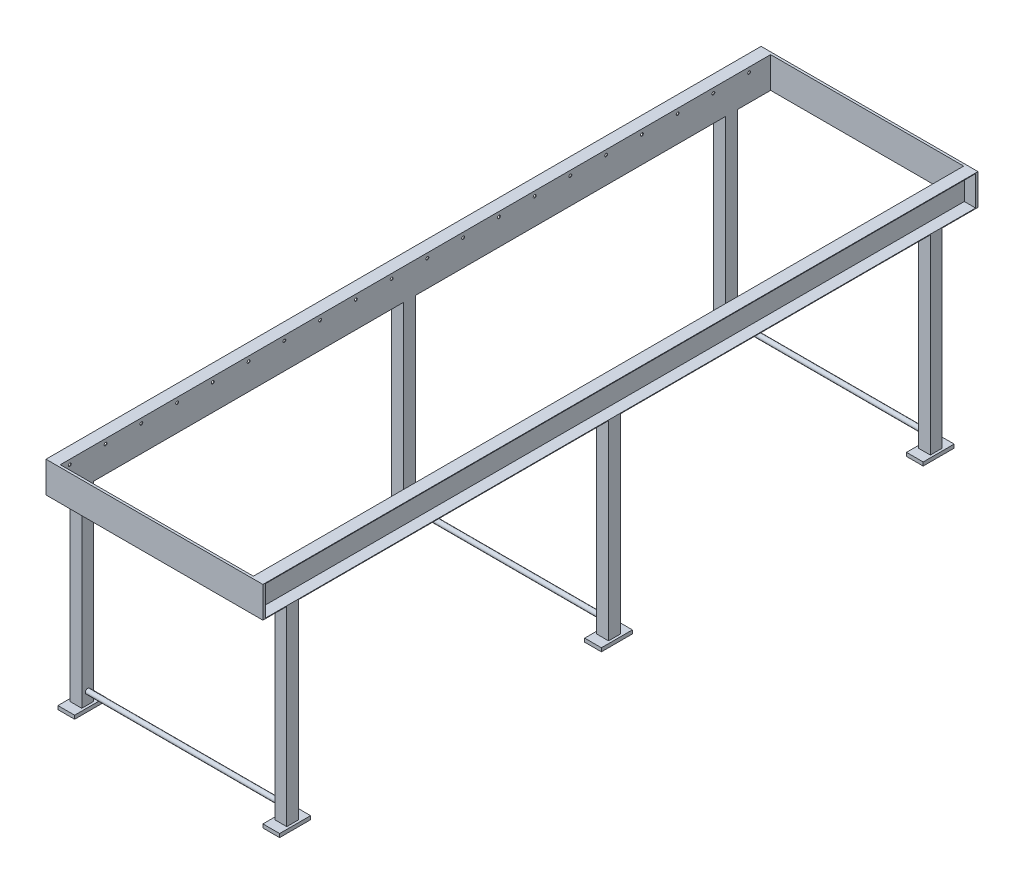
ISO-10303-21;
HEADER;
FILE_DESCRIPTION(('STEP AP214'),'2;1');
FILE_NAME('part.step','',(''),(''),'','','');
FILE_SCHEMA(('AUTOMOTIVE_DESIGN { 1 0 10303 214 1 1 1 1 }'));
ENDSEC;
DATA;
#1=APPLICATION_CONTEXT('core data for automotive mechanical design processes');
#2=APPLICATION_PROTOCOL_DEFINITION('international standard','automotive_design',2000,#1);
#3=PRODUCT_CONTEXT('',#1,'mechanical');
#4=PRODUCT('Part','Part','',(#3));
#5=PRODUCT_RELATED_PRODUCT_CATEGORY('part','',(#4));
#6=PRODUCT_DEFINITION_FORMATION('','',#4);
#7=PRODUCT_DEFINITION_CONTEXT('part definition',#1,'design');
#8=PRODUCT_DEFINITION('design','',#6,#7);
#9=PRODUCT_DEFINITION_SHAPE('','',#8);
#10=(LENGTH_UNIT() NAMED_UNIT(*) SI_UNIT(.MILLI.,.METRE.));
#11=(NAMED_UNIT(*) PLANE_ANGLE_UNIT() SI_UNIT($,.RADIAN.));
#12=(NAMED_UNIT(*) SI_UNIT($,.STERADIAN.) SOLID_ANGLE_UNIT());
#13=UNCERTAINTY_MEASURE_WITH_UNIT(LENGTH_MEASURE(1.E-05),#10,'distance_accuracy_value','');
#14=(GEOMETRIC_REPRESENTATION_CONTEXT(3) GLOBAL_UNCERTAINTY_ASSIGNED_CONTEXT((#13)) GLOBAL_UNIT_ASSIGNED_CONTEXT((#10,
#11,#12)) REPRESENTATION_CONTEXT('',''));
#15=CARTESIAN_POINT('',(0.,0.,0.));
#16=DIRECTION('',(0.,0.,1.));
#17=DIRECTION('',(1.,0.,0.));
#18=AXIS2_PLACEMENT_3D('',#15,#16,#17);
#19=CARTESIAN_POINT('',(405.,0.,-2979.99999999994));
#20=DIRECTION('',(1.,0.,0.));
#21=DIRECTION('',(0.,0.,-1.));
#22=AXIS2_PLACEMENT_3D('',#19,#20,#21);
#23=PLANE('',#22);
#24=CARTESIAN_POINT('',(405.,110.,-190.));
#25=DIRECTION('',(1.,0.,0.));
#26=DIRECTION('',(0.,0.,-1.));
#27=AXIS2_PLACEMENT_3D('',#24,#25,#26);
#28=CIRCLE('',#27,6.00000000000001);
#29=CARTESIAN_POINT('',(405.,110.,-196.));
#30=VERTEX_POINT('',#29);
#31=EDGE_CURVE('E2232',#30,#30,#28,.T.);
#32=ORIENTED_EDGE('',*,*,#31,.T.);
#33=EDGE_LOOP('',(#32));
#34=FACE_BOUND('',#33,.T.);
#35=CARTESIAN_POINT('',(405.,110.,-40.));
#36=DIRECTION('',(1.,0.,0.));
#37=DIRECTION('',(0.,0.,-1.));
#38=AXIS2_PLACEMENT_3D('',#35,#36,#37);
#39=CIRCLE('',#38,6.00000000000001);
#40=CARTESIAN_POINT('',(405.,110.,-46.));
#41=VERTEX_POINT('',#40);
#42=EDGE_CURVE('E624',#41,#41,#39,.T.);
#43=ORIENTED_EDGE('',*,*,#42,.T.);
#44=EDGE_LOOP('',(#43));
#45=FACE_BOUND('',#44,.T.);
#46=CARTESIAN_POINT('',(405.,-750.,-1465.));
#47=DIRECTION('',(1.,0.,0.));
#48=DIRECTION('',(0.,0.,-1.));
#49=AXIS2_PLACEMENT_3D('',#46,#47,#48);
#50=CIRCLE('',#49,10.);
#51=CARTESIAN_POINT('',(405.,-750.,-1475.));
#52=VERTEX_POINT('',#51);
#53=EDGE_CURVE('E1450',#52,#52,#50,.F.);
#54=ORIENTED_EDGE('',*,*,#53,.F.);
#55=EDGE_LOOP('',(#54));
#56=FACE_BOUND('',#55,.T.);
#57=DIRECTION('',(0.,1.,0.));
#58=VECTOR('',#57,1.);
#59=CARTESIAN_POINT('',(405.,0.,5.6843418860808E-11));
#60=LINE('',#59,#58);
#61=CARTESIAN_POINT('',(405.,0.,0.));
#62=VERTEX_POINT('',#61);
#63=CARTESIAN_POINT('',(405.,130.,5.6843418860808E-11));
#64=VERTEX_POINT('',#63);
#65=EDGE_CURVE('E1293',#62,#64,#60,.T.);
#66=ORIENTED_EDGE('',*,*,#65,.T.);
#67=DIRECTION('',(0.,0.,1.));
#68=VECTOR('',#67,1.);
#69=CARTESIAN_POINT('',(405.,130.,-2979.99999999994));
#70=LINE('',#69,#68);
#71=CARTESIAN_POINT('',(405.,130.,-2979.99999999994));
#72=VERTEX_POINT('',#71);
#73=EDGE_CURVE('E1203',#72,#64,#70,.T.);
#74=ORIENTED_EDGE('',*,*,#73,.F.);
#75=DIRECTION('',(0.,1.,0.));
#76=VECTOR('',#75,1.);
#77=CARTESIAN_POINT('',(405.,0.,-2979.99999999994));
#78=LINE('',#77,#76);
#79=CARTESIAN_POINT('',(405.,0.,-2979.99999999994));
#80=VERTEX_POINT('',#79);
#81=EDGE_CURVE('E1328',#80,#72,#78,.T.);
#82=ORIENTED_EDGE('',*,*,#81,.F.);
#83=DIRECTION('',(0.,0.,1.));
#84=VECTOR('',#83,1.);
#85=CARTESIAN_POINT('',(405.,0.,-2979.99999999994));
#86=LINE('',#85,#84);
#87=CARTESIAN_POINT('',(405.,1.16542199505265E-13,-2840.));
#88=VERTEX_POINT('',#87);
#89=EDGE_CURVE('E1209',#80,#88,#86,.T.);
#90=ORIENTED_EDGE('',*,*,#89,.T.);
#91=DIRECTION('',(0.,1.,0.));
#92=VECTOR('',#91,1.);
#93=CARTESIAN_POINT('',(405.,-800.,-2840.));
#94=LINE('',#93,#92);
#95=CARTESIAN_POINT('',(405.,-800.,-2840.));
#96=VERTEX_POINT('',#95);
#97=EDGE_CURVE('E840',#96,#88,#94,.T.);
#98=ORIENTED_EDGE('',*,*,#97,.F.);
#99=DIRECTION('',(0.,0.,-1.));
#100=VECTOR('',#99,1.);
#101=CARTESIAN_POINT('',(405.,-800.,-2790.));
#102=LINE('',#101,#100);
#103=CARTESIAN_POINT('',(405.,-800.,-2790.));
#104=VERTEX_POINT('',#103);
#105=EDGE_CURVE('E820',#104,#96,#102,.T.);
#106=ORIENTED_EDGE('',*,*,#105,.F.);
#107=DIRECTION('',(0.,1.,0.));
#108=VECTOR('',#107,1.);
#109=CARTESIAN_POINT('',(405.,-800.,-2790.));
#110=LINE('',#109,#108);
#111=CARTESIAN_POINT('',(405.,0.,-2790.));
#112=VERTEX_POINT('',#111);
#113=EDGE_CURVE('E61',#104,#112,#110,.T.);
#114=ORIENTED_EDGE('',*,*,#113,.T.);
#115=CARTESIAN_POINT('',(405.,0.,-1490.));
#116=VERTEX_POINT('',#115);
#117=EDGE_CURVE('E1220',#112,#116,#86,.T.);
#118=ORIENTED_EDGE('',*,*,#117,.T.);
#119=DIRECTION('',(0.,1.,0.));
#120=VECTOR('',#119,1.);
#121=CARTESIAN_POINT('',(405.,-800.,-1490.));
#122=LINE('',#121,#120);
#123=CARTESIAN_POINT('',(405.,-800.,-1490.));
#124=VERTEX_POINT('',#123);
#125=EDGE_CURVE('E962',#124,#116,#122,.T.);
#126=ORIENTED_EDGE('',*,*,#125,.F.);
#127=DIRECTION('',(0.,0.,-1.));
#128=VECTOR('',#127,1.);
#129=CARTESIAN_POINT('',(405.,-800.,-1440.));
#130=LINE('',#129,#128);
#131=CARTESIAN_POINT('',(405.,-800.,-1440.));
#132=VERTEX_POINT('',#131);
#133=EDGE_CURVE('E939',#132,#124,#130,.T.);
#134=ORIENTED_EDGE('',*,*,#133,.F.);
#135=DIRECTION('',(0.,1.,0.));
#136=VECTOR('',#135,1.);
#137=CARTESIAN_POINT('',(405.,-800.,-1440.));
#138=LINE('',#137,#136);
#139=CARTESIAN_POINT('',(405.,0.,-1440.));
#140=VERTEX_POINT('',#139);
#141=EDGE_CURVE('E952',#132,#140,#138,.T.);
#142=ORIENTED_EDGE('',*,*,#141,.T.);
#143=CARTESIAN_POINT('',(405.,0.,-140.));
#144=VERTEX_POINT('',#143);
#145=EDGE_CURVE('E1202',#140,#144,#86,.T.);
#146=ORIENTED_EDGE('',*,*,#145,.T.);
#147=DIRECTION('',(0.,1.,0.));
#148=VECTOR('',#147,1.);
#149=CARTESIAN_POINT('',(405.,-800.,-140.));
#150=LINE('',#149,#148);
#151=CARTESIAN_POINT('',(405.,-800.,-140.));
#152=VERTEX_POINT('',#151);
#153=EDGE_CURVE('E1085',#152,#144,#150,.T.);
#154=ORIENTED_EDGE('',*,*,#153,.F.);
#155=DIRECTION('',(0.,0.,-1.));
#156=VECTOR('',#155,1.);
#157=CARTESIAN_POINT('',(405.,-800.,-90.));
#158=LINE('',#157,#156);
#159=CARTESIAN_POINT('',(405.,-800.,-90.));
#160=VERTEX_POINT('',#159);
#161=EDGE_CURVE('E1062',#160,#152,#158,.T.);
#162=ORIENTED_EDGE('',*,*,#161,.F.);
#163=DIRECTION('',(0.,1.,0.));
#164=VECTOR('',#163,1.);
#165=CARTESIAN_POINT('',(405.,-800.,-90.));
#166=LINE('',#165,#164);
#167=CARTESIAN_POINT('',(405.,0.,-89.9999999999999));
#168=VERTEX_POINT('',#167);
#169=EDGE_CURVE('E1075',#160,#168,#166,.T.);
#170=ORIENTED_EDGE('',*,*,#169,.T.);
#171=EDGE_CURVE('E1199',#168,#62,#86,.T.);
#172=ORIENTED_EDGE('',*,*,#171,.T.);
#173=EDGE_LOOP('',(#66,#74,#82,#90,#98,#106,#114,#118,#126,#134,#142,#146,#154,#162,#170,#172));
#174=FACE_BOUND('',#173,.T.);
#175=CARTESIAN_POINT('',(405.,-750.,-115.));
#176=DIRECTION('',(1.,0.,0.));
#177=DIRECTION('',(0.,0.,-1.));
#178=AXIS2_PLACEMENT_3D('',#175,#176,#177);
#179=CIRCLE('',#178,10.);
#180=CARTESIAN_POINT('',(405.,-750.,-125.));
#181=VERTEX_POINT('',#180);
#182=EDGE_CURVE('E1444',#181,#181,#179,.F.);
#183=ORIENTED_EDGE('',*,*,#182,.F.);
#184=EDGE_LOOP('',(#183));
#185=FACE_BOUND('',#184,.T.);
#186=CARTESIAN_POINT('',(405.,-750.,-2815.));
#187=DIRECTION('',(1.,0.,0.));
#188=DIRECTION('',(0.,0.,-1.));
#189=AXIS2_PLACEMENT_3D('',#186,#187,#188);
#190=CIRCLE('',#189,10.);
#191=CARTESIAN_POINT('',(405.,-750.,-2825.));
#192=VERTEX_POINT('',#191);
#193=EDGE_CURVE('E1456',#192,#192,#190,.F.);
#194=ORIENTED_EDGE('',*,*,#193,.F.);
#195=EDGE_LOOP('',(#194));
#196=FACE_BOUND('',#195,.T.);
#197=CARTESIAN_POINT('',(405.,110.,-340.));
#198=DIRECTION('',(1.,0.,0.));
#199=DIRECTION('',(0.,0.,-1.));
#200=AXIS2_PLACEMENT_3D('',#197,#198,#199);
#201=CIRCLE('',#200,6.00000000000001);
#202=CARTESIAN_POINT('',(405.,110.,-346.));
#203=VERTEX_POINT('',#202);
#204=EDGE_CURVE('E1467',#203,#203,#201,.T.);
#205=ORIENTED_EDGE('',*,*,#204,.T.);
#206=EDGE_LOOP('',(#205));
#207=FACE_BOUND('',#206,.T.);
#208=CARTESIAN_POINT('',(405.,110.,-490.));
#209=DIRECTION('',(1.,0.,0.));
#210=DIRECTION('',(0.,0.,-1.));
#211=AXIS2_PLACEMENT_3D('',#208,#209,#210);
#212=CIRCLE('',#211,6.00000000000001);
#213=CARTESIAN_POINT('',(405.,110.,-496.));
#214=VERTEX_POINT('',#213);
#215=EDGE_CURVE('E1473',#214,#214,#212,.T.);
#216=ORIENTED_EDGE('',*,*,#215,.T.);
#217=EDGE_LOOP('',(#216));
#218=FACE_BOUND('',#217,.T.);
#219=CARTESIAN_POINT('',(405.,110.,-640.));
#220=DIRECTION('',(1.,0.,0.));
#221=DIRECTION('',(0.,0.,-1.));
#222=AXIS2_PLACEMENT_3D('',#219,#220,#221);
#223=CIRCLE('',#222,6.00000000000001);
#224=CARTESIAN_POINT('',(405.,110.,-646.));
#225=VERTEX_POINT('',#224);
#226=EDGE_CURVE('E1479',#225,#225,#223,.T.);
#227=ORIENTED_EDGE('',*,*,#226,.T.);
#228=EDGE_LOOP('',(#227));
#229=FACE_BOUND('',#228,.T.);
#230=CARTESIAN_POINT('',(405.,110.,-790.));
#231=DIRECTION('',(1.,0.,0.));
#232=DIRECTION('',(0.,0.,-1.));
#233=AXIS2_PLACEMENT_3D('',#230,#231,#232);
#234=CIRCLE('',#233,6.00000000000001);
#235=CARTESIAN_POINT('',(405.,110.,-796.));
#236=VERTEX_POINT('',#235);
#237=EDGE_CURVE('E1485',#236,#236,#234,.T.);
#238=ORIENTED_EDGE('',*,*,#237,.T.);
#239=EDGE_LOOP('',(#238));
#240=FACE_BOUND('',#239,.T.);
#241=CARTESIAN_POINT('',(405.,110.,-940.));
#242=DIRECTION('',(1.,0.,0.));
#243=DIRECTION('',(0.,0.,-1.));
#244=AXIS2_PLACEMENT_3D('',#241,#242,#243);
#245=CIRCLE('',#244,6.00000000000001);
#246=CARTESIAN_POINT('',(405.,110.,-946.));
#247=VERTEX_POINT('',#246);
#248=EDGE_CURVE('E1491',#247,#247,#245,.T.);
#249=ORIENTED_EDGE('',*,*,#248,.T.);
#250=EDGE_LOOP('',(#249));
#251=FACE_BOUND('',#250,.T.);
#252=CARTESIAN_POINT('',(405.,110.,-1090.));
#253=DIRECTION('',(1.,0.,0.));
#254=DIRECTION('',(0.,0.,-1.));
#255=AXIS2_PLACEMENT_3D('',#252,#253,#254);
#256=CIRCLE('',#255,6.00000000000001);
#257=CARTESIAN_POINT('',(405.,110.,-1096.));
#258=VERTEX_POINT('',#257);
#259=EDGE_CURVE('E1497',#258,#258,#256,.T.);
#260=ORIENTED_EDGE('',*,*,#259,.T.);
#261=EDGE_LOOP('',(#260));
#262=FACE_BOUND('',#261,.T.);
#263=CARTESIAN_POINT('',(405.,110.,-1240.));
#264=DIRECTION('',(1.,0.,0.));
#265=DIRECTION('',(0.,0.,-1.));
#266=AXIS2_PLACEMENT_3D('',#263,#264,#265);
#267=CIRCLE('',#266,6.00000000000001);
#268=CARTESIAN_POINT('',(405.,110.,-1246.));
#269=VERTEX_POINT('',#268);
#270=EDGE_CURVE('E1503',#269,#269,#267,.T.);
#271=ORIENTED_EDGE('',*,*,#270,.T.);
#272=EDGE_LOOP('',(#271));
#273=FACE_BOUND('',#272,.T.);
#274=CARTESIAN_POINT('',(405.,110.,-1390.));
#275=DIRECTION('',(1.,0.,0.));
#276=DIRECTION('',(0.,0.,-1.));
#277=AXIS2_PLACEMENT_3D('',#274,#275,#276);
#278=CIRCLE('',#277,6.00000000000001);
#279=CARTESIAN_POINT('',(405.,110.,-1396.));
#280=VERTEX_POINT('',#279);
#281=EDGE_CURVE('E1509',#280,#280,#278,.T.);
#282=ORIENTED_EDGE('',*,*,#281,.T.);
#283=EDGE_LOOP('',(#282));
#284=FACE_BOUND('',#283,.T.);
#285=CARTESIAN_POINT('',(405.,110.,-1540.));
#286=DIRECTION('',(1.,0.,0.));
#287=DIRECTION('',(0.,0.,-1.));
#288=AXIS2_PLACEMENT_3D('',#285,#286,#287);
#289=CIRCLE('',#288,6.00000000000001);
#290=CARTESIAN_POINT('',(405.,110.,-1546.));
#291=VERTEX_POINT('',#290);
#292=EDGE_CURVE('E1515',#291,#291,#289,.T.);
#293=ORIENTED_EDGE('',*,*,#292,.T.);
#294=EDGE_LOOP('',(#293));
#295=FACE_BOUND('',#294,.T.);
#296=CARTESIAN_POINT('',(405.,110.,-1690.));
#297=DIRECTION('',(1.,0.,0.));
#298=DIRECTION('',(0.,0.,-1.));
#299=AXIS2_PLACEMENT_3D('',#296,#297,#298);
#300=CIRCLE('',#299,6.00000000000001);
#301=CARTESIAN_POINT('',(405.,110.,-1696.));
#302=VERTEX_POINT('',#301);
#303=EDGE_CURVE('E1521',#302,#302,#300,.T.);
#304=ORIENTED_EDGE('',*,*,#303,.T.);
#305=EDGE_LOOP('',(#304));
#306=FACE_BOUND('',#305,.T.);
#307=CARTESIAN_POINT('',(405.,110.,-1840.));
#308=DIRECTION('',(1.,0.,0.));
#309=DIRECTION('',(0.,0.,-1.));
#310=AXIS2_PLACEMENT_3D('',#307,#308,#309);
#311=CIRCLE('',#310,6.00000000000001);
#312=CARTESIAN_POINT('',(405.,110.,-1846.));
#313=VERTEX_POINT('',#312);
#314=EDGE_CURVE('E1528',#313,#313,#311,.T.);
#315=ORIENTED_EDGE('',*,*,#314,.T.);
#316=EDGE_LOOP('',(#315));
#317=FACE_BOUND('',#316,.T.);
#318=CARTESIAN_POINT('',(405.,110.,-1990.));
#319=DIRECTION('',(1.,0.,0.));
#320=DIRECTION('',(0.,0.,-1.));
#321=AXIS2_PLACEMENT_3D('',#318,#319,#320);
#322=CIRCLE('',#321,6.00000000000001);
#323=CARTESIAN_POINT('',(405.,110.,-1996.));
#324=VERTEX_POINT('',#323);
#325=EDGE_CURVE('E1535',#324,#324,#322,.T.);
#326=ORIENTED_EDGE('',*,*,#325,.T.);
#327=EDGE_LOOP('',(#326));
#328=FACE_BOUND('',#327,.T.);
#329=CARTESIAN_POINT('',(405.,110.,-2140.));
#330=DIRECTION('',(1.,0.,0.));
#331=DIRECTION('',(0.,0.,-1.));
#332=AXIS2_PLACEMENT_3D('',#329,#330,#331);
#333=CIRCLE('',#332,6.00000000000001);
#334=CARTESIAN_POINT('',(405.,110.,-2146.));
#335=VERTEX_POINT('',#334);
#336=EDGE_CURVE('E1542',#335,#335,#333,.T.);
#337=ORIENTED_EDGE('',*,*,#336,.T.);
#338=EDGE_LOOP('',(#337));
#339=FACE_BOUND('',#338,.T.);
#340=CARTESIAN_POINT('',(405.,110.,-2290.));
#341=DIRECTION('',(1.,0.,0.));
#342=DIRECTION('',(0.,0.,-1.));
#343=AXIS2_PLACEMENT_3D('',#340,#341,#342);
#344=CIRCLE('',#343,6.00000000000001);
#345=CARTESIAN_POINT('',(405.,110.,-2296.));
#346=VERTEX_POINT('',#345);
#347=EDGE_CURVE('E1549',#346,#346,#344,.T.);
#348=ORIENTED_EDGE('',*,*,#347,.T.);
#349=EDGE_LOOP('',(#348));
#350=FACE_BOUND('',#349,.T.);
#351=CARTESIAN_POINT('',(405.,110.,-2440.));
#352=DIRECTION('',(1.,0.,0.));
#353=DIRECTION('',(0.,0.,-1.));
#354=AXIS2_PLACEMENT_3D('',#351,#352,#353);
#355=CIRCLE('',#354,6.00000000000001);
#356=CARTESIAN_POINT('',(405.,110.,-2446.));
#357=VERTEX_POINT('',#356);
#358=EDGE_CURVE('E1557',#357,#357,#355,.T.);
#359=ORIENTED_EDGE('',*,*,#358,.T.);
#360=EDGE_LOOP('',(#359));
#361=FACE_BOUND('',#360,.T.);
#362=CARTESIAN_POINT('',(405.,110.,-2590.));
#363=DIRECTION('',(1.,0.,0.));
#364=DIRECTION('',(0.,0.,-1.));
#365=AXIS2_PLACEMENT_3D('',#362,#363,#364);
#366=CIRCLE('',#365,6.00000000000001);
#367=CARTESIAN_POINT('',(405.,110.,-2596.));
#368=VERTEX_POINT('',#367);
#369=EDGE_CURVE('E1565',#368,#368,#366,.T.);
#370=ORIENTED_EDGE('',*,*,#369,.T.);
#371=EDGE_LOOP('',(#370));
#372=FACE_BOUND('',#371,.T.);
#373=CARTESIAN_POINT('',(405.,110.,-2740.));
#374=DIRECTION('',(1.,0.,0.));
#375=DIRECTION('',(0.,0.,-1.));
#376=AXIS2_PLACEMENT_3D('',#373,#374,#375);
#377=CIRCLE('',#376,6.00000000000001);
#378=CARTESIAN_POINT('',(405.,110.,-2746.));
#379=VERTEX_POINT('',#378);
#380=EDGE_CURVE('E1573',#379,#379,#377,.T.);
#381=ORIENTED_EDGE('',*,*,#380,.T.);
#382=EDGE_LOOP('',(#381));
#383=FACE_BOUND('',#382,.T.);
#384=CARTESIAN_POINT('',(405.,110.,-2890.));
#385=DIRECTION('',(1.,0.,0.));
#386=DIRECTION('',(0.,0.,-1.));
#387=AXIS2_PLACEMENT_3D('',#384,#385,#386);
#388=CIRCLE('',#387,6.00000000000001);
#389=CARTESIAN_POINT('',(405.,110.,-2896.));
#390=VERTEX_POINT('',#389);
#391=EDGE_CURVE('E1580',#390,#390,#388,.T.);
#392=ORIENTED_EDGE('',*,*,#391,.T.);
#393=EDGE_LOOP('',(#392));
#394=FACE_BOUND('',#393,.T.);
#395=ADVANCED_FACE('F37',(#34,#45,#56,#174,#185,#196,#207,#218,#229,#240,#251,#262,#273,#284,
#295,#306,#317,#328,#339,#350,#361,#372,#383,#394),#23,.F.);
#396=CARTESIAN_POINT('',(-405.,0.,-2979.99999999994));
#397=DIRECTION('',(-1.,0.,0.));
#398=DIRECTION('',(0.,0.,1.));
#399=AXIS2_PLACEMENT_3D('',#396,#397,#398);
#400=PLANE('',#399);
#401=CARTESIAN_POINT('',(-405.,110.,-190.));
#402=DIRECTION('',(-1.,0.,0.));
#403=DIRECTION('',(0.,0.,1.));
#404=AXIS2_PLACEMENT_3D('',#401,#402,#403);
#405=CIRCLE('',#404,6.00000000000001);
#406=CARTESIAN_POINT('',(-405.,110.,-184.));
#407=VERTEX_POINT('',#406);
#408=EDGE_CURVE('E2228',#407,#407,#405,.T.);
#409=ORIENTED_EDGE('',*,*,#408,.T.);
#410=EDGE_LOOP('',(#409));
#411=FACE_BOUND('',#410,.T.);
#412=CARTESIAN_POINT('',(-405.,110.,-40.));
#413=DIRECTION('',(-1.,0.,0.));
#414=DIRECTION('',(0.,0.,1.));
#415=AXIS2_PLACEMENT_3D('',#412,#413,#414);
#416=CIRCLE('',#415,6.00000000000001);
#417=CARTESIAN_POINT('',(-405.,110.,-34.));
#418=VERTEX_POINT('',#417);
#419=EDGE_CURVE('E1463',#418,#418,#416,.T.);
#420=ORIENTED_EDGE('',*,*,#419,.T.);
#421=EDGE_LOOP('',(#420));
#422=FACE_BOUND('',#421,.T.);
#423=CARTESIAN_POINT('',(-405.,-750.,-1465.));
#424=DIRECTION('',(-1.,0.,0.));
#425=DIRECTION('',(0.,0.,1.));
#426=AXIS2_PLACEMENT_3D('',#423,#424,#425);
#427=CIRCLE('',#426,10.);
#428=CARTESIAN_POINT('',(-405.,-750.,-1455.));
#429=VERTEX_POINT('',#428);
#430=EDGE_CURVE('E1447',#429,#429,#427,.F.);
#431=ORIENTED_EDGE('',*,*,#430,.F.);
#432=EDGE_LOOP('',(#431));
#433=FACE_BOUND('',#432,.T.);
#434=DIRECTION('',(0.,-1.,0.));
#435=VECTOR('',#434,1.);
#436=CARTESIAN_POINT('',(-405.,0.,5.6843418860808E-11));
#437=LINE('',#436,#435);
#438=CARTESIAN_POINT('',(-405.,130.,5.6843418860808E-11));
#439=VERTEX_POINT('',#438);
#440=CARTESIAN_POINT('',(-405.,0.,5.6843418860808E-11));
#441=VERTEX_POINT('',#440);
#442=EDGE_CURVE('E1351',#439,#441,#437,.T.);
#443=ORIENTED_EDGE('',*,*,#442,.T.);
#444=DIRECTION('',(0.,0.,1.));
#445=VECTOR('',#444,1.);
#446=CARTESIAN_POINT('',(-405.,0.,-2979.99999999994));
#447=LINE('',#446,#445);
#448=CARTESIAN_POINT('',(-405.,0.,-89.9999999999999));
#449=VERTEX_POINT('',#448);
#450=EDGE_CURVE('E1174',#449,#441,#447,.T.);
#451=ORIENTED_EDGE('',*,*,#450,.F.);
#452=DIRECTION('',(0.,1.,0.));
#453=VECTOR('',#452,1.);
#454=CARTESIAN_POINT('',(-405.,-800.,-90.));
#455=LINE('',#454,#453);
#456=CARTESIAN_POINT('',(-405.,-800.,-90.));
#457=VERTEX_POINT('',#456);
#458=EDGE_CURVE('E1181',#457,#449,#455,.T.);
#459=ORIENTED_EDGE('',*,*,#458,.F.);
#460=DIRECTION('',(0.,0.,1.));
#461=VECTOR('',#460,1.);
#462=CARTESIAN_POINT('',(-405.,-800.,-90.));
#463=LINE('',#462,#461);
#464=CARTESIAN_POINT('',(-405.,-800.,-140.));
#465=VERTEX_POINT('',#464);
#466=EDGE_CURVE('E1159',#465,#457,#463,.T.);
#467=ORIENTED_EDGE('',*,*,#466,.F.);
#468=DIRECTION('',(0.,1.,0.));
#469=VECTOR('',#468,1.);
#470=CARTESIAN_POINT('',(-405.,-800.,-140.));
#471=LINE('',#470,#469);
#472=CARTESIAN_POINT('',(-405.,0.,-140.));
#473=VERTEX_POINT('',#472);
#474=EDGE_CURVE('E1177',#465,#473,#471,.T.);
#475=ORIENTED_EDGE('',*,*,#474,.T.);
#476=CARTESIAN_POINT('',(-405.,0.,-1440.));
#477=VERTEX_POINT('',#476);
#478=EDGE_CURVE('E1204',#477,#473,#447,.T.);
#479=ORIENTED_EDGE('',*,*,#478,.F.);
#480=DIRECTION('',(0.,1.,0.));
#481=VECTOR('',#480,1.);
#482=CARTESIAN_POINT('',(-405.,-800.,-1440.));
#483=LINE('',#482,#481);
#484=CARTESIAN_POINT('',(-405.,-800.,-1440.));
#485=VERTEX_POINT('',#484);
#486=EDGE_CURVE('E1019',#485,#477,#483,.T.);
#487=ORIENTED_EDGE('',*,*,#486,.F.);
#488=DIRECTION('',(0.,0.,1.));
#489=VECTOR('',#488,1.);
#490=CARTESIAN_POINT('',(-405.,-800.,-1440.));
#491=LINE('',#490,#489);
#492=CARTESIAN_POINT('',(-405.,-800.,-1490.));
#493=VERTEX_POINT('',#492);
#494=EDGE_CURVE('E1006',#493,#485,#491,.T.);
#495=ORIENTED_EDGE('',*,*,#494,.F.);
#496=DIRECTION('',(0.,1.,0.));
#497=VECTOR('',#496,1.);
#498=CARTESIAN_POINT('',(-405.,-800.,-1490.));
#499=LINE('',#498,#497);
#500=CARTESIAN_POINT('',(-405.,0.,-1490.));
#501=VERTEX_POINT('',#500);
#502=EDGE_CURVE('E1022',#493,#501,#499,.T.);
#503=ORIENTED_EDGE('',*,*,#502,.T.);
#504=CARTESIAN_POINT('',(-405.,0.,-2790.));
#505=VERTEX_POINT('',#504);
#506=EDGE_CURVE('E1223',#505,#501,#447,.T.);
#507=ORIENTED_EDGE('',*,*,#506,.F.);
#508=DIRECTION('',(0.,1.,0.));
#509=VECTOR('',#508,1.);
#510=CARTESIAN_POINT('',(-405.,-800.,-2790.));
#511=LINE('',#510,#509);
#512=CARTESIAN_POINT('',(-405.,-800.,-2790.));
#513=VERTEX_POINT('',#512);
#514=EDGE_CURVE('E896',#513,#505,#511,.T.);
#515=ORIENTED_EDGE('',*,*,#514,.F.);
#516=DIRECTION('',(0.,0.,1.));
#517=VECTOR('',#516,1.);
#518=CARTESIAN_POINT('',(-405.,-800.,-2790.));
#519=LINE('',#518,#517);
#520=CARTESIAN_POINT('',(-405.,-800.,-2840.));
#521=VERTEX_POINT('',#520);
#522=EDGE_CURVE('E883',#521,#513,#519,.T.);
#523=ORIENTED_EDGE('',*,*,#522,.F.);
#524=DIRECTION('',(0.,1.,0.));
#525=VECTOR('',#524,1.);
#526=CARTESIAN_POINT('',(-405.,-800.,-2840.));
#527=LINE('',#526,#525);
#528=CARTESIAN_POINT('',(-405.,0.,-2840.));
#529=VERTEX_POINT('',#528);
#530=EDGE_CURVE('E899',#521,#529,#527,.T.);
#531=ORIENTED_EDGE('',*,*,#530,.T.);
#532=CARTESIAN_POINT('',(-405.,0.,-2979.99999999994));
#533=VERTEX_POINT('',#532);
#534=EDGE_CURVE('E1225',#533,#529,#447,.T.);
#535=ORIENTED_EDGE('',*,*,#534,.F.);
#536=DIRECTION('',(0.,-1.,0.));
#537=VECTOR('',#536,1.);
#538=CARTESIAN_POINT('',(-405.,0.,-2979.99999999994));
#539=LINE('',#538,#537);
#540=CARTESIAN_POINT('',(-405.,130.,-2979.99999999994));
#541=VERTEX_POINT('',#540);
#542=EDGE_CURVE('E1353',#541,#533,#539,.T.);
#543=ORIENTED_EDGE('',*,*,#542,.F.);
#544=DIRECTION('',(0.,0.,1.));
#545=VECTOR('',#544,1.);
#546=CARTESIAN_POINT('',(-405.,130.,-2979.99999999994));
#547=LINE('',#546,#545);
#548=EDGE_CURVE('E1232',#541,#439,#547,.T.);
#549=ORIENTED_EDGE('',*,*,#548,.T.);
#550=EDGE_LOOP('',(#443,#451,#459,#467,#475,#479,#487,#495,#503,#507,#515,#523,#531,#535,#543,#549));
#551=FACE_BOUND('',#550,.T.);
#552=CARTESIAN_POINT('',(-405.,-750.,-115.));
#553=DIRECTION('',(-1.,0.,0.));
#554=DIRECTION('',(0.,0.,1.));
#555=AXIS2_PLACEMENT_3D('',#552,#553,#554);
#556=CIRCLE('',#555,10.);
#557=CARTESIAN_POINT('',(-405.,-750.,-105.));
#558=VERTEX_POINT('',#557);
#559=EDGE_CURVE('E1441',#558,#558,#556,.F.);
#560=ORIENTED_EDGE('',*,*,#559,.F.);
#561=EDGE_LOOP('',(#560));
#562=FACE_BOUND('',#561,.T.);
#563=CARTESIAN_POINT('',(-405.,-750.,-2815.));
#564=DIRECTION('',(-1.,0.,0.));
#565=DIRECTION('',(0.,0.,1.));
#566=AXIS2_PLACEMENT_3D('',#563,#564,#565);
#567=CIRCLE('',#566,10.);
#568=CARTESIAN_POINT('',(-405.,-750.,-2805.));
#569=VERTEX_POINT('',#568);
#570=EDGE_CURVE('E1453',#569,#569,#567,.F.);
#571=ORIENTED_EDGE('',*,*,#570,.F.);
#572=EDGE_LOOP('',(#571));
#573=FACE_BOUND('',#572,.T.);
#574=CARTESIAN_POINT('',(-405.,110.,-340.));
#575=DIRECTION('',(-1.,0.,0.));
#576=DIRECTION('',(0.,0.,1.));
#577=AXIS2_PLACEMENT_3D('',#574,#575,#576);
#578=CIRCLE('',#577,6.00000000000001);
#579=CARTESIAN_POINT('',(-405.,110.,-334.));
#580=VERTEX_POINT('',#579);
#581=EDGE_CURVE('E1586',#580,#580,#578,.T.);
#582=ORIENTED_EDGE('',*,*,#581,.T.);
#583=EDGE_LOOP('',(#582));
#584=FACE_BOUND('',#583,.T.);
#585=CARTESIAN_POINT('',(-405.,110.,-490.));
#586=DIRECTION('',(-1.,0.,0.));
#587=DIRECTION('',(0.,0.,1.));
#588=AXIS2_PLACEMENT_3D('',#585,#586,#587);
#589=CIRCLE('',#588,6.00000000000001);
#590=CARTESIAN_POINT('',(-405.,110.,-484.));
#591=VERTEX_POINT('',#590);
#592=EDGE_CURVE('E1592',#591,#591,#589,.T.);
#593=ORIENTED_EDGE('',*,*,#592,.T.);
#594=EDGE_LOOP('',(#593));
#595=FACE_BOUND('',#594,.T.);
#596=CARTESIAN_POINT('',(-405.,110.,-640.));
#597=DIRECTION('',(-1.,0.,0.));
#598=DIRECTION('',(0.,0.,1.));
#599=AXIS2_PLACEMENT_3D('',#596,#597,#598);
#600=CIRCLE('',#599,6.00000000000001);
#601=CARTESIAN_POINT('',(-405.,110.,-634.));
#602=VERTEX_POINT('',#601);
#603=EDGE_CURVE('E1598',#602,#602,#600,.T.);
#604=ORIENTED_EDGE('',*,*,#603,.T.);
#605=EDGE_LOOP('',(#604));
#606=FACE_BOUND('',#605,.T.);
#607=CARTESIAN_POINT('',(-405.,110.,-790.));
#608=DIRECTION('',(-1.,0.,0.));
#609=DIRECTION('',(0.,0.,1.));
#610=AXIS2_PLACEMENT_3D('',#607,#608,#609);
#611=CIRCLE('',#610,6.00000000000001);
#612=CARTESIAN_POINT('',(-405.,110.,-784.));
#613=VERTEX_POINT('',#612);
#614=EDGE_CURVE('E1604',#613,#613,#611,.T.);
#615=ORIENTED_EDGE('',*,*,#614,.T.);
#616=EDGE_LOOP('',(#615));
#617=FACE_BOUND('',#616,.T.);
#618=CARTESIAN_POINT('',(-405.,110.,-940.));
#619=DIRECTION('',(-1.,0.,0.));
#620=DIRECTION('',(0.,0.,1.));
#621=AXIS2_PLACEMENT_3D('',#618,#619,#620);
#622=CIRCLE('',#621,6.00000000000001);
#623=CARTESIAN_POINT('',(-405.,110.,-934.));
#624=VERTEX_POINT('',#623);
#625=EDGE_CURVE('E1610',#624,#624,#622,.T.);
#626=ORIENTED_EDGE('',*,*,#625,.T.);
#627=EDGE_LOOP('',(#626));
#628=FACE_BOUND('',#627,.T.);
#629=CARTESIAN_POINT('',(-405.,110.,-1090.));
#630=DIRECTION('',(-1.,0.,0.));
#631=DIRECTION('',(0.,0.,1.));
#632=AXIS2_PLACEMENT_3D('',#629,#630,#631);
#633=CIRCLE('',#632,6.00000000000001);
#634=CARTESIAN_POINT('',(-405.,110.,-1084.));
#635=VERTEX_POINT('',#634);
#636=EDGE_CURVE('E1616',#635,#635,#633,.T.);
#637=ORIENTED_EDGE('',*,*,#636,.T.);
#638=EDGE_LOOP('',(#637));
#639=FACE_BOUND('',#638,.T.);
#640=CARTESIAN_POINT('',(-405.,110.,-1240.));
#641=DIRECTION('',(-1.,0.,0.));
#642=DIRECTION('',(0.,0.,1.));
#643=AXIS2_PLACEMENT_3D('',#640,#641,#642);
#644=CIRCLE('',#643,6.00000000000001);
#645=CARTESIAN_POINT('',(-405.,110.,-1234.));
#646=VERTEX_POINT('',#645);
#647=EDGE_CURVE('E1622',#646,#646,#644,.T.);
#648=ORIENTED_EDGE('',*,*,#647,.T.);
#649=EDGE_LOOP('',(#648));
#650=FACE_BOUND('',#649,.T.);
#651=CARTESIAN_POINT('',(-405.,110.,-1390.));
#652=DIRECTION('',(-1.,0.,0.));
#653=DIRECTION('',(0.,0.,1.));
#654=AXIS2_PLACEMENT_3D('',#651,#652,#653);
#655=CIRCLE('',#654,6.00000000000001);
#656=CARTESIAN_POINT('',(-405.,110.,-1384.));
#657=VERTEX_POINT('',#656);
#658=EDGE_CURVE('E1628',#657,#657,#655,.T.);
#659=ORIENTED_EDGE('',*,*,#658,.T.);
#660=EDGE_LOOP('',(#659));
#661=FACE_BOUND('',#660,.T.);
#662=CARTESIAN_POINT('',(-405.,110.,-1540.));
#663=DIRECTION('',(-1.,0.,0.));
#664=DIRECTION('',(0.,0.,1.));
#665=AXIS2_PLACEMENT_3D('',#662,#663,#664);
#666=CIRCLE('',#665,6.00000000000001);
#667=CARTESIAN_POINT('',(-405.,110.,-1534.));
#668=VERTEX_POINT('',#667);
#669=EDGE_CURVE('E1634',#668,#668,#666,.T.);
#670=ORIENTED_EDGE('',*,*,#669,.T.);
#671=EDGE_LOOP('',(#670));
#672=FACE_BOUND('',#671,.T.);
#673=CARTESIAN_POINT('',(-405.,110.,-1690.));
#674=DIRECTION('',(-1.,0.,0.));
#675=DIRECTION('',(0.,0.,1.));
#676=AXIS2_PLACEMENT_3D('',#673,#674,#675);
#677=CIRCLE('',#676,6.00000000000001);
#678=CARTESIAN_POINT('',(-405.,110.,-1684.));
#679=VERTEX_POINT('',#678);
#680=EDGE_CURVE('E1640',#679,#679,#677,.T.);
#681=ORIENTED_EDGE('',*,*,#680,.T.);
#682=EDGE_LOOP('',(#681));
#683=FACE_BOUND('',#682,.T.);
#684=CARTESIAN_POINT('',(-405.,110.,-1840.));
#685=DIRECTION('',(-1.,0.,0.));
#686=DIRECTION('',(0.,0.,1.));
#687=AXIS2_PLACEMENT_3D('',#684,#685,#686);
#688=CIRCLE('',#687,6.00000000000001);
#689=CARTESIAN_POINT('',(-405.,110.,-1834.));
#690=VERTEX_POINT('',#689);
#691=EDGE_CURVE('E1646',#690,#690,#688,.T.);
#692=ORIENTED_EDGE('',*,*,#691,.T.);
#693=EDGE_LOOP('',(#692));
#694=FACE_BOUND('',#693,.T.);
#695=CARTESIAN_POINT('',(-405.,110.,-1990.));
#696=DIRECTION('',(-1.,0.,0.));
#697=DIRECTION('',(0.,0.,1.));
#698=AXIS2_PLACEMENT_3D('',#695,#696,#697);
#699=CIRCLE('',#698,6.00000000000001);
#700=CARTESIAN_POINT('',(-405.,110.,-1984.));
#701=VERTEX_POINT('',#700);
#702=EDGE_CURVE('E1653',#701,#701,#699,.T.);
#703=ORIENTED_EDGE('',*,*,#702,.T.);
#704=EDGE_LOOP('',(#703));
#705=FACE_BOUND('',#704,.T.);
#706=CARTESIAN_POINT('',(-405.,110.,-2140.));
#707=DIRECTION('',(-1.,0.,0.));
#708=DIRECTION('',(0.,0.,1.));
#709=AXIS2_PLACEMENT_3D('',#706,#707,#708);
#710=CIRCLE('',#709,6.00000000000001);
#711=CARTESIAN_POINT('',(-405.,110.,-2134.));
#712=VERTEX_POINT('',#711);
#713=EDGE_CURVE('E1660',#712,#712,#710,.T.);
#714=ORIENTED_EDGE('',*,*,#713,.T.);
#715=EDGE_LOOP('',(#714));
#716=FACE_BOUND('',#715,.T.);
#717=CARTESIAN_POINT('',(-405.,110.,-2290.));
#718=DIRECTION('',(-1.,0.,0.));
#719=DIRECTION('',(0.,0.,1.));
#720=AXIS2_PLACEMENT_3D('',#717,#718,#719);
#721=CIRCLE('',#720,6.00000000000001);
#722=CARTESIAN_POINT('',(-405.,110.,-2284.));
#723=VERTEX_POINT('',#722);
#724=EDGE_CURVE('E1667',#723,#723,#721,.T.);
#725=ORIENTED_EDGE('',*,*,#724,.T.);
#726=EDGE_LOOP('',(#725));
#727=FACE_BOUND('',#726,.T.);
#728=CARTESIAN_POINT('',(-405.,110.,-2440.));
#729=DIRECTION('',(-1.,0.,0.));
#730=DIRECTION('',(0.,0.,1.));
#731=AXIS2_PLACEMENT_3D('',#728,#729,#730);
#732=CIRCLE('',#731,6.00000000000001);
#733=CARTESIAN_POINT('',(-405.,110.,-2434.));
#734=VERTEX_POINT('',#733);
#735=EDGE_CURVE('E1675',#734,#734,#732,.T.);
#736=ORIENTED_EDGE('',*,*,#735,.T.);
#737=EDGE_LOOP('',(#736));
#738=FACE_BOUND('',#737,.T.);
#739=CARTESIAN_POINT('',(-405.,110.,-2590.));
#740=DIRECTION('',(-1.,0.,0.));
#741=DIRECTION('',(0.,0.,1.));
#742=AXIS2_PLACEMENT_3D('',#739,#740,#741);
#743=CIRCLE('',#742,6.00000000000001);
#744=CARTESIAN_POINT('',(-405.,110.,-2584.));
#745=VERTEX_POINT('',#744);
#746=EDGE_CURVE('E1681',#745,#745,#743,.T.);
#747=ORIENTED_EDGE('',*,*,#746,.T.);
#748=EDGE_LOOP('',(#747));
#749=FACE_BOUND('',#748,.T.);
#750=CARTESIAN_POINT('',(-405.,110.,-2740.));
#751=DIRECTION('',(-1.,0.,0.));
#752=DIRECTION('',(0.,0.,1.));
#753=AXIS2_PLACEMENT_3D('',#750,#751,#752);
#754=CIRCLE('',#753,6.00000000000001);
#755=CARTESIAN_POINT('',(-405.,110.,-2734.));
#756=VERTEX_POINT('',#755);
#757=EDGE_CURVE('E1687',#756,#756,#754,.T.);
#758=ORIENTED_EDGE('',*,*,#757,.T.);
#759=EDGE_LOOP('',(#758));
#760=FACE_BOUND('',#759,.T.);
#761=CARTESIAN_POINT('',(-405.,110.,-2890.));
#762=DIRECTION('',(-1.,0.,0.));
#763=DIRECTION('',(0.,0.,1.));
#764=AXIS2_PLACEMENT_3D('',#761,#762,#763);
#765=CIRCLE('',#764,6.00000000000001);
#766=CARTESIAN_POINT('',(-405.,110.,-2884.));
#767=VERTEX_POINT('',#766);
#768=EDGE_CURVE('E11',#767,#767,#765,.T.);
#769=ORIENTED_EDGE('',*,*,#768,.T.);
#770=EDGE_LOOP('',(#769));
#771=FACE_BOUND('',#770,.T.);
#772=ADVANCED_FACE('F1348',(#411,#422,#433,#551,#562,#573,#584,#595,#606,#617,#628,#639,#650,
#661,#672,#683,#694,#705,#716,#727,#738,#749,#760,#771),#400,.F.);
#773=CARTESIAN_POINT('',(455.,0.,10.));
#774=DIRECTION('',(0.,1.,0.));
#775=DIRECTION('',(-1.,0.,0.));
#776=AXIS2_PLACEMENT_3D('',#773,#774,#775);
#777=PLANE('',#776);
#778=DIRECTION('',(-1.,0.,0.));
#779=VECTOR('',#778,1.);
#780=CARTESIAN_POINT('',(405.,1.16542199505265E-13,-2790.));
#781=LINE('',#780,#779);
#782=CARTESIAN_POINT('',(455.,1.22665231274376E-13,-2790.));
#783=VERTEX_POINT('',#782);
#784=EDGE_CURVE('E824',#783,#112,#781,.T.);
#785=ORIENTED_EDGE('',*,*,#784,.F.);
#786=DIRECTION('',(0.,0.,-1.));
#787=VECTOR('',#786,1.);
#788=CARTESIAN_POINT('',(455.,0.,10.));
#789=LINE('',#788,#787);
#790=CARTESIAN_POINT('',(455.,0.,-1490.));
#791=VERTEX_POINT('',#790);
#792=EDGE_CURVE('E1408',#791,#783,#789,.T.);
#793=ORIENTED_EDGE('',*,*,#792,.F.);
#794=DIRECTION('',(1.,0.,0.));
#795=VECTOR('',#794,1.);
#796=CARTESIAN_POINT('',(405.,0.,-1490.));
#797=LINE('',#796,#795);
#798=EDGE_CURVE('E938',#116,#791,#797,.T.);
#799=ORIENTED_EDGE('',*,*,#798,.F.);
#800=ORIENTED_EDGE('',*,*,#117,.F.);
#801=EDGE_LOOP('',(#785,#793,#799,#800));
#802=FACE_BOUND('',#801,.T.);
#803=ADVANCED_FACE('F1417',(#802),#777,.F.);
#804=DIRECTION('',(1.,0.,0.));
#805=VECTOR('',#804,1.);
#806=CARTESIAN_POINT('',(-455.,0.,-2840.));
#807=LINE('',#806,#805);
#808=CARTESIAN_POINT('',(-455.,0.,-2840.));
#809=VERTEX_POINT('',#808);
#810=EDGE_CURVE('E875',#809,#529,#807,.T.);
#811=ORIENTED_EDGE('',*,*,#810,.F.);
#812=DIRECTION('',(0.,0.,-1.));
#813=VECTOR('',#812,1.);
#814=CARTESIAN_POINT('',(-455.,0.,10.));
#815=LINE('',#814,#813);
#816=CARTESIAN_POINT('',(-455.,0.,-2989.99999999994));
#817=VERTEX_POINT('',#816);
#818=EDGE_CURVE('E1226',#809,#817,#815,.T.);
#819=ORIENTED_EDGE('',*,*,#818,.T.);
#820=DIRECTION('',(-1.,0.,0.));
#821=VECTOR('',#820,1.);
#822=CARTESIAN_POINT('',(-455.,0.,-2989.99999999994));
#823=LINE('',#822,#821);
#824=CARTESIAN_POINT('',(455.,0.,-2989.99999999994));
#825=VERTEX_POINT('',#824);
#826=EDGE_CURVE('E609',#825,#817,#823,.T.);
#827=ORIENTED_EDGE('',*,*,#826,.F.);
#828=CARTESIAN_POINT('',(455.,1.22665231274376E-13,-2840.));
#829=VERTEX_POINT('',#828);
#830=EDGE_CURVE('E597',#829,#825,#789,.T.);
#831=ORIENTED_EDGE('',*,*,#830,.F.);
#832=DIRECTION('',(1.,0.,0.));
#833=VECTOR('',#832,1.);
#834=CARTESIAN_POINT('',(405.,1.16542199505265E-13,-2840.));
#835=LINE('',#834,#833);
#836=EDGE_CURVE('E819',#88,#829,#835,.T.);
#837=ORIENTED_EDGE('',*,*,#836,.F.);
#838=ORIENTED_EDGE('',*,*,#89,.F.);
#839=DIRECTION('',(-1.,0.,0.));
#840=VECTOR('',#839,1.);
#841=CARTESIAN_POINT('',(-455.,0.,-2979.99999999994));
#842=LINE('',#841,#840);
#843=EDGE_CURVE('E621',#80,#533,#842,.T.);
#844=ORIENTED_EDGE('',*,*,#843,.T.);
#845=ORIENTED_EDGE('',*,*,#534,.T.);
#846=EDGE_LOOP('',(#811,#819,#827,#831,#837,#838,#844,#845));
#847=FACE_BOUND('',#846,.T.);
#848=ADVANCED_FACE('F1425',(#847),#777,.F.);
#849=DIRECTION('',(-1.,0.,0.));
#850=VECTOR('',#849,1.);
#851=CARTESIAN_POINT('',(-455.,0.,-2790.));
#852=LINE('',#851,#850);
#853=CARTESIAN_POINT('',(-455.,0.,-2790.));
#854=VERTEX_POINT('',#853);
#855=EDGE_CURVE('E880',#505,#854,#852,.T.);
#856=ORIENTED_EDGE('',*,*,#855,.F.);
#857=ORIENTED_EDGE('',*,*,#506,.T.);
#858=DIRECTION('',(1.,0.,0.));
#859=VECTOR('',#858,1.);
#860=CARTESIAN_POINT('',(-455.,0.,-1490.));
#861=LINE('',#860,#859);
#862=CARTESIAN_POINT('',(-455.,0.,-1490.));
#863=VERTEX_POINT('',#862);
#864=EDGE_CURVE('E998',#863,#501,#861,.T.);
#865=ORIENTED_EDGE('',*,*,#864,.F.);
#866=EDGE_CURVE('E1221',#863,#854,#815,.T.);
#867=ORIENTED_EDGE('',*,*,#866,.T.);
#868=EDGE_LOOP('',(#856,#857,#865,#867));
#869=FACE_BOUND('',#868,.T.);
#870=ADVANCED_FACE('F1435',(#869),#777,.F.);
#871=DIRECTION('',(-1.,0.,0.));
#872=VECTOR('',#871,1.);
#873=CARTESIAN_POINT('',(405.,0.,-1440.));
#874=LINE('',#873,#872);
#875=CARTESIAN_POINT('',(455.,0.,-1440.));
#876=VERTEX_POINT('',#875);
#877=EDGE_CURVE('E943',#876,#140,#874,.T.);
#878=ORIENTED_EDGE('',*,*,#877,.F.);
#879=CARTESIAN_POINT('',(455.,0.,-140.));
#880=VERTEX_POINT('',#879);
#881=EDGE_CURVE('E1405',#880,#876,#789,.T.);
#882=ORIENTED_EDGE('',*,*,#881,.F.);
#883=DIRECTION('',(1.,0.,0.));
#884=VECTOR('',#883,1.);
#885=CARTESIAN_POINT('',(405.,0.,-140.));
#886=LINE('',#885,#884);
#887=EDGE_CURVE('E1061',#144,#880,#886,.T.);
#888=ORIENTED_EDGE('',*,*,#887,.F.);
#889=ORIENTED_EDGE('',*,*,#145,.F.);
#890=EDGE_LOOP('',(#878,#882,#888,#889));
#891=FACE_BOUND('',#890,.T.);
#892=ADVANCED_FACE('F2384',(#891),#777,.F.);
#893=DIRECTION('',(-1.,0.,0.));
#894=VECTOR('',#893,1.);
#895=CARTESIAN_POINT('',(-455.,0.,-1440.));
#896=LINE('',#895,#894);
#897=CARTESIAN_POINT('',(-455.,0.,-1440.));
#898=VERTEX_POINT('',#897);
#899=EDGE_CURVE('E1003',#477,#898,#896,.T.);
#900=ORIENTED_EDGE('',*,*,#899,.F.);
#901=ORIENTED_EDGE('',*,*,#478,.T.);
#902=DIRECTION('',(1.,0.,0.));
#903=VECTOR('',#902,1.);
#904=CARTESIAN_POINT('',(-455.,0.,-140.));
#905=LINE('',#904,#903);
#906=CARTESIAN_POINT('',(-455.,0.,-140.));
#907=VERTEX_POINT('',#906);
#908=EDGE_CURVE('E1151',#907,#473,#905,.T.);
#909=ORIENTED_EDGE('',*,*,#908,.F.);
#910=EDGE_CURVE('E1238',#907,#898,#815,.T.);
#911=ORIENTED_EDGE('',*,*,#910,.T.);
#912=EDGE_LOOP('',(#900,#901,#909,#911));
#913=FACE_BOUND('',#912,.T.);
#914=ADVANCED_FACE('F1378',(#913),#777,.F.);
#915=DIRECTION('',(-1.,0.,0.));
#916=VECTOR('',#915,1.);
#917=CARTESIAN_POINT('',(405.,0.,-90.));
#918=LINE('',#917,#916);
#919=CARTESIAN_POINT('',(455.,0.,-90.));
#920=VERTEX_POINT('',#919);
#921=EDGE_CURVE('E1066',#920,#168,#918,.T.);
#922=ORIENTED_EDGE('',*,*,#921,.F.);
#923=CARTESIAN_POINT('',(455.,0.,10.));
#924=VERTEX_POINT('',#923);
#925=EDGE_CURVE('E1245',#924,#920,#789,.T.);
#926=ORIENTED_EDGE('',*,*,#925,.F.);
#927=DIRECTION('',(1.,0.,0.));
#928=VECTOR('',#927,1.);
#929=CARTESIAN_POINT('',(455.,0.,10.));
#930=LINE('',#929,#928);
#931=CARTESIAN_POINT('',(-455.,0.,10.));
#932=VERTEX_POINT('',#931);
#933=EDGE_CURVE('E1270',#932,#924,#930,.T.);
#934=ORIENTED_EDGE('',*,*,#933,.F.);
#935=CARTESIAN_POINT('',(-455.,0.,-90.));
#936=VERTEX_POINT('',#935);
#937=EDGE_CURVE('E1240',#932,#936,#815,.T.);
#938=ORIENTED_EDGE('',*,*,#937,.T.);
#939=DIRECTION('',(-1.,0.,0.));
#940=VECTOR('',#939,1.);
#941=CARTESIAN_POINT('',(-455.,0.,-90.));
#942=LINE('',#941,#940);
#943=EDGE_CURVE('E1156',#449,#936,#942,.T.);
#944=ORIENTED_EDGE('',*,*,#943,.F.);
#945=ORIENTED_EDGE('',*,*,#450,.T.);
#946=DIRECTION('',(1.,0.,0.));
#947=VECTOR('',#946,1.);
#948=CARTESIAN_POINT('',(455.,0.,0.));
#949=LINE('',#948,#947);
#950=EDGE_CURVE('E1276',#441,#62,#949,.T.);
#951=ORIENTED_EDGE('',*,*,#950,.T.);
#952=ORIENTED_EDGE('',*,*,#171,.F.);
#953=EDGE_LOOP('',(#922,#926,#934,#938,#944,#945,#951,#952));
#954=FACE_BOUND('',#953,.T.);
#955=ADVANCED_FACE('F1738',(#954),#777,.F.);
#956=CARTESIAN_POINT('',(-455.,130.,0.));
#957=DIRECTION('',(0.,0.,-1.));
#958=DIRECTION('',(-1.,0.,0.));
#959=AXIS2_PLACEMENT_3D('',#956,#957,#958);
#960=PLANE('',#959);
#961=ORIENTED_EDGE('',*,*,#950,.F.);
#962=ORIENTED_EDGE('',*,*,#442,.F.);
#963=DIRECTION('',(-1.,0.,0.));
#964=VECTOR('',#963,1.);
#965=CARTESIAN_POINT('',(455.,130.,0.));
#966=LINE('',#965,#964);
#967=EDGE_CURVE('E1246',#64,#439,#966,.T.);
#968=ORIENTED_EDGE('',*,*,#967,.F.);
#969=ORIENTED_EDGE('',*,*,#65,.F.);
#970=EDGE_LOOP('',(#961,#962,#968,#969));
#971=FACE_BOUND('',#970,.T.);
#972=ADVANCED_FACE('F1355',(#971),#960,.T.);
#973=DIRECTION('',(0.,-1.,0.));
#974=VECTOR('',#973,1.);
#975=CARTESIAN_POINT('',(-455.,130.,0.));
#976=LINE('',#975,#974);
#977=CARTESIAN_POINT('',(-455.,127.5,5.6843418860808E-11));
#978=VERTEX_POINT('',#977);
#979=CARTESIAN_POINT('',(-455.,2.50000000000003,5.6843418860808E-11));
#980=VERTEX_POINT('',#979);
#981=EDGE_CURVE('E1274',#978,#980,#976,.T.);
#982=ORIENTED_EDGE('',*,*,#981,.F.);
#983=DIRECTION('',(-1.,0.,0.));
#984=VECTOR('',#983,1.);
#985=CARTESIAN_POINT('',(-455.,127.5,5.6843418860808E-11));
#986=LINE('',#985,#984);
#987=CARTESIAN_POINT('',(-407.5,127.5,5.6843418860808E-11));
#988=VERTEX_POINT('',#987);
#989=EDGE_CURVE('E1186',#988,#978,#986,.T.);
#990=ORIENTED_EDGE('',*,*,#989,.F.);
#991=DIRECTION('',(0.,1.,0.));
#992=VECTOR('',#991,1.);
#993=CARTESIAN_POINT('',(-407.5,127.5,5.6843418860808E-11));
#994=LINE('',#993,#992);
#995=CARTESIAN_POINT('',(-407.5,2.50000000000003,0.));
#996=VERTEX_POINT('',#995);
#997=EDGE_CURVE('E1359',#996,#988,#994,.T.);
#998=ORIENTED_EDGE('',*,*,#997,.F.);
#999=DIRECTION('',(1.,0.,0.));
#1000=VECTOR('',#999,1.);
#1001=CARTESIAN_POINT('',(-407.5,2.50000000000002,5.6843418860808E-11));
#1002=LINE('',#1001,#1000);
#1003=EDGE_CURVE('E1356',#980,#996,#1002,.T.);
#1004=ORIENTED_EDGE('',*,*,#1003,.F.);
#1005=EDGE_LOOP('',(#982,#990,#998,#1004));
#1006=FACE_BOUND('',#1005,.T.);
#1007=ADVANCED_FACE('F1737',(#1006),#960,.T.);
#1008=DIRECTION('',(1.,0.,0.));
#1009=VECTOR('',#1008,1.);
#1010=CARTESIAN_POINT('',(407.5,2.49999999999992,5.6843418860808E-11));
#1011=LINE('',#1010,#1009);
#1012=CARTESIAN_POINT('',(407.5,2.49999999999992,5.6843418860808E-11));
#1013=VERTEX_POINT('',#1012);
#1014=CARTESIAN_POINT('',(455.,2.49999999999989,0.));
#1015=VERTEX_POINT('',#1014);
#1016=EDGE_CURVE('E1211',#1013,#1015,#1011,.T.);
#1017=ORIENTED_EDGE('',*,*,#1016,.F.);
#1018=DIRECTION('',(0.,-1.,0.));
#1019=VECTOR('',#1018,1.);
#1020=CARTESIAN_POINT('',(407.5,127.5,5.6843418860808E-11));
#1021=LINE('',#1020,#1019);
#1022=CARTESIAN_POINT('',(407.5,127.5,5.6843418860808E-11));
#1023=VERTEX_POINT('',#1022);
#1024=EDGE_CURVE('E1292',#1023,#1013,#1021,.T.);
#1025=ORIENTED_EDGE('',*,*,#1024,.F.);
#1026=DIRECTION('',(-1.,0.,0.));
#1027=VECTOR('',#1026,1.);
#1028=CARTESIAN_POINT('',(455.,127.5,5.6843418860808E-11));
#1029=LINE('',#1028,#1027);
#1030=CARTESIAN_POINT('',(455.,127.5,0.));
#1031=VERTEX_POINT('',#1030);
#1032=EDGE_CURVE('E1289',#1031,#1023,#1029,.T.);
#1033=ORIENTED_EDGE('',*,*,#1032,.F.);
#1034=DIRECTION('',(0.,1.,0.));
#1035=VECTOR('',#1034,1.);
#1036=CARTESIAN_POINT('',(455.,130.,0.));
#1037=LINE('',#1036,#1035);
#1038=EDGE_CURVE('E1254',#1015,#1031,#1037,.T.);
#1039=ORIENTED_EDGE('',*,*,#1038,.F.);
#1040=EDGE_LOOP('',(#1017,#1025,#1033,#1039));
#1041=FACE_BOUND('',#1040,.T.);
#1042=ADVANCED_FACE('F1739',(#1041),#960,.T.);
#1043=CARTESIAN_POINT('',(-455.,130.,10.));
#1044=DIRECTION('',(1.,0.,0.));
#1045=DIRECTION('',(0.,0.,-1.));
#1046=AXIS2_PLACEMENT_3D('',#1043,#1044,#1045);
#1047=PLANE('',#1046);
#1048=DIRECTION('',(0.,0.,-1.));
#1049=VECTOR('',#1048,1.);
#1050=CARTESIAN_POINT('',(-455.,130.,10.));
#1051=LINE('',#1050,#1049);
#1052=CARTESIAN_POINT('',(-455.,130.,10.));
#1053=VERTEX_POINT('',#1052);
#1054=CARTESIAN_POINT('',(-455.,130.,-2989.99999999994));
#1055=VERTEX_POINT('',#1054);
#1056=EDGE_CURVE('E598',#1053,#1055,#1051,.T.);
#1057=ORIENTED_EDGE('',*,*,#1056,.T.);
#1058=DIRECTION('',(0.,1.,0.));
#1059=VECTOR('',#1058,1.);
#1060=CARTESIAN_POINT('',(-455.,130.,-2989.99999999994));
#1061=LINE('',#1060,#1059);
#1062=EDGE_CURVE('E614',#817,#1055,#1061,.T.);
#1063=ORIENTED_EDGE('',*,*,#1062,.F.);
#1064=ORIENTED_EDGE('',*,*,#818,.F.);
#1065=DIRECTION('',(0.,1.,0.));
#1066=VECTOR('',#1065,1.);
#1067=CARTESIAN_POINT('',(-455.,-800.,-2840.));
#1068=LINE('',#1067,#1066);
#1069=CARTESIAN_POINT('',(-455.,-800.,-2840.));
#1070=VERTEX_POINT('',#1069);
#1071=EDGE_CURVE('E902',#1070,#809,#1068,.T.);
#1072=ORIENTED_EDGE('',*,*,#1071,.F.);
#1073=DIRECTION('',(0.,0.,-1.));
#1074=VECTOR('',#1073,1.);
#1075=CARTESIAN_POINT('',(-455.,-800.,-2790.));
#1076=LINE('',#1075,#1074);
#1077=CARTESIAN_POINT('',(-455.,-800.,-2790.));
#1078=VERTEX_POINT('',#1077);
#1079=EDGE_CURVE('E876',#1078,#1070,#1076,.T.);
#1080=ORIENTED_EDGE('',*,*,#1079,.F.);
#1081=DIRECTION('',(0.,1.,0.));
#1082=VECTOR('',#1081,1.);
#1083=CARTESIAN_POINT('',(-455.,-800.,-2790.));
#1084=LINE('',#1083,#1082);
#1085=EDGE_CURVE('E889',#1078,#854,#1084,.T.);
#1086=ORIENTED_EDGE('',*,*,#1085,.T.);
#1087=ORIENTED_EDGE('',*,*,#866,.F.);
#1088=DIRECTION('',(0.,1.,0.));
#1089=VECTOR('',#1088,1.);
#1090=CARTESIAN_POINT('',(-455.,-800.,-1490.));
#1091=LINE('',#1090,#1089);
#1092=CARTESIAN_POINT('',(-455.,-800.,-1490.));
#1093=VERTEX_POINT('',#1092);
#1094=EDGE_CURVE('E1025',#1093,#863,#1091,.T.);
#1095=ORIENTED_EDGE('',*,*,#1094,.F.);
#1096=DIRECTION('',(0.,0.,-1.));
#1097=VECTOR('',#1096,1.);
#1098=CARTESIAN_POINT('',(-455.,-800.,-1440.));
#1099=LINE('',#1098,#1097);
#1100=CARTESIAN_POINT('',(-455.,-800.,-1440.));
#1101=VERTEX_POINT('',#1100);
#1102=EDGE_CURVE('E999',#1101,#1093,#1099,.T.);
#1103=ORIENTED_EDGE('',*,*,#1102,.F.);
#1104=DIRECTION('',(0.,1.,0.));
#1105=VECTOR('',#1104,1.);
#1106=CARTESIAN_POINT('',(-455.,-800.,-1440.));
#1107=LINE('',#1106,#1105);
#1108=EDGE_CURVE('E1012',#1101,#898,#1107,.T.);
#1109=ORIENTED_EDGE('',*,*,#1108,.T.);
#1110=ORIENTED_EDGE('',*,*,#910,.F.);
#1111=DIRECTION('',(0.,1.,0.));
#1112=VECTOR('',#1111,1.);
#1113=CARTESIAN_POINT('',(-455.,-800.,-140.));
#1114=LINE('',#1113,#1112);
#1115=CARTESIAN_POINT('',(-455.,-800.,-140.));
#1116=VERTEX_POINT('',#1115);
#1117=EDGE_CURVE('E1180',#1116,#907,#1114,.T.);
#1118=ORIENTED_EDGE('',*,*,#1117,.F.);
#1119=DIRECTION('',(0.,0.,-1.));
#1120=VECTOR('',#1119,1.);
#1121=CARTESIAN_POINT('',(-455.,-800.,-90.));
#1122=LINE('',#1121,#1120);
#1123=CARTESIAN_POINT('',(-455.,-800.,-90.));
#1124=VERTEX_POINT('',#1123);
#1125=EDGE_CURVE('E1152',#1124,#1116,#1122,.T.);
#1126=ORIENTED_EDGE('',*,*,#1125,.F.);
#1127=DIRECTION('',(0.,1.,0.));
#1128=VECTOR('',#1127,1.);
#1129=CARTESIAN_POINT('',(-455.,-800.,-90.));
#1130=LINE('',#1129,#1128);
#1131=EDGE_CURVE('E1165',#1124,#936,#1130,.T.);
#1132=ORIENTED_EDGE('',*,*,#1131,.T.);
#1133=ORIENTED_EDGE('',*,*,#937,.F.);
#1134=DIRECTION('',(0.,-1.,0.));
#1135=VECTOR('',#1134,1.);
#1136=CARTESIAN_POINT('',(-455.,130.,10.));
#1137=LINE('',#1136,#1135);
#1138=EDGE_CURVE('E1253',#1053,#932,#1137,.T.);
#1139=ORIENTED_EDGE('',*,*,#1138,.F.);
#1140=EDGE_LOOP('',(#1057,#1063,#1064,#1072,#1080,#1086,#1087,#1095,#1103,#1109,#1110,#1118,
#1126,#1132,#1133,#1139));
#1141=FACE_BOUND('',#1140,.T.);
#1142=DIRECTION('',(0.,1.,0.));
#1143=VECTOR('',#1142,1.);
#1144=CARTESIAN_POINT('',(-455.,130.,-2979.99999999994));
#1145=LINE('',#1144,#1143);
#1146=CARTESIAN_POINT('',(-455.,2.50000000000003,-2979.99999999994));
#1147=VERTEX_POINT('',#1146);
#1148=CARTESIAN_POINT('',(-455.,127.5,-2979.99999999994));
#1149=VERTEX_POINT('',#1148);
#1150=EDGE_CURVE('E616',#1147,#1149,#1145,.T.);
#1151=ORIENTED_EDGE('',*,*,#1150,.T.);
#1152=DIRECTION('',(0.,0.,1.));
#1153=VECTOR('',#1152,1.);
#1154=CARTESIAN_POINT('',(-455.,127.5,-2979.99999999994));
#1155=LINE('',#1154,#1153);
#1156=EDGE_CURVE('E1318',#1149,#978,#1155,.T.);
#1157=ORIENTED_EDGE('',*,*,#1156,.T.);
#1158=ORIENTED_EDGE('',*,*,#981,.T.);
#1159=DIRECTION('',(0.,0.,1.));
#1160=VECTOR('',#1159,1.);
#1161=CARTESIAN_POINT('',(-455.,2.50000000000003,-2979.99999999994));
#1162=LINE('',#1161,#1160);
#1163=EDGE_CURVE('E1230',#1147,#980,#1162,.T.);
#1164=ORIENTED_EDGE('',*,*,#1163,.F.);
#1165=EDGE_LOOP('',(#1151,#1157,#1158,#1164));
#1166=FACE_BOUND('',#1165,.T.);
#1167=ADVANCED_FACE('F1387',(#1141,#1166),#1047,.F.);
#1168=CARTESIAN_POINT('',(455.,130.,10.));
#1169=DIRECTION('',(-1.,0.,0.));
#1170=DIRECTION('',(0.,0.,1.));
#1171=AXIS2_PLACEMENT_3D('',#1168,#1169,#1170);
#1172=PLANE('',#1171);
#1173=DIRECTION('',(0.,0.,1.));
#1174=VECTOR('',#1173,1.);
#1175=CARTESIAN_POINT('',(455.,127.5,-2979.99999999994));
#1176=LINE('',#1175,#1174);
#1177=CARTESIAN_POINT('',(455.,127.5,-2979.99999999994));
#1178=VERTEX_POINT('',#1177);
#1179=EDGE_CURVE('E1282',#1178,#1031,#1176,.T.);
#1180=ORIENTED_EDGE('',*,*,#1179,.F.);
#1181=DIRECTION('',(0.,-1.,0.));
#1182=VECTOR('',#1181,1.);
#1183=CARTESIAN_POINT('',(455.,0.,-2979.99999999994));
#1184=LINE('',#1183,#1182);
#1185=CARTESIAN_POINT('',(455.,2.49999999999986,-2979.99999999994));
#1186=VERTEX_POINT('',#1185);
#1187=EDGE_CURVE('E634',#1178,#1186,#1184,.T.);
#1188=ORIENTED_EDGE('',*,*,#1187,.T.);
#1189=DIRECTION('',(0.,0.,1.));
#1190=VECTOR('',#1189,1.);
#1191=CARTESIAN_POINT('',(455.,2.49999999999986,-2979.99999999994));
#1192=LINE('',#1191,#1190);
#1193=EDGE_CURVE('E1295',#1186,#1015,#1192,.T.);
#1194=ORIENTED_EDGE('',*,*,#1193,.T.);
#1195=ORIENTED_EDGE('',*,*,#1038,.T.);
#1196=EDGE_LOOP('',(#1180,#1188,#1194,#1195));
#1197=FACE_BOUND('',#1196,.T.);
#1198=ORIENTED_EDGE('',*,*,#925,.T.);
#1199=DIRECTION('',(0.,1.,0.));
#1200=VECTOR('',#1199,1.);
#1201=CARTESIAN_POINT('',(455.,-800.,-90.));
#1202=LINE('',#1201,#1200);
#1203=CARTESIAN_POINT('',(455.,-800.,-90.));
#1204=VERTEX_POINT('',#1203);
#1205=EDGE_CURVE('E1080',#1204,#920,#1202,.T.);
#1206=ORIENTED_EDGE('',*,*,#1205,.F.);
#1207=DIRECTION('',(0.,0.,1.));
#1208=VECTOR('',#1207,1.);
#1209=CARTESIAN_POINT('',(455.,-800.,-90.));
#1210=LINE('',#1209,#1208);
#1211=CARTESIAN_POINT('',(455.,-800.,-140.));
#1212=VERTEX_POINT('',#1211);
#1213=EDGE_CURVE('E1069',#1212,#1204,#1210,.T.);
#1214=ORIENTED_EDGE('',*,*,#1213,.F.);
#1215=DIRECTION('',(0.,1.,0.));
#1216=VECTOR('',#1215,1.);
#1217=CARTESIAN_POINT('',(455.,-800.,-140.));
#1218=LINE('',#1217,#1216);
#1219=EDGE_CURVE('E1082',#1212,#880,#1218,.T.);
#1220=ORIENTED_EDGE('',*,*,#1219,.T.);
#1221=ORIENTED_EDGE('',*,*,#881,.T.);
#1222=DIRECTION('',(0.,1.,0.));
#1223=VECTOR('',#1222,1.);
#1224=CARTESIAN_POINT('',(455.,-800.,-1440.));
#1225=LINE('',#1224,#1223);
#1226=CARTESIAN_POINT('',(455.,-800.,-1440.));
#1227=VERTEX_POINT('',#1226);
#1228=EDGE_CURVE('E957',#1227,#876,#1225,.T.);
#1229=ORIENTED_EDGE('',*,*,#1228,.F.);
#1230=DIRECTION('',(0.,0.,1.));
#1231=VECTOR('',#1230,1.);
#1232=CARTESIAN_POINT('',(455.,-800.,-1440.));
#1233=LINE('',#1232,#1231);
#1234=CARTESIAN_POINT('',(455.,-800.,-1490.));
#1235=VERTEX_POINT('',#1234);
#1236=EDGE_CURVE('E946',#1235,#1227,#1233,.T.);
#1237=ORIENTED_EDGE('',*,*,#1236,.F.);
#1238=DIRECTION('',(0.,1.,0.));
#1239=VECTOR('',#1238,1.);
#1240=CARTESIAN_POINT('',(455.,-800.,-1490.));
#1241=LINE('',#1240,#1239);
#1242=EDGE_CURVE('E959',#1235,#791,#1241,.T.);
#1243=ORIENTED_EDGE('',*,*,#1242,.T.);
#1244=ORIENTED_EDGE('',*,*,#792,.T.);
#1245=DIRECTION('',(0.,1.,0.));
#1246=VECTOR('',#1245,1.);
#1247=CARTESIAN_POINT('',(455.,-800.,-2790.));
#1248=LINE('',#1247,#1246);
#1249=CARTESIAN_POINT('',(455.,-800.,-2790.));
#1250=VERTEX_POINT('',#1249);
#1251=EDGE_CURVE('E836',#1250,#783,#1248,.T.);
#1252=ORIENTED_EDGE('',*,*,#1251,.F.);
#1253=DIRECTION('',(0.,0.,1.));
#1254=VECTOR('',#1253,1.);
#1255=CARTESIAN_POINT('',(455.,-800.,-2790.));
#1256=LINE('',#1255,#1254);
#1257=CARTESIAN_POINT('',(455.,-800.,-2840.));
#1258=VERTEX_POINT('',#1257);
#1259=EDGE_CURVE('E827',#1258,#1250,#1256,.T.);
#1260=ORIENTED_EDGE('',*,*,#1259,.F.);
#1261=DIRECTION('',(0.,1.,0.));
#1262=VECTOR('',#1261,1.);
#1263=CARTESIAN_POINT('',(455.,-800.,-2840.));
#1264=LINE('',#1263,#1262);
#1265=EDGE_CURVE('E838',#1258,#829,#1264,.T.);
#1266=ORIENTED_EDGE('',*,*,#1265,.T.);
#1267=ORIENTED_EDGE('',*,*,#830,.T.);
#1268=DIRECTION('',(0.,-1.,0.));
#1269=VECTOR('',#1268,1.);
#1270=CARTESIAN_POINT('',(455.,0.,-2989.99999999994));
#1271=LINE('',#1270,#1269);
#1272=CARTESIAN_POINT('',(455.,130.,-2989.99999999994));
#1273=VERTEX_POINT('',#1272);
#1274=EDGE_CURVE('E601',#1273,#825,#1271,.T.);
#1275=ORIENTED_EDGE('',*,*,#1274,.F.);
#1276=DIRECTION('',(0.,0.,-1.));
#1277=VECTOR('',#1276,1.);
#1278=CARTESIAN_POINT('',(455.,130.,10.));
#1279=LINE('',#1278,#1277);
#1280=CARTESIAN_POINT('',(455.,130.,10.));
#1281=VERTEX_POINT('',#1280);
#1282=EDGE_CURVE('E586',#1281,#1273,#1279,.T.);
#1283=ORIENTED_EDGE('',*,*,#1282,.F.);
#1284=DIRECTION('',(0.,1.,0.));
#1285=VECTOR('',#1284,1.);
#1286=CARTESIAN_POINT('',(455.,130.,10.));
#1287=LINE('',#1286,#1285);
#1288=EDGE_CURVE('E1266',#924,#1281,#1287,.T.);
#1289=ORIENTED_EDGE('',*,*,#1288,.F.);
#1290=EDGE_LOOP('',(#1198,#1206,#1214,#1220,#1221,#1229,#1237,#1243,#1244,#1252,#1260,#1266,
#1267,#1275,#1283,#1289));
#1291=FACE_BOUND('',#1290,.T.);
#1292=ADVANCED_FACE('F603',(#1197,#1291),#1172,.F.);
#1293=CARTESIAN_POINT('',(455.,130.,10.));
#1294=DIRECTION('',(0.,-1.,0.));
#1295=DIRECTION('',(1.,0.,0.));
#1296=AXIS2_PLACEMENT_3D('',#1293,#1294,#1295);
#1297=PLANE('',#1296);
#1298=ORIENTED_EDGE('',*,*,#1282,.T.);
#1299=DIRECTION('',(1.,0.,0.));
#1300=VECTOR('',#1299,1.);
#1301=CARTESIAN_POINT('',(455.,130.,-2989.99999999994));
#1302=LINE('',#1301,#1300);
#1303=EDGE_CURVE('E592',#1055,#1273,#1302,.T.);
#1304=ORIENTED_EDGE('',*,*,#1303,.F.);
#1305=ORIENTED_EDGE('',*,*,#1056,.F.);
#1306=DIRECTION('',(-1.,0.,0.));
#1307=VECTOR('',#1306,1.);
#1308=CARTESIAN_POINT('',(455.,130.,10.));
#1309=LINE('',#1308,#1307);
#1310=EDGE_CURVE('E593',#1281,#1053,#1309,.T.);
#1311=ORIENTED_EDGE('',*,*,#1310,.F.);
#1312=EDGE_LOOP('',(#1298,#1304,#1305,#1311));
#1313=FACE_BOUND('',#1312,.T.);
#1314=DIRECTION('',(1.,0.,0.));
#1315=VECTOR('',#1314,1.);
#1316=CARTESIAN_POINT('',(455.,130.,-2979.99999999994));
#1317=LINE('',#1316,#1315);
#1318=EDGE_CURVE('E631',#541,#72,#1317,.T.);
#1319=ORIENTED_EDGE('',*,*,#1318,.T.);
#1320=ORIENTED_EDGE('',*,*,#73,.T.);
#1321=ORIENTED_EDGE('',*,*,#967,.T.);
#1322=ORIENTED_EDGE('',*,*,#548,.F.);
#1323=EDGE_LOOP('',(#1319,#1320,#1321,#1322));
#1324=FACE_BOUND('',#1323,.T.);
#1325=ADVANCED_FACE('F588',(#1313,#1324),#1297,.F.);
#1326=CARTESIAN_POINT('',(-455.,130.,10.));
#1327=DIRECTION('',(0.,0.,-1.));
#1328=DIRECTION('',(-1.,0.,0.));
#1329=AXIS2_PLACEMENT_3D('',#1326,#1327,#1328);
#1330=PLANE('',#1329);
#1331=ORIENTED_EDGE('',*,*,#1138,.T.);
#1332=ORIENTED_EDGE('',*,*,#933,.T.);
#1333=ORIENTED_EDGE('',*,*,#1288,.T.);
#1334=ORIENTED_EDGE('',*,*,#1310,.T.);
#1335=EDGE_LOOP('',(#1331,#1332,#1333,#1334));
#1336=FACE_BOUND('',#1335,.T.);
#1337=ADVANCED_FACE('F1730',(#1336),#1330,.F.);
#1338=CARTESIAN_POINT('',(455.,127.5,-2979.99999999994));
#1339=DIRECTION('',(0.,1.,0.));
#1340=DIRECTION('',(0.,0.,1.));
#1341=AXIS2_PLACEMENT_3D('',#1338,#1339,#1340);
#1342=PLANE('',#1341);
#1343=ORIENTED_EDGE('',*,*,#1032,.T.);
#1344=DIRECTION('',(0.,0.,1.));
#1345=VECTOR('',#1344,1.);
#1346=CARTESIAN_POINT('',(407.5,127.5,-2979.99999999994));
#1347=LINE('',#1346,#1345);
#1348=CARTESIAN_POINT('',(407.5,127.5,-2979.99999999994));
#1349=VERTEX_POINT('',#1348);
#1350=EDGE_CURVE('E1286',#1349,#1023,#1347,.T.);
#1351=ORIENTED_EDGE('',*,*,#1350,.F.);
#1352=DIRECTION('',(-1.,0.,0.));
#1353=VECTOR('',#1352,1.);
#1354=CARTESIAN_POINT('',(455.,127.5,-2979.99999999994));
#1355=LINE('',#1354,#1353);
#1356=EDGE_CURVE('E1310',#1178,#1349,#1355,.T.);
#1357=ORIENTED_EDGE('',*,*,#1356,.F.);
#1358=ORIENTED_EDGE('',*,*,#1179,.T.);
#1359=EDGE_LOOP('',(#1343,#1351,#1357,#1358));
#1360=FACE_BOUND('',#1359,.T.);
#1361=ADVANCED_FACE('F1727',(#1360),#1342,.F.);
#1362=CARTESIAN_POINT('',(407.5,127.5,-2979.99999999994));
#1363=DIRECTION('',(-1.,0.,0.));
#1364=DIRECTION('',(0.,0.,1.));
#1365=AXIS2_PLACEMENT_3D('',#1362,#1363,#1364);
#1366=PLANE('',#1365);
#1367=CARTESIAN_POINT('',(407.5,110.,-190.));
#1368=DIRECTION('',(1.,0.,0.));
#1369=DIRECTION('',(0.,0.,-1.));
#1370=AXIS2_PLACEMENT_3D('',#1367,#1368,#1369);
#1371=CIRCLE('',#1370,6.00000000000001);
#1372=CARTESIAN_POINT('',(407.5,110.,-196.));
#1373=VERTEX_POINT('',#1372);
#1374=EDGE_CURVE('E2229',#1373,#1373,#1371,.T.);
#1375=ORIENTED_EDGE('',*,*,#1374,.F.);
#1376=EDGE_LOOP('',(#1375));
#1377=FACE_BOUND('',#1376,.T.);
#1378=CARTESIAN_POINT('',(407.5,110.,-40.));
#1379=DIRECTION('',(1.,0.,0.));
#1380=DIRECTION('',(0.,0.,-1.));
#1381=AXIS2_PLACEMENT_3D('',#1378,#1379,#1380);
#1382=CIRCLE('',#1381,6.00000000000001);
#1383=CARTESIAN_POINT('',(407.5,110.,-46.));
#1384=VERTEX_POINT('',#1383);
#1385=EDGE_CURVE('E1464',#1384,#1384,#1382,.T.);
#1386=ORIENTED_EDGE('',*,*,#1385,.F.);
#1387=EDGE_LOOP('',(#1386));
#1388=FACE_BOUND('',#1387,.T.);
#1389=ORIENTED_EDGE('',*,*,#1024,.T.);
#1390=DIRECTION('',(0.,0.,1.));
#1391=VECTOR('',#1390,1.);
#1392=CARTESIAN_POINT('',(407.5,2.49999999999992,-2979.99999999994));
#1393=LINE('',#1392,#1391);
#1394=CARTESIAN_POINT('',(407.5,2.49999999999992,-2979.99999999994));
#1395=VERTEX_POINT('',#1394);
#1396=EDGE_CURVE('E1297',#1395,#1013,#1393,.T.);
#1397=ORIENTED_EDGE('',*,*,#1396,.F.);
#1398=DIRECTION('',(0.,-1.,0.));
#1399=VECTOR('',#1398,1.);
#1400=CARTESIAN_POINT('',(407.5,127.5,-2979.99999999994));
#1401=LINE('',#1400,#1399);
#1402=EDGE_CURVE('E1304',#1349,#1395,#1401,.T.);
#1403=ORIENTED_EDGE('',*,*,#1402,.F.);
#1404=ORIENTED_EDGE('',*,*,#1350,.T.);
#1405=EDGE_LOOP('',(#1389,#1397,#1403,#1404));
#1406=FACE_BOUND('',#1405,.T.);
#1407=CARTESIAN_POINT('',(407.5,110.,-340.));
#1408=DIRECTION('',(1.,0.,0.));
#1409=DIRECTION('',(0.,0.,-1.));
#1410=AXIS2_PLACEMENT_3D('',#1407,#1408,#1409);
#1411=CIRCLE('',#1410,6.00000000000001);
#1412=CARTESIAN_POINT('',(407.5,110.,-346.));
#1413=VERTEX_POINT('',#1412);
#1414=EDGE_CURVE('E1459',#1413,#1413,#1411,.T.);
#1415=ORIENTED_EDGE('',*,*,#1414,.F.);
#1416=EDGE_LOOP('',(#1415));
#1417=FACE_BOUND('',#1416,.T.);
#1418=CARTESIAN_POINT('',(407.5,110.,-490.));
#1419=DIRECTION('',(1.,0.,0.));
#1420=DIRECTION('',(0.,0.,-1.));
#1421=AXIS2_PLACEMENT_3D('',#1418,#1419,#1420);
#1422=CIRCLE('',#1421,6.00000000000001);
#1423=CARTESIAN_POINT('',(407.5,110.,-496.));
#1424=VERTEX_POINT('',#1423);
#1425=EDGE_CURVE('E1470',#1424,#1424,#1422,.T.);
#1426=ORIENTED_EDGE('',*,*,#1425,.F.);
#1427=EDGE_LOOP('',(#1426));
#1428=FACE_BOUND('',#1427,.T.);
#1429=CARTESIAN_POINT('',(407.5,110.,-640.));
#1430=DIRECTION('',(1.,0.,0.));
#1431=DIRECTION('',(0.,0.,-1.));
#1432=AXIS2_PLACEMENT_3D('',#1429,#1430,#1431);
#1433=CIRCLE('',#1432,6.00000000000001);
#1434=CARTESIAN_POINT('',(407.5,110.,-646.));
#1435=VERTEX_POINT('',#1434);
#1436=EDGE_CURVE('E1476',#1435,#1435,#1433,.T.);
#1437=ORIENTED_EDGE('',*,*,#1436,.F.);
#1438=EDGE_LOOP('',(#1437));
#1439=FACE_BOUND('',#1438,.T.);
#1440=CARTESIAN_POINT('',(407.5,110.,-790.));
#1441=DIRECTION('',(1.,0.,0.));
#1442=DIRECTION('',(0.,0.,-1.));
#1443=AXIS2_PLACEMENT_3D('',#1440,#1441,#1442);
#1444=CIRCLE('',#1443,6.00000000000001);
#1445=CARTESIAN_POINT('',(407.5,110.,-796.));
#1446=VERTEX_POINT('',#1445);
#1447=EDGE_CURVE('E1482',#1446,#1446,#1444,.T.);
#1448=ORIENTED_EDGE('',*,*,#1447,.F.);
#1449=EDGE_LOOP('',(#1448));
#1450=FACE_BOUND('',#1449,.T.);
#1451=CARTESIAN_POINT('',(407.5,110.,-940.));
#1452=DIRECTION('',(1.,0.,0.));
#1453=DIRECTION('',(0.,0.,-1.));
#1454=AXIS2_PLACEMENT_3D('',#1451,#1452,#1453);
#1455=CIRCLE('',#1454,6.00000000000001);
#1456=CARTESIAN_POINT('',(407.5,110.,-946.));
#1457=VERTEX_POINT('',#1456);
#1458=EDGE_CURVE('E1488',#1457,#1457,#1455,.T.);
#1459=ORIENTED_EDGE('',*,*,#1458,.F.);
#1460=EDGE_LOOP('',(#1459));
#1461=FACE_BOUND('',#1460,.T.);
#1462=CARTESIAN_POINT('',(407.5,110.,-1090.));
#1463=DIRECTION('',(1.,0.,0.));
#1464=DIRECTION('',(0.,0.,-1.));
#1465=AXIS2_PLACEMENT_3D('',#1462,#1463,#1464);
#1466=CIRCLE('',#1465,6.00000000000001);
#1467=CARTESIAN_POINT('',(407.5,110.,-1096.));
#1468=VERTEX_POINT('',#1467);
#1469=EDGE_CURVE('E1494',#1468,#1468,#1466,.T.);
#1470=ORIENTED_EDGE('',*,*,#1469,.F.);
#1471=EDGE_LOOP('',(#1470));
#1472=FACE_BOUND('',#1471,.T.);
#1473=CARTESIAN_POINT('',(407.5,110.,-1240.));
#1474=DIRECTION('',(1.,0.,0.));
#1475=DIRECTION('',(0.,0.,-1.));
#1476=AXIS2_PLACEMENT_3D('',#1473,#1474,#1475);
#1477=CIRCLE('',#1476,6.00000000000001);
#1478=CARTESIAN_POINT('',(407.5,110.,-1246.));
#1479=VERTEX_POINT('',#1478);
#1480=EDGE_CURVE('E1500',#1479,#1479,#1477,.T.);
#1481=ORIENTED_EDGE('',*,*,#1480,.F.);
#1482=EDGE_LOOP('',(#1481));
#1483=FACE_BOUND('',#1482,.T.);
#1484=CARTESIAN_POINT('',(407.5,110.,-1390.));
#1485=DIRECTION('',(1.,0.,0.));
#1486=DIRECTION('',(0.,0.,-1.));
#1487=AXIS2_PLACEMENT_3D('',#1484,#1485,#1486);
#1488=CIRCLE('',#1487,6.00000000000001);
#1489=CARTESIAN_POINT('',(407.5,110.,-1396.));
#1490=VERTEX_POINT('',#1489);
#1491=EDGE_CURVE('E1506',#1490,#1490,#1488,.T.);
#1492=ORIENTED_EDGE('',*,*,#1491,.F.);
#1493=EDGE_LOOP('',(#1492));
#1494=FACE_BOUND('',#1493,.T.);
#1495=CARTESIAN_POINT('',(407.5,110.,-1540.));
#1496=DIRECTION('',(1.,0.,0.));
#1497=DIRECTION('',(0.,0.,-1.));
#1498=AXIS2_PLACEMENT_3D('',#1495,#1496,#1497);
#1499=CIRCLE('',#1498,6.00000000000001);
#1500=CARTESIAN_POINT('',(407.5,110.,-1546.));
#1501=VERTEX_POINT('',#1500);
#1502=EDGE_CURVE('E1512',#1501,#1501,#1499,.T.);
#1503=ORIENTED_EDGE('',*,*,#1502,.F.);
#1504=EDGE_LOOP('',(#1503));
#1505=FACE_BOUND('',#1504,.T.);
#1506=CARTESIAN_POINT('',(407.5,110.,-1690.));
#1507=DIRECTION('',(1.,0.,0.));
#1508=DIRECTION('',(0.,0.,-1.));
#1509=AXIS2_PLACEMENT_3D('',#1506,#1507,#1508);
#1510=CIRCLE('',#1509,6.00000000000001);
#1511=CARTESIAN_POINT('',(407.5,110.,-1696.));
#1512=VERTEX_POINT('',#1511);
#1513=EDGE_CURVE('E1518',#1512,#1512,#1510,.T.);
#1514=ORIENTED_EDGE('',*,*,#1513,.F.);
#1515=EDGE_LOOP('',(#1514));
#1516=FACE_BOUND('',#1515,.T.);
#1517=CARTESIAN_POINT('',(407.5,110.,-1840.));
#1518=DIRECTION('',(1.,0.,0.));
#1519=DIRECTION('',(0.,0.,-1.));
#1520=AXIS2_PLACEMENT_3D('',#1517,#1518,#1519);
#1521=CIRCLE('',#1520,6.00000000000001);
#1522=CARTESIAN_POINT('',(407.5,110.,-1846.));
#1523=VERTEX_POINT('',#1522);
#1524=EDGE_CURVE('E1524',#1523,#1523,#1521,.T.);
#1525=ORIENTED_EDGE('',*,*,#1524,.F.);
#1526=EDGE_LOOP('',(#1525));
#1527=FACE_BOUND('',#1526,.T.);
#1528=CARTESIAN_POINT('',(407.5,110.,-1990.));
#1529=DIRECTION('',(1.,0.,0.));
#1530=DIRECTION('',(0.,0.,-1.));
#1531=AXIS2_PLACEMENT_3D('',#1528,#1529,#1530);
#1532=CIRCLE('',#1531,6.00000000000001);
#1533=CARTESIAN_POINT('',(407.5,110.,-1996.));
#1534=VERTEX_POINT('',#1533);
#1535=EDGE_CURVE('E1532',#1534,#1534,#1532,.T.);
#1536=ORIENTED_EDGE('',*,*,#1535,.F.);
#1537=EDGE_LOOP('',(#1536));
#1538=FACE_BOUND('',#1537,.T.);
#1539=CARTESIAN_POINT('',(407.5,110.,-2140.));
#1540=DIRECTION('',(1.,0.,0.));
#1541=DIRECTION('',(0.,0.,-1.));
#1542=AXIS2_PLACEMENT_3D('',#1539,#1540,#1541);
#1543=CIRCLE('',#1542,6.00000000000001);
#1544=CARTESIAN_POINT('',(407.5,110.,-2146.));
#1545=VERTEX_POINT('',#1544);
#1546=EDGE_CURVE('E1539',#1545,#1545,#1543,.T.);
#1547=ORIENTED_EDGE('',*,*,#1546,.F.);
#1548=EDGE_LOOP('',(#1547));
#1549=FACE_BOUND('',#1548,.T.);
#1550=CARTESIAN_POINT('',(407.5,110.,-2290.));
#1551=DIRECTION('',(1.,0.,0.));
#1552=DIRECTION('',(0.,0.,-1.));
#1553=AXIS2_PLACEMENT_3D('',#1550,#1551,#1552);
#1554=CIRCLE('',#1553,6.00000000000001);
#1555=CARTESIAN_POINT('',(407.5,110.,-2296.));
#1556=VERTEX_POINT('',#1555);
#1557=EDGE_CURVE('E1545',#1556,#1556,#1554,.T.);
#1558=ORIENTED_EDGE('',*,*,#1557,.F.);
#1559=EDGE_LOOP('',(#1558));
#1560=FACE_BOUND('',#1559,.T.);
#1561=CARTESIAN_POINT('',(407.5,110.,-2440.));
#1562=DIRECTION('',(1.,0.,0.));
#1563=DIRECTION('',(0.,0.,-1.));
#1564=AXIS2_PLACEMENT_3D('',#1561,#1562,#1563);
#1565=CIRCLE('',#1564,6.00000000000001);
#1566=CARTESIAN_POINT('',(407.5,110.,-2446.));
#1567=VERTEX_POINT('',#1566);
#1568=EDGE_CURVE('E1553',#1567,#1567,#1565,.T.);
#1569=ORIENTED_EDGE('',*,*,#1568,.F.);
#1570=EDGE_LOOP('',(#1569));
#1571=FACE_BOUND('',#1570,.T.);
#1572=CARTESIAN_POINT('',(407.5,110.,-2590.));
#1573=DIRECTION('',(1.,0.,0.));
#1574=DIRECTION('',(0.,0.,-1.));
#1575=AXIS2_PLACEMENT_3D('',#1572,#1573,#1574);
#1576=CIRCLE('',#1575,6.00000000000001);
#1577=CARTESIAN_POINT('',(407.5,110.,-2596.));
#1578=VERTEX_POINT('',#1577);
#1579=EDGE_CURVE('E1561',#1578,#1578,#1576,.T.);
#1580=ORIENTED_EDGE('',*,*,#1579,.F.);
#1581=EDGE_LOOP('',(#1580));
#1582=FACE_BOUND('',#1581,.T.);
#1583=CARTESIAN_POINT('',(407.5,110.,-2740.));
#1584=DIRECTION('',(1.,0.,0.));
#1585=DIRECTION('',(0.,0.,-1.));
#1586=AXIS2_PLACEMENT_3D('',#1583,#1584,#1585);
#1587=CIRCLE('',#1586,6.00000000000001);
#1588=CARTESIAN_POINT('',(407.5,110.,-2746.));
#1589=VERTEX_POINT('',#1588);
#1590=EDGE_CURVE('E1569',#1589,#1589,#1587,.T.);
#1591=ORIENTED_EDGE('',*,*,#1590,.F.);
#1592=EDGE_LOOP('',(#1591));
#1593=FACE_BOUND('',#1592,.T.);
#1594=CARTESIAN_POINT('',(407.5,110.,-2890.));
#1595=DIRECTION('',(1.,0.,0.));
#1596=DIRECTION('',(0.,0.,-1.));
#1597=AXIS2_PLACEMENT_3D('',#1594,#1595,#1596);
#1598=CIRCLE('',#1597,6.00000000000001);
#1599=CARTESIAN_POINT('',(407.5,110.,-2896.));
#1600=VERTEX_POINT('',#1599);
#1601=EDGE_CURVE('E1577',#1600,#1600,#1598,.T.);
#1602=ORIENTED_EDGE('',*,*,#1601,.F.);
#1603=EDGE_LOOP('',(#1602));
#1604=FACE_BOUND('',#1603,.T.);
#1605=ADVANCED_FACE('F1723',(#1377,#1388,#1406,#1417,#1428,#1439,#1450,#1461,#1472,#1483,#1494,
#1505,#1516,#1527,#1538,#1549,#1560,#1571,#1582,#1593,#1604),#1366,.F.);
#1606=CARTESIAN_POINT('',(407.5,2.49999999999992,-2979.99999999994));
#1607=DIRECTION('',(0.,-1.,0.));
#1608=DIRECTION('',(1.,0.,0.));
#1609=AXIS2_PLACEMENT_3D('',#1606,#1607,#1608);
#1610=PLANE('',#1609);
#1611=ORIENTED_EDGE('',*,*,#1016,.T.);
#1612=ORIENTED_EDGE('',*,*,#1193,.F.);
#1613=DIRECTION('',(1.,0.,0.));
#1614=VECTOR('',#1613,1.);
#1615=CARTESIAN_POINT('',(407.5,2.49999999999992,-2979.99999999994));
#1616=LINE('',#1615,#1614);
#1617=EDGE_CURVE('E1298',#1395,#1186,#1616,.T.);
#1618=ORIENTED_EDGE('',*,*,#1617,.F.);
#1619=ORIENTED_EDGE('',*,*,#1396,.T.);
#1620=EDGE_LOOP('',(#1611,#1612,#1618,#1619));
#1621=FACE_BOUND('',#1620,.T.);
#1622=ADVANCED_FACE('F1719',(#1621),#1610,.F.);
#1623=CARTESIAN_POINT('',(-455.,127.5,-2979.99999999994));
#1624=DIRECTION('',(0.,1.,0.));
#1625=DIRECTION('',(-1.,0.,0.));
#1626=AXIS2_PLACEMENT_3D('',#1623,#1624,#1625);
#1627=PLANE('',#1626);
#1628=ORIENTED_EDGE('',*,*,#989,.T.);
#1629=ORIENTED_EDGE('',*,*,#1156,.F.);
#1630=DIRECTION('',(-1.,0.,0.));
#1631=VECTOR('',#1630,1.);
#1632=CARTESIAN_POINT('',(-455.,127.5,-2979.99999999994));
#1633=LINE('',#1632,#1631);
#1634=CARTESIAN_POINT('',(-407.5,127.5,-2979.99999999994));
#1635=VERTEX_POINT('',#1634);
#1636=EDGE_CURVE('E1365',#1635,#1149,#1633,.T.);
#1637=ORIENTED_EDGE('',*,*,#1636,.F.);
#1638=DIRECTION('',(0.,0.,1.));
#1639=VECTOR('',#1638,1.);
#1640=CARTESIAN_POINT('',(-407.5,127.5,-2979.99999999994));
#1641=LINE('',#1640,#1639);
#1642=EDGE_CURVE('E1366',#1635,#988,#1641,.T.);
#1643=ORIENTED_EDGE('',*,*,#1642,.T.);
#1644=EDGE_LOOP('',(#1628,#1629,#1637,#1643));
#1645=FACE_BOUND('',#1644,.T.);
#1646=ADVANCED_FACE('F1716',(#1645),#1627,.F.);
#1647=CARTESIAN_POINT('',(-407.5,2.50000000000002,-2979.99999999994));
#1648=DIRECTION('',(0.,-1.,0.));
#1649=DIRECTION('',(1.,0.,0.));
#1650=AXIS2_PLACEMENT_3D('',#1647,#1648,#1649);
#1651=PLANE('',#1650);
#1652=ORIENTED_EDGE('',*,*,#1003,.T.);
#1653=DIRECTION('',(0.,0.,1.));
#1654=VECTOR('',#1653,1.);
#1655=CARTESIAN_POINT('',(-407.5,2.50000000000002,-2979.99999999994));
#1656=LINE('',#1655,#1654);
#1657=CARTESIAN_POINT('',(-407.5,2.50000000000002,-2979.99999999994));
#1658=VERTEX_POINT('',#1657);
#1659=EDGE_CURVE('E1368',#1658,#996,#1656,.T.);
#1660=ORIENTED_EDGE('',*,*,#1659,.F.);
#1661=DIRECTION('',(1.,0.,0.));
#1662=VECTOR('',#1661,1.);
#1663=CARTESIAN_POINT('',(-407.5,2.50000000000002,-2979.99999999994));
#1664=LINE('',#1663,#1662);
#1665=EDGE_CURVE('E1436',#1147,#1658,#1664,.T.);
#1666=ORIENTED_EDGE('',*,*,#1665,.F.);
#1667=ORIENTED_EDGE('',*,*,#1163,.T.);
#1668=EDGE_LOOP('',(#1652,#1660,#1666,#1667));
#1669=FACE_BOUND('',#1668,.T.);
#1670=ADVANCED_FACE('F1714',(#1669),#1651,.F.);
#1671=CARTESIAN_POINT('',(-407.5,127.5,-2979.99999999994));
#1672=DIRECTION('',(1.,0.,0.));
#1673=DIRECTION('',(0.,0.,-1.));
#1674=AXIS2_PLACEMENT_3D('',#1671,#1672,#1673);
#1675=PLANE('',#1674);
#1676=CARTESIAN_POINT('',(-407.5,110.,-190.));
#1677=DIRECTION('',(1.,0.,0.));
#1678=DIRECTION('',(0.,0.,-1.));
#1679=AXIS2_PLACEMENT_3D('',#1676,#1677,#1678);
#1680=CIRCLE('',#1679,6.00000000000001);
#1681=CARTESIAN_POINT('',(-407.5,110.,-196.));
#1682=VERTEX_POINT('',#1681);
#1683=EDGE_CURVE('E2226',#1682,#1682,#1680,.T.);
#1684=ORIENTED_EDGE('',*,*,#1683,.T.);
#1685=EDGE_LOOP('',(#1684));
#1686=FACE_BOUND('',#1685,.T.);
#1687=CARTESIAN_POINT('',(-407.5,110.,-40.));
#1688=DIRECTION('',(1.,0.,0.));
#1689=DIRECTION('',(0.,0.,-1.));
#1690=AXIS2_PLACEMENT_3D('',#1687,#1688,#1689);
#1691=CIRCLE('',#1690,6.00000000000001);
#1692=CARTESIAN_POINT('',(-407.5,110.,-46.));
#1693=VERTEX_POINT('',#1692);
#1694=EDGE_CURVE('E1460',#1693,#1693,#1691,.T.);
#1695=ORIENTED_EDGE('',*,*,#1694,.T.);
#1696=EDGE_LOOP('',(#1695));
#1697=FACE_BOUND('',#1696,.T.);
#1698=ORIENTED_EDGE('',*,*,#997,.T.);
#1699=ORIENTED_EDGE('',*,*,#1642,.F.);
#1700=DIRECTION('',(0.,1.,0.));
#1701=VECTOR('',#1700,1.);
#1702=CARTESIAN_POINT('',(-407.5,127.5,-2979.99999999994));
#1703=LINE('',#1702,#1701);
#1704=EDGE_CURVE('E1369',#1658,#1635,#1703,.T.);
#1705=ORIENTED_EDGE('',*,*,#1704,.F.);
#1706=ORIENTED_EDGE('',*,*,#1659,.T.);
#1707=EDGE_LOOP('',(#1698,#1699,#1705,#1706));
#1708=FACE_BOUND('',#1707,.T.);
#1709=CARTESIAN_POINT('',(-407.5,110.,-340.));
#1710=DIRECTION('',(1.,0.,0.));
#1711=DIRECTION('',(0.,0.,-1.));
#1712=AXIS2_PLACEMENT_3D('',#1709,#1710,#1711);
#1713=CIRCLE('',#1712,6.00000000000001);
#1714=CARTESIAN_POINT('',(-407.5,110.,-346.));
#1715=VERTEX_POINT('',#1714);
#1716=EDGE_CURVE('E1583',#1715,#1715,#1713,.T.);
#1717=ORIENTED_EDGE('',*,*,#1716,.T.);
#1718=EDGE_LOOP('',(#1717));
#1719=FACE_BOUND('',#1718,.T.);
#1720=CARTESIAN_POINT('',(-407.5,110.,-490.));
#1721=DIRECTION('',(1.,0.,0.));
#1722=DIRECTION('',(0.,0.,-1.));
#1723=AXIS2_PLACEMENT_3D('',#1720,#1721,#1722);
#1724=CIRCLE('',#1723,6.00000000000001);
#1725=CARTESIAN_POINT('',(-407.5,110.,-496.));
#1726=VERTEX_POINT('',#1725);
#1727=EDGE_CURVE('E1589',#1726,#1726,#1724,.T.);
#1728=ORIENTED_EDGE('',*,*,#1727,.T.);
#1729=EDGE_LOOP('',(#1728));
#1730=FACE_BOUND('',#1729,.T.);
#1731=CARTESIAN_POINT('',(-407.5,110.,-640.));
#1732=DIRECTION('',(1.,0.,0.));
#1733=DIRECTION('',(0.,0.,-1.));
#1734=AXIS2_PLACEMENT_3D('',#1731,#1732,#1733);
#1735=CIRCLE('',#1734,6.00000000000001);
#1736=CARTESIAN_POINT('',(-407.5,110.,-646.));
#1737=VERTEX_POINT('',#1736);
#1738=EDGE_CURVE('E1595',#1737,#1737,#1735,.T.);
#1739=ORIENTED_EDGE('',*,*,#1738,.T.);
#1740=EDGE_LOOP('',(#1739));
#1741=FACE_BOUND('',#1740,.T.);
#1742=CARTESIAN_POINT('',(-407.5,110.,-790.));
#1743=DIRECTION('',(1.,0.,0.));
#1744=DIRECTION('',(0.,0.,-1.));
#1745=AXIS2_PLACEMENT_3D('',#1742,#1743,#1744);
#1746=CIRCLE('',#1745,6.00000000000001);
#1747=CARTESIAN_POINT('',(-407.5,110.,-796.));
#1748=VERTEX_POINT('',#1747);
#1749=EDGE_CURVE('E1601',#1748,#1748,#1746,.T.);
#1750=ORIENTED_EDGE('',*,*,#1749,.T.);
#1751=EDGE_LOOP('',(#1750));
#1752=FACE_BOUND('',#1751,.T.);
#1753=CARTESIAN_POINT('',(-407.5,110.,-940.));
#1754=DIRECTION('',(1.,0.,0.));
#1755=DIRECTION('',(0.,0.,-1.));
#1756=AXIS2_PLACEMENT_3D('',#1753,#1754,#1755);
#1757=CIRCLE('',#1756,6.00000000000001);
#1758=CARTESIAN_POINT('',(-407.5,110.,-946.));
#1759=VERTEX_POINT('',#1758);
#1760=EDGE_CURVE('E1607',#1759,#1759,#1757,.T.);
#1761=ORIENTED_EDGE('',*,*,#1760,.T.);
#1762=EDGE_LOOP('',(#1761));
#1763=FACE_BOUND('',#1762,.T.);
#1764=CARTESIAN_POINT('',(-407.5,110.,-1090.));
#1765=DIRECTION('',(1.,0.,0.));
#1766=DIRECTION('',(0.,0.,-1.));
#1767=AXIS2_PLACEMENT_3D('',#1764,#1765,#1766);
#1768=CIRCLE('',#1767,6.00000000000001);
#1769=CARTESIAN_POINT('',(-407.5,110.,-1096.));
#1770=VERTEX_POINT('',#1769);
#1771=EDGE_CURVE('E1613',#1770,#1770,#1768,.T.);
#1772=ORIENTED_EDGE('',*,*,#1771,.T.);
#1773=EDGE_LOOP('',(#1772));
#1774=FACE_BOUND('',#1773,.T.);
#1775=CARTESIAN_POINT('',(-407.5,110.,-1240.));
#1776=DIRECTION('',(1.,0.,0.));
#1777=DIRECTION('',(0.,0.,-1.));
#1778=AXIS2_PLACEMENT_3D('',#1775,#1776,#1777);
#1779=CIRCLE('',#1778,6.00000000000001);
#1780=CARTESIAN_POINT('',(-407.5,110.,-1246.));
#1781=VERTEX_POINT('',#1780);
#1782=EDGE_CURVE('E1619',#1781,#1781,#1779,.T.);
#1783=ORIENTED_EDGE('',*,*,#1782,.T.);
#1784=EDGE_LOOP('',(#1783));
#1785=FACE_BOUND('',#1784,.T.);
#1786=CARTESIAN_POINT('',(-407.5,110.,-1390.));
#1787=DIRECTION('',(1.,0.,0.));
#1788=DIRECTION('',(0.,0.,-1.));
#1789=AXIS2_PLACEMENT_3D('',#1786,#1787,#1788);
#1790=CIRCLE('',#1789,6.00000000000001);
#1791=CARTESIAN_POINT('',(-407.5,110.,-1396.));
#1792=VERTEX_POINT('',#1791);
#1793=EDGE_CURVE('E1625',#1792,#1792,#1790,.T.);
#1794=ORIENTED_EDGE('',*,*,#1793,.T.);
#1795=EDGE_LOOP('',(#1794));
#1796=FACE_BOUND('',#1795,.T.);
#1797=CARTESIAN_POINT('',(-407.5,110.,-1540.));
#1798=DIRECTION('',(1.,0.,0.));
#1799=DIRECTION('',(0.,0.,-1.));
#1800=AXIS2_PLACEMENT_3D('',#1797,#1798,#1799);
#1801=CIRCLE('',#1800,6.00000000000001);
#1802=CARTESIAN_POINT('',(-407.5,110.,-1546.));
#1803=VERTEX_POINT('',#1802);
#1804=EDGE_CURVE('E1631',#1803,#1803,#1801,.T.);
#1805=ORIENTED_EDGE('',*,*,#1804,.T.);
#1806=EDGE_LOOP('',(#1805));
#1807=FACE_BOUND('',#1806,.T.);
#1808=CARTESIAN_POINT('',(-407.5,110.,-1690.));
#1809=DIRECTION('',(1.,0.,0.));
#1810=DIRECTION('',(0.,0.,-1.));
#1811=AXIS2_PLACEMENT_3D('',#1808,#1809,#1810);
#1812=CIRCLE('',#1811,6.00000000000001);
#1813=CARTESIAN_POINT('',(-407.5,110.,-1696.));
#1814=VERTEX_POINT('',#1813);
#1815=EDGE_CURVE('E1637',#1814,#1814,#1812,.T.);
#1816=ORIENTED_EDGE('',*,*,#1815,.T.);
#1817=EDGE_LOOP('',(#1816));
#1818=FACE_BOUND('',#1817,.T.);
#1819=CARTESIAN_POINT('',(-407.5,110.,-1840.));
#1820=DIRECTION('',(1.,0.,0.));
#1821=DIRECTION('',(0.,0.,-1.));
#1822=AXIS2_PLACEMENT_3D('',#1819,#1820,#1821);
#1823=CIRCLE('',#1822,6.00000000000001);
#1824=CARTESIAN_POINT('',(-407.5,110.,-1846.));
#1825=VERTEX_POINT('',#1824);
#1826=EDGE_CURVE('E1643',#1825,#1825,#1823,.T.);
#1827=ORIENTED_EDGE('',*,*,#1826,.T.);
#1828=EDGE_LOOP('',(#1827));
#1829=FACE_BOUND('',#1828,.T.);
#1830=CARTESIAN_POINT('',(-407.5,110.,-1990.));
#1831=DIRECTION('',(1.,0.,0.));
#1832=DIRECTION('',(0.,0.,-1.));
#1833=AXIS2_PLACEMENT_3D('',#1830,#1831,#1832);
#1834=CIRCLE('',#1833,6.00000000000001);
#1835=CARTESIAN_POINT('',(-407.5,110.,-1996.));
#1836=VERTEX_POINT('',#1835);
#1837=EDGE_CURVE('E1649',#1836,#1836,#1834,.T.);
#1838=ORIENTED_EDGE('',*,*,#1837,.T.);
#1839=EDGE_LOOP('',(#1838));
#1840=FACE_BOUND('',#1839,.T.);
#1841=CARTESIAN_POINT('',(-407.5,110.,-2140.));
#1842=DIRECTION('',(1.,0.,0.));
#1843=DIRECTION('',(0.,0.,-1.));
#1844=AXIS2_PLACEMENT_3D('',#1841,#1842,#1843);
#1845=CIRCLE('',#1844,6.00000000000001);
#1846=CARTESIAN_POINT('',(-407.5,110.,-2146.));
#1847=VERTEX_POINT('',#1846);
#1848=EDGE_CURVE('E1657',#1847,#1847,#1845,.T.);
#1849=ORIENTED_EDGE('',*,*,#1848,.T.);
#1850=EDGE_LOOP('',(#1849));
#1851=FACE_BOUND('',#1850,.T.);
#1852=CARTESIAN_POINT('',(-407.5,110.,-2290.));
#1853=DIRECTION('',(1.,0.,0.));
#1854=DIRECTION('',(0.,0.,-1.));
#1855=AXIS2_PLACEMENT_3D('',#1852,#1853,#1854);
#1856=CIRCLE('',#1855,6.00000000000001);
#1857=CARTESIAN_POINT('',(-407.5,110.,-2296.));
#1858=VERTEX_POINT('',#1857);
#1859=EDGE_CURVE('E1664',#1858,#1858,#1856,.T.);
#1860=ORIENTED_EDGE('',*,*,#1859,.T.);
#1861=EDGE_LOOP('',(#1860));
#1862=FACE_BOUND('',#1861,.T.);
#1863=CARTESIAN_POINT('',(-407.5,110.,-2440.));
#1864=DIRECTION('',(1.,0.,0.));
#1865=DIRECTION('',(0.,0.,-1.));
#1866=AXIS2_PLACEMENT_3D('',#1863,#1864,#1865);
#1867=CIRCLE('',#1866,6.00000000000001);
#1868=CARTESIAN_POINT('',(-407.5,110.,-2446.));
#1869=VERTEX_POINT('',#1868);
#1870=EDGE_CURVE('E1671',#1869,#1869,#1867,.T.);
#1871=ORIENTED_EDGE('',*,*,#1870,.T.);
#1872=EDGE_LOOP('',(#1871));
#1873=FACE_BOUND('',#1872,.T.);
#1874=CARTESIAN_POINT('',(-407.5,110.,-2590.));
#1875=DIRECTION('',(1.,0.,0.));
#1876=DIRECTION('',(0.,0.,-1.));
#1877=AXIS2_PLACEMENT_3D('',#1874,#1875,#1876);
#1878=CIRCLE('',#1877,6.00000000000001);
#1879=CARTESIAN_POINT('',(-407.5,110.,-2596.));
#1880=VERTEX_POINT('',#1879);
#1881=EDGE_CURVE('E1678',#1880,#1880,#1878,.T.);
#1882=ORIENTED_EDGE('',*,*,#1881,.T.);
#1883=EDGE_LOOP('',(#1882));
#1884=FACE_BOUND('',#1883,.T.);
#1885=CARTESIAN_POINT('',(-407.5,110.,-2740.));
#1886=DIRECTION('',(1.,0.,0.));
#1887=DIRECTION('',(0.,0.,-1.));
#1888=AXIS2_PLACEMENT_3D('',#1885,#1886,#1887);
#1889=CIRCLE('',#1888,6.00000000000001);
#1890=CARTESIAN_POINT('',(-407.5,110.,-2746.));
#1891=VERTEX_POINT('',#1890);
#1892=EDGE_CURVE('E1684',#1891,#1891,#1889,.T.);
#1893=ORIENTED_EDGE('',*,*,#1892,.T.);
#1894=EDGE_LOOP('',(#1893));
#1895=FACE_BOUND('',#1894,.T.);
#1896=CARTESIAN_POINT('',(-407.5,110.,-2890.));
#1897=DIRECTION('',(1.,0.,0.));
#1898=DIRECTION('',(0.,0.,-1.));
#1899=AXIS2_PLACEMENT_3D('',#1896,#1897,#1898);
#1900=CIRCLE('',#1899,6.00000000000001);
#1901=CARTESIAN_POINT('',(-407.5,110.,-2896.));
#1902=VERTEX_POINT('',#1901);
#1903=EDGE_CURVE('E46',#1902,#1902,#1900,.T.);
#1904=ORIENTED_EDGE('',*,*,#1903,.T.);
#1905=EDGE_LOOP('',(#1904));
#1906=FACE_BOUND('',#1905,.T.);
#1907=ADVANCED_FACE('F1692',(#1686,#1697,#1708,#1719,#1730,#1741,#1752,#1763,#1774,#1785,#1796,
#1807,#1818,#1829,#1840,#1851,#1862,#1873,#1884,#1895,#1906),#1675,.F.);
#1908=CARTESIAN_POINT('',(-455.,-800.,-140.));
#1909=DIRECTION('',(0.,0.,1.));
#1910=DIRECTION('',(1.,0.,0.));
#1911=AXIS2_PLACEMENT_3D('',#1908,#1909,#1910);
#1912=PLANE('',#1911);
#1913=ORIENTED_EDGE('',*,*,#908,.T.);
#1914=ORIENTED_EDGE('',*,*,#474,.F.);
#1915=DIRECTION('',(1.,0.,0.));
#1916=VECTOR('',#1915,1.);
#1917=CARTESIAN_POINT('',(-455.,-800.,-140.));
#1918=LINE('',#1917,#1916);
#1919=EDGE_CURVE('E1155',#1116,#465,#1918,.T.);
#1920=ORIENTED_EDGE('',*,*,#1919,.F.);
#1921=ORIENTED_EDGE('',*,*,#1117,.T.);
#1922=EDGE_LOOP('',(#1913,#1914,#1920,#1921));
#1923=FACE_BOUND('',#1922,.T.);
#1924=ADVANCED_FACE('F1381',(#1923),#1912,.F.);
#1925=CARTESIAN_POINT('',(-455.,-800.,-90.));
#1926=DIRECTION('',(0.,0.,-1.));
#1927=DIRECTION('',(-1.,0.,0.));
#1928=AXIS2_PLACEMENT_3D('',#1925,#1926,#1927);
#1929=PLANE('',#1928);
#1930=ORIENTED_EDGE('',*,*,#943,.T.);
#1931=ORIENTED_EDGE('',*,*,#1131,.F.);
#1932=DIRECTION('',(-1.,0.,0.));
#1933=VECTOR('',#1932,1.);
#1934=CARTESIAN_POINT('',(-455.,-800.,-90.));
#1935=LINE('',#1934,#1933);
#1936=EDGE_CURVE('E1162',#457,#1124,#1935,.T.);
#1937=ORIENTED_EDGE('',*,*,#1936,.F.);
#1938=ORIENTED_EDGE('',*,*,#458,.T.);
#1939=EDGE_LOOP('',(#1930,#1931,#1937,#1938));
#1940=FACE_BOUND('',#1939,.T.);
#1941=ADVANCED_FACE('F1904',(#1940),#1929,.F.);
#1942=CARTESIAN_POINT('',(-395.,-800.,-180.));
#1943=DIRECTION('',(0.,1.,0.));
#1944=DIRECTION('',(-1.,0.,0.));
#1945=AXIS2_PLACEMENT_3D('',#1942,#1943,#1944);
#1946=PLANE('',#1945);
#1947=DIRECTION('',(0.,0.,1.));
#1948=VECTOR('',#1947,1.);
#1949=CARTESIAN_POINT('',(-395.,-800.,-50.));
#1950=LINE('',#1949,#1948);
#1951=CARTESIAN_POINT('',(-395.,-800.,-180.));
#1952=VERTEX_POINT('',#1951);
#1953=CARTESIAN_POINT('',(-395.,-800.,-50.));
#1954=VERTEX_POINT('',#1953);
#1955=EDGE_CURVE('E1088',#1952,#1954,#1950,.T.);
#1956=ORIENTED_EDGE('',*,*,#1955,.F.);
#1957=DIRECTION('',(1.,0.,0.));
#1958=VECTOR('',#1957,1.);
#1959=CARTESIAN_POINT('',(-395.,-800.,-180.));
#1960=LINE('',#1959,#1958);
#1961=CARTESIAN_POINT('',(-465.,-800.,-180.));
#1962=VERTEX_POINT('',#1961);
#1963=EDGE_CURVE('E1093',#1962,#1952,#1960,.T.);
#1964=ORIENTED_EDGE('',*,*,#1963,.F.);
#1965=DIRECTION('',(0.,0.,-1.));
#1966=VECTOR('',#1965,1.);
#1967=CARTESIAN_POINT('',(-465.,-800.,-50.0000000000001));
#1968=LINE('',#1967,#1966);
#1969=CARTESIAN_POINT('',(-465.,-800.,-50.0000000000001));
#1970=VERTEX_POINT('',#1969);
#1971=EDGE_CURVE('E1104',#1970,#1962,#1968,.T.);
#1972=ORIENTED_EDGE('',*,*,#1971,.F.);
#1973=DIRECTION('',(-1.,0.,0.));
#1974=VECTOR('',#1973,1.);
#1975=CARTESIAN_POINT('',(-395.,-800.,-50.));
#1976=LINE('',#1975,#1974);
#1977=EDGE_CURVE('E1102',#1954,#1970,#1976,.T.);
#1978=ORIENTED_EDGE('',*,*,#1977,.F.);
#1979=EDGE_LOOP('',(#1956,#1964,#1972,#1978));
#1980=FACE_BOUND('',#1979,.T.);
#1981=ORIENTED_EDGE('',*,*,#1919,.T.);
#1982=ORIENTED_EDGE('',*,*,#466,.T.);
#1983=ORIENTED_EDGE('',*,*,#1936,.T.);
#1984=ORIENTED_EDGE('',*,*,#1125,.T.);
#1985=EDGE_LOOP('',(#1981,#1982,#1983,#1984));
#1986=FACE_BOUND('',#1985,.T.);
#1987=ADVANCED_FACE('F1386',(#1980,#1986),#1946,.T.);
#1988=CARTESIAN_POINT('',(-395.,-815.,-50.));
#1989=DIRECTION('',(-1.,0.,0.));
#1990=DIRECTION('',(0.,-1.,0.));
#1991=AXIS2_PLACEMENT_3D('',#1988,#1989,#1990);
#1992=PLANE('',#1991);
#1993=ORIENTED_EDGE('',*,*,#1955,.T.);
#1994=DIRECTION('',(0.,1.,0.));
#1995=VECTOR('',#1994,1.);
#1996=CARTESIAN_POINT('',(-395.,-815.,-50.));
#1997=LINE('',#1996,#1995);
#1998=CARTESIAN_POINT('',(-395.,-815.,-50.));
#1999=VERTEX_POINT('',#1998);
#2000=EDGE_CURVE('E1115',#1999,#1954,#1997,.T.);
#2001=ORIENTED_EDGE('',*,*,#2000,.F.);
#2002=DIRECTION('',(0.,0.,1.));
#2003=VECTOR('',#2002,1.);
#2004=CARTESIAN_POINT('',(-395.,-815.,-50.));
#2005=LINE('',#2004,#2003);
#2006=CARTESIAN_POINT('',(-395.,-815.,-180.));
#2007=VERTEX_POINT('',#2006);
#2008=EDGE_CURVE('E1089',#2007,#1999,#2005,.T.);
#2009=ORIENTED_EDGE('',*,*,#2008,.F.);
#2010=DIRECTION('',(0.,1.,0.));
#2011=VECTOR('',#2010,1.);
#2012=CARTESIAN_POINT('',(-395.,-815.,-180.));
#2013=LINE('',#2012,#2011);
#2014=EDGE_CURVE('E1099',#2007,#1952,#2013,.T.);
#2015=ORIENTED_EDGE('',*,*,#2014,.T.);
#2016=EDGE_LOOP('',(#1993,#2001,#2009,#2015));
#2017=FACE_BOUND('',#2016,.T.);
#2018=ADVANCED_FACE('F1928',(#2017),#1992,.F.);
#2019=CARTESIAN_POINT('',(-395.,-815.,-50.));
#2020=DIRECTION('',(0.,0.,-1.));
#2021=DIRECTION('',(-1.,0.,0.));
#2022=AXIS2_PLACEMENT_3D('',#2019,#2020,#2021);
#2023=PLANE('',#2022);
#2024=ORIENTED_EDGE('',*,*,#1977,.T.);
#2025=DIRECTION('',(0.,1.,0.));
#2026=VECTOR('',#2025,1.);
#2027=CARTESIAN_POINT('',(-465.,-815.,-50.0000000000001));
#2028=LINE('',#2027,#2026);
#2029=CARTESIAN_POINT('',(-465.,-815.,-50.0000000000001));
#2030=VERTEX_POINT('',#2029);
#2031=EDGE_CURVE('E1112',#2030,#1970,#2028,.T.);
#2032=ORIENTED_EDGE('',*,*,#2031,.F.);
#2033=DIRECTION('',(-1.,0.,0.));
#2034=VECTOR('',#2033,1.);
#2035=CARTESIAN_POINT('',(-395.,-815.,-50.));
#2036=LINE('',#2035,#2034);
#2037=EDGE_CURVE('E1092',#1999,#2030,#2036,.T.);
#2038=ORIENTED_EDGE('',*,*,#2037,.F.);
#2039=ORIENTED_EDGE('',*,*,#2000,.T.);
#2040=EDGE_LOOP('',(#2024,#2032,#2038,#2039));
#2041=FACE_BOUND('',#2040,.T.);
#2042=ADVANCED_FACE('F1931',(#2041),#2023,.F.);
#2043=CARTESIAN_POINT('',(-465.,-815.,-50.0000000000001));
#2044=DIRECTION('',(1.,0.,0.));
#2045=DIRECTION('',(0.,1.,0.));
#2046=AXIS2_PLACEMENT_3D('',#2043,#2044,#2045);
#2047=PLANE('',#2046);
#2048=ORIENTED_EDGE('',*,*,#1971,.T.);
#2049=DIRECTION('',(0.,1.,0.));
#2050=VECTOR('',#2049,1.);
#2051=CARTESIAN_POINT('',(-465.,-815.,-180.));
#2052=LINE('',#2051,#2050);
#2053=CARTESIAN_POINT('',(-465.,-815.,-180.));
#2054=VERTEX_POINT('',#2053);
#2055=EDGE_CURVE('E1109',#2054,#1962,#2052,.T.);
#2056=ORIENTED_EDGE('',*,*,#2055,.F.);
#2057=DIRECTION('',(0.,0.,-1.));
#2058=VECTOR('',#2057,1.);
#2059=CARTESIAN_POINT('',(-465.,-815.,-50.0000000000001));
#2060=LINE('',#2059,#2058);
#2061=EDGE_CURVE('E1095',#2030,#2054,#2060,.T.);
#2062=ORIENTED_EDGE('',*,*,#2061,.F.);
#2063=ORIENTED_EDGE('',*,*,#2031,.T.);
#2064=EDGE_LOOP('',(#2048,#2056,#2062,#2063));
#2065=FACE_BOUND('',#2064,.T.);
#2066=ADVANCED_FACE('F1935',(#2065),#2047,.F.);
#2067=CARTESIAN_POINT('',(-395.,-815.,-180.));
#2068=DIRECTION('',(0.,0.,1.));
#2069=DIRECTION('',(1.,0.,0.));
#2070=AXIS2_PLACEMENT_3D('',#2067,#2068,#2069);
#2071=PLANE('',#2070);
#2072=ORIENTED_EDGE('',*,*,#1963,.T.);
#2073=ORIENTED_EDGE('',*,*,#2014,.F.);
#2074=DIRECTION('',(1.,0.,0.));
#2075=VECTOR('',#2074,1.);
#2076=CARTESIAN_POINT('',(-395.,-815.,-180.));
#2077=LINE('',#2076,#2075);
#2078=EDGE_CURVE('E1097',#2054,#2007,#2077,.T.);
#2079=ORIENTED_EDGE('',*,*,#2078,.F.);
#2080=ORIENTED_EDGE('',*,*,#2055,.T.);
#2081=EDGE_LOOP('',(#2072,#2073,#2079,#2080));
#2082=FACE_BOUND('',#2081,.T.);
#2083=ADVANCED_FACE('F1939',(#2082),#2071,.F.);
#2084=CARTESIAN_POINT('',(-395.,-815.,-180.));
#2085=DIRECTION('',(0.,1.,0.));
#2086=DIRECTION('',(-1.,0.,0.));
#2087=AXIS2_PLACEMENT_3D('',#2084,#2085,#2086);
#2088=PLANE('',#2087);
#2089=ORIENTED_EDGE('',*,*,#2008,.T.);
#2090=ORIENTED_EDGE('',*,*,#2037,.T.);
#2091=ORIENTED_EDGE('',*,*,#2061,.T.);
#2092=ORIENTED_EDGE('',*,*,#2078,.T.);
#2093=EDGE_LOOP('',(#2089,#2090,#2091,#2092));
#2094=FACE_BOUND('',#2093,.T.);
#2095=ADVANCED_FACE('F1943',(#2094),#2088,.F.);
#2096=CARTESIAN_POINT('',(405.,-800.,-140.));
#2097=DIRECTION('',(0.,0.,1.));
#2098=DIRECTION('',(1.,0.,0.));
#2099=AXIS2_PLACEMENT_3D('',#2096,#2097,#2098);
#2100=PLANE('',#2099);
#2101=ORIENTED_EDGE('',*,*,#887,.T.);
#2102=ORIENTED_EDGE('',*,*,#1219,.F.);
#2103=DIRECTION('',(1.,0.,0.));
#2104=VECTOR('',#2103,1.);
#2105=CARTESIAN_POINT('',(405.,-800.,-140.));
#2106=LINE('',#2105,#2104);
#2107=EDGE_CURVE('E1065',#152,#1212,#2106,.T.);
#2108=ORIENTED_EDGE('',*,*,#2107,.F.);
#2109=ORIENTED_EDGE('',*,*,#153,.T.);
#2110=EDGE_LOOP('',(#2101,#2102,#2108,#2109));
#2111=FACE_BOUND('',#2110,.T.);
#2112=ADVANCED_FACE('F1950',(#2111),#2100,.F.);
#2113=CARTESIAN_POINT('',(405.,-800.,-90.));
#2114=DIRECTION('',(0.,0.,-1.));
#2115=DIRECTION('',(-1.,0.,0.));
#2116=AXIS2_PLACEMENT_3D('',#2113,#2114,#2115);
#2117=PLANE('',#2116);
#2118=ORIENTED_EDGE('',*,*,#921,.T.);
#2119=ORIENTED_EDGE('',*,*,#169,.F.);
#2120=DIRECTION('',(-1.,0.,0.));
#2121=VECTOR('',#2120,1.);
#2122=CARTESIAN_POINT('',(405.,-800.,-90.));
#2123=LINE('',#2122,#2121);
#2124=EDGE_CURVE('E1072',#1204,#160,#2123,.T.);
#2125=ORIENTED_EDGE('',*,*,#2124,.F.);
#2126=ORIENTED_EDGE('',*,*,#1205,.T.);
#2127=EDGE_LOOP('',(#2118,#2119,#2125,#2126));
#2128=FACE_BOUND('',#2127,.T.);
#2129=ADVANCED_FACE('F1954',(#2128),#2117,.F.);
#2130=CARTESIAN_POINT('',(-455.,-800.,-1490.));
#2131=DIRECTION('',(0.,0.,1.));
#2132=DIRECTION('',(1.,0.,0.));
#2133=AXIS2_PLACEMENT_3D('',#2130,#2131,#2132);
#2134=PLANE('',#2133);
#2135=ORIENTED_EDGE('',*,*,#864,.T.);
#2136=ORIENTED_EDGE('',*,*,#502,.F.);
#2137=DIRECTION('',(1.,0.,0.));
#2138=VECTOR('',#2137,1.);
#2139=CARTESIAN_POINT('',(-455.,-800.,-1490.));
#2140=LINE('',#2139,#2138);
#2141=EDGE_CURVE('E1002',#1093,#493,#2140,.T.);
#2142=ORIENTED_EDGE('',*,*,#2141,.F.);
#2143=ORIENTED_EDGE('',*,*,#1094,.T.);
#2144=EDGE_LOOP('',(#2135,#2136,#2142,#2143));
#2145=FACE_BOUND('',#2144,.T.);
#2146=ADVANCED_FACE('F1398',(#2145),#2134,.F.);
#2147=CARTESIAN_POINT('',(-455.,-800.,-1440.));
#2148=DIRECTION('',(0.,0.,-1.));
#2149=DIRECTION('',(-1.,0.,0.));
#2150=AXIS2_PLACEMENT_3D('',#2147,#2148,#2149);
#2151=PLANE('',#2150);
#2152=ORIENTED_EDGE('',*,*,#899,.T.);
#2153=ORIENTED_EDGE('',*,*,#1108,.F.);
#2154=DIRECTION('',(-1.,0.,0.));
#2155=VECTOR('',#2154,1.);
#2156=CARTESIAN_POINT('',(-455.,-800.,-1440.));
#2157=LINE('',#2156,#2155);
#2158=EDGE_CURVE('E1009',#485,#1101,#2157,.T.);
#2159=ORIENTED_EDGE('',*,*,#2158,.F.);
#2160=ORIENTED_EDGE('',*,*,#486,.T.);
#2161=EDGE_LOOP('',(#2152,#2153,#2159,#2160));
#2162=FACE_BOUND('',#2161,.T.);
#2163=ADVANCED_FACE('F1391',(#2162),#2151,.F.);
#2164=CARTESIAN_POINT('',(405.,-800.,-1490.));
#2165=DIRECTION('',(0.,0.,1.));
#2166=DIRECTION('',(1.,0.,0.));
#2167=AXIS2_PLACEMENT_3D('',#2164,#2165,#2166);
#2168=PLANE('',#2167);
#2169=ORIENTED_EDGE('',*,*,#798,.T.);
#2170=ORIENTED_EDGE('',*,*,#1242,.F.);
#2171=DIRECTION('',(1.,0.,0.));
#2172=VECTOR('',#2171,1.);
#2173=CARTESIAN_POINT('',(405.,-800.,-1490.));
#2174=LINE('',#2173,#2172);
#2175=EDGE_CURVE('E942',#124,#1235,#2174,.T.);
#2176=ORIENTED_EDGE('',*,*,#2175,.F.);
#2177=ORIENTED_EDGE('',*,*,#125,.T.);
#2178=EDGE_LOOP('',(#2169,#2170,#2176,#2177));
#2179=FACE_BOUND('',#2178,.T.);
#2180=ADVANCED_FACE('F1983',(#2179),#2168,.F.);
#2181=CARTESIAN_POINT('',(405.,-800.,-1440.));
#2182=DIRECTION('',(0.,0.,-1.));
#2183=DIRECTION('',(-1.,0.,0.));
#2184=AXIS2_PLACEMENT_3D('',#2181,#2182,#2183);
#2185=PLANE('',#2184);
#2186=ORIENTED_EDGE('',*,*,#877,.T.);
#2187=ORIENTED_EDGE('',*,*,#141,.F.);
#2188=DIRECTION('',(-1.,0.,0.));
#2189=VECTOR('',#2188,1.);
#2190=CARTESIAN_POINT('',(405.,-800.,-1440.));
#2191=LINE('',#2190,#2189);
#2192=EDGE_CURVE('E949',#1227,#132,#2191,.T.);
#2193=ORIENTED_EDGE('',*,*,#2192,.F.);
#2194=ORIENTED_EDGE('',*,*,#1228,.T.);
#2195=EDGE_LOOP('',(#2186,#2187,#2193,#2194));
#2196=FACE_BOUND('',#2195,.T.);
#2197=ADVANCED_FACE('F2005',(#2196),#2185,.F.);
#2198=CARTESIAN_POINT('',(-455.,-800.,-2840.));
#2199=DIRECTION('',(0.,0.,1.));
#2200=DIRECTION('',(1.,0.,0.));
#2201=AXIS2_PLACEMENT_3D('',#2198,#2199,#2200);
#2202=PLANE('',#2201);
#2203=ORIENTED_EDGE('',*,*,#810,.T.);
#2204=ORIENTED_EDGE('',*,*,#530,.F.);
#2205=DIRECTION('',(1.,0.,0.));
#2206=VECTOR('',#2205,1.);
#2207=CARTESIAN_POINT('',(-455.,-800.,-2840.));
#2208=LINE('',#2207,#2206);
#2209=EDGE_CURVE('E879',#1070,#521,#2208,.T.);
#2210=ORIENTED_EDGE('',*,*,#2209,.F.);
#2211=ORIENTED_EDGE('',*,*,#1071,.T.);
#2212=EDGE_LOOP('',(#2203,#2204,#2210,#2211));
#2213=FACE_BOUND('',#2212,.T.);
#2214=ADVANCED_FACE('F1428',(#2213),#2202,.F.);
#2215=CARTESIAN_POINT('',(-455.,-800.,-2790.));
#2216=DIRECTION('',(0.,0.,-1.));
#2217=DIRECTION('',(-1.,0.,0.));
#2218=AXIS2_PLACEMENT_3D('',#2215,#2216,#2217);
#2219=PLANE('',#2218);
#2220=ORIENTED_EDGE('',*,*,#855,.T.);
#2221=ORIENTED_EDGE('',*,*,#1085,.F.);
#2222=DIRECTION('',(-1.,0.,0.));
#2223=VECTOR('',#2222,1.);
#2224=CARTESIAN_POINT('',(-455.,-800.,-2790.));
#2225=LINE('',#2224,#2223);
#2226=EDGE_CURVE('E886',#513,#1078,#2225,.T.);
#2227=ORIENTED_EDGE('',*,*,#2226,.F.);
#2228=ORIENTED_EDGE('',*,*,#514,.T.);
#2229=EDGE_LOOP('',(#2220,#2221,#2227,#2228));
#2230=FACE_BOUND('',#2229,.T.);
#2231=ADVANCED_FACE('F1434',(#2230),#2219,.F.);
#2232=CARTESIAN_POINT('',(405.,-800.,-2840.));
#2233=DIRECTION('',(0.,0.,1.));
#2234=DIRECTION('',(1.,0.,0.));
#2235=AXIS2_PLACEMENT_3D('',#2232,#2233,#2234);
#2236=PLANE('',#2235);
#2237=ORIENTED_EDGE('',*,*,#836,.T.);
#2238=ORIENTED_EDGE('',*,*,#1265,.F.);
#2239=DIRECTION('',(1.,0.,0.));
#2240=VECTOR('',#2239,1.);
#2241=CARTESIAN_POINT('',(405.,-800.,-2840.));
#2242=LINE('',#2241,#2240);
#2243=EDGE_CURVE('E823',#96,#1258,#2242,.T.);
#2244=ORIENTED_EDGE('',*,*,#2243,.F.);
#2245=ORIENTED_EDGE('',*,*,#97,.T.);
#2246=EDGE_LOOP('',(#2237,#2238,#2244,#2245));
#2247=FACE_BOUND('',#2246,.T.);
#2248=ADVANCED_FACE('F2034',(#2247),#2236,.F.);
#2249=CARTESIAN_POINT('',(405.,-800.,-2790.));
#2250=DIRECTION('',(0.,0.,-1.));
#2251=DIRECTION('',(-1.,0.,0.));
#2252=AXIS2_PLACEMENT_3D('',#2249,#2250,#2251);
#2253=PLANE('',#2252);
#2254=ORIENTED_EDGE('',*,*,#784,.T.);
#2255=ORIENTED_EDGE('',*,*,#113,.F.);
#2256=DIRECTION('',(-1.,0.,0.));
#2257=VECTOR('',#2256,1.);
#2258=CARTESIAN_POINT('',(405.,-800.,-2790.));
#2259=LINE('',#2258,#2257);
#2260=EDGE_CURVE('E830',#1250,#104,#2259,.T.);
#2261=ORIENTED_EDGE('',*,*,#2260,.F.);
#2262=ORIENTED_EDGE('',*,*,#1251,.T.);
#2263=EDGE_LOOP('',(#2254,#2255,#2261,#2262));
#2264=FACE_BOUND('',#2263,.T.);
#2265=ADVANCED_FACE('F1420',(#2264),#2253,.F.);
#2266=CARTESIAN_POINT('',(465.,-800.,-180.));
#2267=DIRECTION('',(0.,1.,0.));
#2268=DIRECTION('',(-1.,0.,0.));
#2269=AXIS2_PLACEMENT_3D('',#2266,#2267,#2268);
#2270=PLANE('',#2269);
#2271=DIRECTION('',(0.,0.,1.));
#2272=VECTOR('',#2271,1.);
#2273=CARTESIAN_POINT('',(465.,-800.,-50.));
#2274=LINE('',#2273,#2272);
#2275=CARTESIAN_POINT('',(465.,-800.,-180.));
#2276=VERTEX_POINT('',#2275);
#2277=CARTESIAN_POINT('',(465.,-800.,-50.));
#2278=VERTEX_POINT('',#2277);
#2279=EDGE_CURVE('E758',#2276,#2278,#2274,.T.);
#2280=ORIENTED_EDGE('',*,*,#2279,.F.);
#2281=DIRECTION('',(1.,0.,0.));
#2282=VECTOR('',#2281,1.);
#2283=CARTESIAN_POINT('',(465.,-800.,-180.));
#2284=LINE('',#2283,#2282);
#2285=CARTESIAN_POINT('',(395.,-800.,-180.));
#2286=VERTEX_POINT('',#2285);
#2287=EDGE_CURVE('E763',#2286,#2276,#2284,.T.);
#2288=ORIENTED_EDGE('',*,*,#2287,.F.);
#2289=DIRECTION('',(0.,0.,-1.));
#2290=VECTOR('',#2289,1.);
#2291=CARTESIAN_POINT('',(395.,-800.,-50.0000000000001));
#2292=LINE('',#2291,#2290);
#2293=CARTESIAN_POINT('',(395.,-800.,-50.0000000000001));
#2294=VERTEX_POINT('',#2293);
#2295=EDGE_CURVE('E774',#2294,#2286,#2292,.T.);
#2296=ORIENTED_EDGE('',*,*,#2295,.F.);
#2297=DIRECTION('',(-1.,0.,0.));
#2298=VECTOR('',#2297,1.);
#2299=CARTESIAN_POINT('',(465.,-800.,-50.));
#2300=LINE('',#2299,#2298);
#2301=EDGE_CURVE('E772',#2278,#2294,#2300,.T.);
#2302=ORIENTED_EDGE('',*,*,#2301,.F.);
#2303=EDGE_LOOP('',(#2280,#2288,#2296,#2302));
#2304=FACE_BOUND('',#2303,.T.);
#2305=ORIENTED_EDGE('',*,*,#2107,.T.);
#2306=ORIENTED_EDGE('',*,*,#1213,.T.);
#2307=ORIENTED_EDGE('',*,*,#2124,.T.);
#2308=ORIENTED_EDGE('',*,*,#161,.T.);
#2309=EDGE_LOOP('',(#2305,#2306,#2307,#2308));
#2310=FACE_BOUND('',#2309,.T.);
#2311=ADVANCED_FACE('F2059',(#2304,#2310),#2270,.T.);
#2312=CARTESIAN_POINT('',(465.,-815.,-50.));
#2313=DIRECTION('',(-1.,0.,0.));
#2314=DIRECTION('',(0.,-1.,0.));
#2315=AXIS2_PLACEMENT_3D('',#2312,#2313,#2314);
#2316=PLANE('',#2315);
#2317=ORIENTED_EDGE('',*,*,#2279,.T.);
#2318=DIRECTION('',(0.,1.,0.));
#2319=VECTOR('',#2318,1.);
#2320=CARTESIAN_POINT('',(465.,-815.,-50.));
#2321=LINE('',#2320,#2319);
#2322=CARTESIAN_POINT('',(465.,-815.,-50.));
#2323=VERTEX_POINT('',#2322);
#2324=EDGE_CURVE('E785',#2323,#2278,#2321,.T.);
#2325=ORIENTED_EDGE('',*,*,#2324,.F.);
#2326=DIRECTION('',(0.,0.,1.));
#2327=VECTOR('',#2326,1.);
#2328=CARTESIAN_POINT('',(465.,-815.,-50.));
#2329=LINE('',#2328,#2327);
#2330=CARTESIAN_POINT('',(465.,-815.,-180.));
#2331=VERTEX_POINT('',#2330);
#2332=EDGE_CURVE('E759',#2331,#2323,#2329,.T.);
#2333=ORIENTED_EDGE('',*,*,#2332,.F.);
#2334=DIRECTION('',(0.,1.,0.));
#2335=VECTOR('',#2334,1.);
#2336=CARTESIAN_POINT('',(465.,-815.,-180.));
#2337=LINE('',#2336,#2335);
#2338=EDGE_CURVE('E769',#2331,#2276,#2337,.T.);
#2339=ORIENTED_EDGE('',*,*,#2338,.T.);
#2340=EDGE_LOOP('',(#2317,#2325,#2333,#2339));
#2341=FACE_BOUND('',#2340,.T.);
#2342=ADVANCED_FACE('F2078',(#2341),#2316,.F.);
#2343=CARTESIAN_POINT('',(465.,-815.,-50.));
#2344=DIRECTION('',(0.,0.,-1.));
#2345=DIRECTION('',(-1.,0.,0.));
#2346=AXIS2_PLACEMENT_3D('',#2343,#2344,#2345);
#2347=PLANE('',#2346);
#2348=ORIENTED_EDGE('',*,*,#2301,.T.);
#2349=DIRECTION('',(0.,1.,0.));
#2350=VECTOR('',#2349,1.);
#2351=CARTESIAN_POINT('',(395.,-815.,-50.0000000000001));
#2352=LINE('',#2351,#2350);
#2353=CARTESIAN_POINT('',(395.,-815.,-50.0000000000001));
#2354=VERTEX_POINT('',#2353);
#2355=EDGE_CURVE('E782',#2354,#2294,#2352,.T.);
#2356=ORIENTED_EDGE('',*,*,#2355,.F.);
#2357=DIRECTION('',(-1.,0.,0.));
#2358=VECTOR('',#2357,1.);
#2359=CARTESIAN_POINT('',(465.,-815.,-50.));
#2360=LINE('',#2359,#2358);
#2361=EDGE_CURVE('E762',#2323,#2354,#2360,.T.);
#2362=ORIENTED_EDGE('',*,*,#2361,.F.);
#2363=ORIENTED_EDGE('',*,*,#2324,.T.);
#2364=EDGE_LOOP('',(#2348,#2356,#2362,#2363));
#2365=FACE_BOUND('',#2364,.T.);
#2366=ADVANCED_FACE('F2081',(#2365),#2347,.F.);
#2367=CARTESIAN_POINT('',(395.,-815.,-50.0000000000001));
#2368=DIRECTION('',(1.,0.,0.));
#2369=DIRECTION('',(0.,1.,0.));
#2370=AXIS2_PLACEMENT_3D('',#2367,#2368,#2369);
#2371=PLANE('',#2370);
#2372=ORIENTED_EDGE('',*,*,#2295,.T.);
#2373=DIRECTION('',(0.,1.,0.));
#2374=VECTOR('',#2373,1.);
#2375=CARTESIAN_POINT('',(395.,-815.,-180.));
#2376=LINE('',#2375,#2374);
#2377=CARTESIAN_POINT('',(395.,-815.,-180.));
#2378=VERTEX_POINT('',#2377);
#2379=EDGE_CURVE('E779',#2378,#2286,#2376,.T.);
#2380=ORIENTED_EDGE('',*,*,#2379,.F.);
#2381=DIRECTION('',(0.,0.,-1.));
#2382=VECTOR('',#2381,1.);
#2383=CARTESIAN_POINT('',(395.,-815.,-50.0000000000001));
#2384=LINE('',#2383,#2382);
#2385=EDGE_CURVE('E765',#2354,#2378,#2384,.T.);
#2386=ORIENTED_EDGE('',*,*,#2385,.F.);
#2387=ORIENTED_EDGE('',*,*,#2355,.T.);
#2388=EDGE_LOOP('',(#2372,#2380,#2386,#2387));
#2389=FACE_BOUND('',#2388,.T.);
#2390=ADVANCED_FACE('F2085',(#2389),#2371,.F.);
#2391=CARTESIAN_POINT('',(465.,-815.,-180.));
#2392=DIRECTION('',(0.,0.,1.));
#2393=DIRECTION('',(1.,0.,0.));
#2394=AXIS2_PLACEMENT_3D('',#2391,#2392,#2393);
#2395=PLANE('',#2394);
#2396=ORIENTED_EDGE('',*,*,#2287,.T.);
#2397=ORIENTED_EDGE('',*,*,#2338,.F.);
#2398=DIRECTION('',(1.,0.,0.));
#2399=VECTOR('',#2398,1.);
#2400=CARTESIAN_POINT('',(465.,-815.,-180.));
#2401=LINE('',#2400,#2399);
#2402=EDGE_CURVE('E767',#2378,#2331,#2401,.T.);
#2403=ORIENTED_EDGE('',*,*,#2402,.F.);
#2404=ORIENTED_EDGE('',*,*,#2379,.T.);
#2405=EDGE_LOOP('',(#2396,#2397,#2403,#2404));
#2406=FACE_BOUND('',#2405,.T.);
#2407=ADVANCED_FACE('F2089',(#2406),#2395,.F.);
#2408=CARTESIAN_POINT('',(465.,-815.,-180.));
#2409=DIRECTION('',(0.,1.,0.));
#2410=DIRECTION('',(-1.,0.,0.));
#2411=AXIS2_PLACEMENT_3D('',#2408,#2409,#2410);
#2412=PLANE('',#2411);
#2413=ORIENTED_EDGE('',*,*,#2332,.T.);
#2414=ORIENTED_EDGE('',*,*,#2361,.T.);
#2415=ORIENTED_EDGE('',*,*,#2385,.T.);
#2416=ORIENTED_EDGE('',*,*,#2402,.T.);
#2417=EDGE_LOOP('',(#2413,#2414,#2415,#2416));
#2418=FACE_BOUND('',#2417,.T.);
#2419=ADVANCED_FACE('F2093',(#2418),#2412,.F.);
#2420=CARTESIAN_POINT('',(-395.,-800.,-1530.));
#2421=DIRECTION('',(0.,1.,0.));
#2422=DIRECTION('',(-1.,0.,0.));
#2423=AXIS2_PLACEMENT_3D('',#2420,#2421,#2422);
#2424=PLANE('',#2423);
#2425=DIRECTION('',(0.,0.,1.));
#2426=VECTOR('',#2425,1.);
#2427=CARTESIAN_POINT('',(-395.,-800.,-1400.));
#2428=LINE('',#2427,#2426);
#2429=CARTESIAN_POINT('',(-395.,-800.,-1530.));
#2430=VERTEX_POINT('',#2429);
#2431=CARTESIAN_POINT('',(-395.,-800.,-1400.));
#2432=VERTEX_POINT('',#2431);
#2433=EDGE_CURVE('E728',#2430,#2432,#2428,.T.);
#2434=ORIENTED_EDGE('',*,*,#2433,.F.);
#2435=DIRECTION('',(1.,0.,0.));
#2436=VECTOR('',#2435,1.);
#2437=CARTESIAN_POINT('',(-395.,-800.,-1530.));
#2438=LINE('',#2437,#2436);
#2439=CARTESIAN_POINT('',(-465.,-800.,-1530.));
#2440=VERTEX_POINT('',#2439);
#2441=EDGE_CURVE('E733',#2440,#2430,#2438,.T.);
#2442=ORIENTED_EDGE('',*,*,#2441,.F.);
#2443=DIRECTION('',(0.,0.,-1.));
#2444=VECTOR('',#2443,1.);
#2445=CARTESIAN_POINT('',(-465.,-800.,-1400.));
#2446=LINE('',#2445,#2444);
#2447=CARTESIAN_POINT('',(-465.,-800.,-1400.));
#2448=VERTEX_POINT('',#2447);
#2449=EDGE_CURVE('E744',#2448,#2440,#2446,.T.);
#2450=ORIENTED_EDGE('',*,*,#2449,.F.);
#2451=DIRECTION('',(-1.,0.,0.));
#2452=VECTOR('',#2451,1.);
#2453=CARTESIAN_POINT('',(-395.,-800.,-1400.));
#2454=LINE('',#2453,#2452);
#2455=EDGE_CURVE('E742',#2432,#2448,#2454,.T.);
#2456=ORIENTED_EDGE('',*,*,#2455,.F.);
#2457=EDGE_LOOP('',(#2434,#2442,#2450,#2456));
#2458=FACE_BOUND('',#2457,.T.);
#2459=ORIENTED_EDGE('',*,*,#2141,.T.);
#2460=ORIENTED_EDGE('',*,*,#494,.T.);
#2461=ORIENTED_EDGE('',*,*,#2158,.T.);
#2462=ORIENTED_EDGE('',*,*,#1102,.T.);
#2463=EDGE_LOOP('',(#2459,#2460,#2461,#2462));
#2464=FACE_BOUND('',#2463,.T.);
#2465=ADVANCED_FACE('F1395',(#2458,#2464),#2424,.T.);
#2466=CARTESIAN_POINT('',(-395.,-815.,-1400.));
#2467=DIRECTION('',(-1.,0.,0.));
#2468=DIRECTION('',(0.,-1.,0.));
#2469=AXIS2_PLACEMENT_3D('',#2466,#2467,#2468);
#2470=PLANE('',#2469);
#2471=ORIENTED_EDGE('',*,*,#2433,.T.);
#2472=DIRECTION('',(0.,1.,0.));
#2473=VECTOR('',#2472,1.);
#2474=CARTESIAN_POINT('',(-395.,-815.,-1400.));
#2475=LINE('',#2474,#2473);
#2476=CARTESIAN_POINT('',(-395.,-815.,-1400.));
#2477=VERTEX_POINT('',#2476);
#2478=EDGE_CURVE('E755',#2477,#2432,#2475,.T.);
#2479=ORIENTED_EDGE('',*,*,#2478,.F.);
#2480=DIRECTION('',(0.,0.,1.));
#2481=VECTOR('',#2480,1.);
#2482=CARTESIAN_POINT('',(-395.,-815.,-1400.));
#2483=LINE('',#2482,#2481);
#2484=CARTESIAN_POINT('',(-395.,-815.,-1530.));
#2485=VERTEX_POINT('',#2484);
#2486=EDGE_CURVE('E729',#2485,#2477,#2483,.T.);
#2487=ORIENTED_EDGE('',*,*,#2486,.F.);
#2488=DIRECTION('',(0.,1.,0.));
#2489=VECTOR('',#2488,1.);
#2490=CARTESIAN_POINT('',(-395.,-815.,-1530.));
#2491=LINE('',#2490,#2489);
#2492=EDGE_CURVE('E739',#2485,#2430,#2491,.T.);
#2493=ORIENTED_EDGE('',*,*,#2492,.T.);
#2494=EDGE_LOOP('',(#2471,#2479,#2487,#2493));
#2495=FACE_BOUND('',#2494,.T.);
#2496=ADVANCED_FACE('F2101',(#2495),#2470,.F.);
#2497=CARTESIAN_POINT('',(-395.,-815.,-1400.));
#2498=DIRECTION('',(0.,0.,-1.));
#2499=DIRECTION('',(-1.,0.,0.));
#2500=AXIS2_PLACEMENT_3D('',#2497,#2498,#2499);
#2501=PLANE('',#2500);
#2502=ORIENTED_EDGE('',*,*,#2455,.T.);
#2503=DIRECTION('',(0.,1.,0.));
#2504=VECTOR('',#2503,1.);
#2505=CARTESIAN_POINT('',(-465.,-815.,-1400.));
#2506=LINE('',#2505,#2504);
#2507=CARTESIAN_POINT('',(-465.,-815.,-1400.));
#2508=VERTEX_POINT('',#2507);
#2509=EDGE_CURVE('E752',#2508,#2448,#2506,.T.);
#2510=ORIENTED_EDGE('',*,*,#2509,.F.);
#2511=DIRECTION('',(-1.,0.,0.));
#2512=VECTOR('',#2511,1.);
#2513=CARTESIAN_POINT('',(-395.,-815.,-1400.));
#2514=LINE('',#2513,#2512);
#2515=EDGE_CURVE('E732',#2477,#2508,#2514,.T.);
#2516=ORIENTED_EDGE('',*,*,#2515,.F.);
#2517=ORIENTED_EDGE('',*,*,#2478,.T.);
#2518=EDGE_LOOP('',(#2502,#2510,#2516,#2517));
#2519=FACE_BOUND('',#2518,.T.);
#2520=ADVANCED_FACE('F2104',(#2519),#2501,.F.);
#2521=CARTESIAN_POINT('',(-465.,-815.,-1400.));
#2522=DIRECTION('',(1.,0.,0.));
#2523=DIRECTION('',(0.,1.,0.));
#2524=AXIS2_PLACEMENT_3D('',#2521,#2522,#2523);
#2525=PLANE('',#2524);
#2526=ORIENTED_EDGE('',*,*,#2449,.T.);
#2527=DIRECTION('',(0.,1.,0.));
#2528=VECTOR('',#2527,1.);
#2529=CARTESIAN_POINT('',(-465.,-815.,-1530.));
#2530=LINE('',#2529,#2528);
#2531=CARTESIAN_POINT('',(-465.,-815.,-1530.));
#2532=VERTEX_POINT('',#2531);
#2533=EDGE_CURVE('E749',#2532,#2440,#2530,.T.);
#2534=ORIENTED_EDGE('',*,*,#2533,.F.);
#2535=DIRECTION('',(0.,0.,-1.));
#2536=VECTOR('',#2535,1.);
#2537=CARTESIAN_POINT('',(-465.,-815.,-1400.));
#2538=LINE('',#2537,#2536);
#2539=EDGE_CURVE('E735',#2508,#2532,#2538,.T.);
#2540=ORIENTED_EDGE('',*,*,#2539,.F.);
#2541=ORIENTED_EDGE('',*,*,#2509,.T.);
#2542=EDGE_LOOP('',(#2526,#2534,#2540,#2541));
#2543=FACE_BOUND('',#2542,.T.);
#2544=ADVANCED_FACE('F2108',(#2543),#2525,.F.);
#2545=CARTESIAN_POINT('',(-395.,-815.,-1530.));
#2546=DIRECTION('',(0.,0.,1.));
#2547=DIRECTION('',(1.,0.,0.));
#2548=AXIS2_PLACEMENT_3D('',#2545,#2546,#2547);
#2549=PLANE('',#2548);
#2550=ORIENTED_EDGE('',*,*,#2441,.T.);
#2551=ORIENTED_EDGE('',*,*,#2492,.F.);
#2552=DIRECTION('',(1.,0.,0.));
#2553=VECTOR('',#2552,1.);
#2554=CARTESIAN_POINT('',(-395.,-815.,-1530.));
#2555=LINE('',#2554,#2553);
#2556=EDGE_CURVE('E737',#2532,#2485,#2555,.T.);
#2557=ORIENTED_EDGE('',*,*,#2556,.F.);
#2558=ORIENTED_EDGE('',*,*,#2533,.T.);
#2559=EDGE_LOOP('',(#2550,#2551,#2557,#2558));
#2560=FACE_BOUND('',#2559,.T.);
#2561=ADVANCED_FACE('F2112',(#2560),#2549,.F.);
#2562=CARTESIAN_POINT('',(-395.,-815.,-1530.));
#2563=DIRECTION('',(0.,1.,0.));
#2564=DIRECTION('',(-1.,0.,0.));
#2565=AXIS2_PLACEMENT_3D('',#2562,#2563,#2564);
#2566=PLANE('',#2565);
#2567=ORIENTED_EDGE('',*,*,#2486,.T.);
#2568=ORIENTED_EDGE('',*,*,#2515,.T.);
#2569=ORIENTED_EDGE('',*,*,#2539,.T.);
#2570=ORIENTED_EDGE('',*,*,#2556,.T.);
#2571=EDGE_LOOP('',(#2567,#2568,#2569,#2570));
#2572=FACE_BOUND('',#2571,.T.);
#2573=ADVANCED_FACE('F2116',(#2572),#2566,.F.);
#2574=CARTESIAN_POINT('',(465.,-800.,-1530.));
#2575=DIRECTION('',(0.,1.,0.));
#2576=DIRECTION('',(-1.,0.,0.));
#2577=AXIS2_PLACEMENT_3D('',#2574,#2575,#2576);
#2578=PLANE('',#2577);
#2579=DIRECTION('',(0.,0.,1.));
#2580=VECTOR('',#2579,1.);
#2581=CARTESIAN_POINT('',(465.,-800.,-1400.));
#2582=LINE('',#2581,#2580);
#2583=CARTESIAN_POINT('',(465.,-800.,-1530.));
#2584=VERTEX_POINT('',#2583);
#2585=CARTESIAN_POINT('',(465.,-800.,-1400.));
#2586=VERTEX_POINT('',#2585);
#2587=EDGE_CURVE('E698',#2584,#2586,#2582,.T.);
#2588=ORIENTED_EDGE('',*,*,#2587,.F.);
#2589=DIRECTION('',(1.,0.,0.));
#2590=VECTOR('',#2589,1.);
#2591=CARTESIAN_POINT('',(465.,-800.,-1530.));
#2592=LINE('',#2591,#2590);
#2593=CARTESIAN_POINT('',(395.,-800.,-1530.));
#2594=VERTEX_POINT('',#2593);
#2595=EDGE_CURVE('E703',#2594,#2584,#2592,.T.);
#2596=ORIENTED_EDGE('',*,*,#2595,.F.);
#2597=DIRECTION('',(0.,0.,-1.));
#2598=VECTOR('',#2597,1.);
#2599=CARTESIAN_POINT('',(395.,-800.,-1400.));
#2600=LINE('',#2599,#2598);
#2601=CARTESIAN_POINT('',(395.,-800.,-1400.));
#2602=VERTEX_POINT('',#2601);
#2603=EDGE_CURVE('E714',#2602,#2594,#2600,.T.);
#2604=ORIENTED_EDGE('',*,*,#2603,.F.);
#2605=DIRECTION('',(-1.,0.,0.));
#2606=VECTOR('',#2605,1.);
#2607=CARTESIAN_POINT('',(465.,-800.,-1400.));
#2608=LINE('',#2607,#2606);
#2609=EDGE_CURVE('E712',#2586,#2602,#2608,.T.);
#2610=ORIENTED_EDGE('',*,*,#2609,.F.);
#2611=EDGE_LOOP('',(#2588,#2596,#2604,#2610));
#2612=FACE_BOUND('',#2611,.T.);
#2613=ORIENTED_EDGE('',*,*,#2175,.T.);
#2614=ORIENTED_EDGE('',*,*,#1236,.T.);
#2615=ORIENTED_EDGE('',*,*,#2192,.T.);
#2616=ORIENTED_EDGE('',*,*,#133,.T.);
#2617=EDGE_LOOP('',(#2613,#2614,#2615,#2616));
#2618=FACE_BOUND('',#2617,.T.);
#2619=ADVANCED_FACE('F2123',(#2612,#2618),#2578,.T.);
#2620=CARTESIAN_POINT('',(465.,-815.,-1400.));
#2621=DIRECTION('',(-1.,0.,0.));
#2622=DIRECTION('',(0.,-1.,0.));
#2623=AXIS2_PLACEMENT_3D('',#2620,#2621,#2622);
#2624=PLANE('',#2623);
#2625=ORIENTED_EDGE('',*,*,#2587,.T.);
#2626=DIRECTION('',(0.,1.,0.));
#2627=VECTOR('',#2626,1.);
#2628=CARTESIAN_POINT('',(465.,-815.,-1400.));
#2629=LINE('',#2628,#2627);
#2630=CARTESIAN_POINT('',(465.,-815.,-1400.));
#2631=VERTEX_POINT('',#2630);
#2632=EDGE_CURVE('E725',#2631,#2586,#2629,.T.);
#2633=ORIENTED_EDGE('',*,*,#2632,.F.);
#2634=DIRECTION('',(0.,0.,1.));
#2635=VECTOR('',#2634,1.);
#2636=CARTESIAN_POINT('',(465.,-815.,-1400.));
#2637=LINE('',#2636,#2635);
#2638=CARTESIAN_POINT('',(465.,-815.,-1530.));
#2639=VERTEX_POINT('',#2638);
#2640=EDGE_CURVE('E699',#2639,#2631,#2637,.T.);
#2641=ORIENTED_EDGE('',*,*,#2640,.F.);
#2642=DIRECTION('',(0.,1.,0.));
#2643=VECTOR('',#2642,1.);
#2644=CARTESIAN_POINT('',(465.,-815.,-1530.));
#2645=LINE('',#2644,#2643);
#2646=EDGE_CURVE('E709',#2639,#2584,#2645,.T.);
#2647=ORIENTED_EDGE('',*,*,#2646,.T.);
#2648=EDGE_LOOP('',(#2625,#2633,#2641,#2647));
#2649=FACE_BOUND('',#2648,.T.);
#2650=ADVANCED_FACE('F2125',(#2649),#2624,.F.);
#2651=CARTESIAN_POINT('',(465.,-815.,-1400.));
#2652=DIRECTION('',(0.,0.,-1.));
#2653=DIRECTION('',(-1.,0.,0.));
#2654=AXIS2_PLACEMENT_3D('',#2651,#2652,#2653);
#2655=PLANE('',#2654);
#2656=ORIENTED_EDGE('',*,*,#2609,.T.);
#2657=DIRECTION('',(0.,1.,0.));
#2658=VECTOR('',#2657,1.);
#2659=CARTESIAN_POINT('',(395.,-815.,-1400.));
#2660=LINE('',#2659,#2658);
#2661=CARTESIAN_POINT('',(395.,-815.,-1400.));
#2662=VERTEX_POINT('',#2661);
#2663=EDGE_CURVE('E722',#2662,#2602,#2660,.T.);
#2664=ORIENTED_EDGE('',*,*,#2663,.F.);
#2665=DIRECTION('',(-1.,0.,0.));
#2666=VECTOR('',#2665,1.);
#2667=CARTESIAN_POINT('',(465.,-815.,-1400.));
#2668=LINE('',#2667,#2666);
#2669=EDGE_CURVE('E702',#2631,#2662,#2668,.T.);
#2670=ORIENTED_EDGE('',*,*,#2669,.F.);
#2671=ORIENTED_EDGE('',*,*,#2632,.T.);
#2672=EDGE_LOOP('',(#2656,#2664,#2670,#2671));
#2673=FACE_BOUND('',#2672,.T.);
#2674=ADVANCED_FACE('F2128',(#2673),#2655,.F.);
#2675=CARTESIAN_POINT('',(395.,-815.,-1400.));
#2676=DIRECTION('',(1.,0.,0.));
#2677=DIRECTION('',(0.,1.,0.));
#2678=AXIS2_PLACEMENT_3D('',#2675,#2676,#2677);
#2679=PLANE('',#2678);
#2680=ORIENTED_EDGE('',*,*,#2603,.T.);
#2681=DIRECTION('',(0.,1.,0.));
#2682=VECTOR('',#2681,1.);
#2683=CARTESIAN_POINT('',(395.,-815.,-1530.));
#2684=LINE('',#2683,#2682);
#2685=CARTESIAN_POINT('',(395.,-815.,-1530.));
#2686=VERTEX_POINT('',#2685);
#2687=EDGE_CURVE('E719',#2686,#2594,#2684,.T.);
#2688=ORIENTED_EDGE('',*,*,#2687,.F.);
#2689=DIRECTION('',(0.,0.,-1.));
#2690=VECTOR('',#2689,1.);
#2691=CARTESIAN_POINT('',(395.,-815.,-1400.));
#2692=LINE('',#2691,#2690);
#2693=EDGE_CURVE('E705',#2662,#2686,#2692,.T.);
#2694=ORIENTED_EDGE('',*,*,#2693,.F.);
#2695=ORIENTED_EDGE('',*,*,#2663,.T.);
#2696=EDGE_LOOP('',(#2680,#2688,#2694,#2695));
#2697=FACE_BOUND('',#2696,.T.);
#2698=ADVANCED_FACE('F2132',(#2697),#2679,.F.);
#2699=CARTESIAN_POINT('',(465.,-815.,-1530.));
#2700=DIRECTION('',(0.,0.,1.));
#2701=DIRECTION('',(1.,0.,0.));
#2702=AXIS2_PLACEMENT_3D('',#2699,#2700,#2701);
#2703=PLANE('',#2702);
#2704=ORIENTED_EDGE('',*,*,#2595,.T.);
#2705=ORIENTED_EDGE('',*,*,#2646,.F.);
#2706=DIRECTION('',(1.,0.,0.));
#2707=VECTOR('',#2706,1.);
#2708=CARTESIAN_POINT('',(465.,-815.,-1530.));
#2709=LINE('',#2708,#2707);
#2710=EDGE_CURVE('E707',#2686,#2639,#2709,.T.);
#2711=ORIENTED_EDGE('',*,*,#2710,.F.);
#2712=ORIENTED_EDGE('',*,*,#2687,.T.);
#2713=EDGE_LOOP('',(#2704,#2705,#2711,#2712));
#2714=FACE_BOUND('',#2713,.T.);
#2715=ADVANCED_FACE('F2136',(#2714),#2703,.F.);
#2716=CARTESIAN_POINT('',(465.,-815.,-1530.));
#2717=DIRECTION('',(0.,1.,0.));
#2718=DIRECTION('',(-1.,0.,0.));
#2719=AXIS2_PLACEMENT_3D('',#2716,#2717,#2718);
#2720=PLANE('',#2719);
#2721=ORIENTED_EDGE('',*,*,#2640,.T.);
#2722=ORIENTED_EDGE('',*,*,#2669,.T.);
#2723=ORIENTED_EDGE('',*,*,#2693,.T.);
#2724=ORIENTED_EDGE('',*,*,#2710,.T.);
#2725=EDGE_LOOP('',(#2721,#2722,#2723,#2724));
#2726=FACE_BOUND('',#2725,.T.);
#2727=ADVANCED_FACE('F2140',(#2726),#2720,.F.);
#2728=CARTESIAN_POINT('',(-395.,-800.,-2880.));
#2729=DIRECTION('',(0.,1.,0.));
#2730=DIRECTION('',(-1.,0.,0.));
#2731=AXIS2_PLACEMENT_3D('',#2728,#2729,#2730);
#2732=PLANE('',#2731);
#2733=DIRECTION('',(0.,0.,1.));
#2734=VECTOR('',#2733,1.);
#2735=CARTESIAN_POINT('',(-395.,-800.,-2750.));
#2736=LINE('',#2735,#2734);
#2737=CARTESIAN_POINT('',(-395.,-800.,-2880.));
#2738=VERTEX_POINT('',#2737);
#2739=CARTESIAN_POINT('',(-395.,-800.,-2750.));
#2740=VERTEX_POINT('',#2739);
#2741=EDGE_CURVE('E668',#2738,#2740,#2736,.T.);
#2742=ORIENTED_EDGE('',*,*,#2741,.F.);
#2743=DIRECTION('',(1.,0.,0.));
#2744=VECTOR('',#2743,1.);
#2745=CARTESIAN_POINT('',(-395.,-800.,-2880.));
#2746=LINE('',#2745,#2744);
#2747=CARTESIAN_POINT('',(-465.,-800.,-2880.));
#2748=VERTEX_POINT('',#2747);
#2749=EDGE_CURVE('E673',#2748,#2738,#2746,.T.);
#2750=ORIENTED_EDGE('',*,*,#2749,.F.);
#2751=DIRECTION('',(0.,0.,-1.));
#2752=VECTOR('',#2751,1.);
#2753=CARTESIAN_POINT('',(-465.,-800.,-2750.));
#2754=LINE('',#2753,#2752);
#2755=CARTESIAN_POINT('',(-465.,-800.,-2750.));
#2756=VERTEX_POINT('',#2755);
#2757=EDGE_CURVE('E684',#2756,#2748,#2754,.T.);
#2758=ORIENTED_EDGE('',*,*,#2757,.F.);
#2759=DIRECTION('',(-1.,0.,0.));
#2760=VECTOR('',#2759,1.);
#2761=CARTESIAN_POINT('',(-395.,-800.,-2750.));
#2762=LINE('',#2761,#2760);
#2763=EDGE_CURVE('E682',#2740,#2756,#2762,.T.);
#2764=ORIENTED_EDGE('',*,*,#2763,.F.);
#2765=EDGE_LOOP('',(#2742,#2750,#2758,#2764));
#2766=FACE_BOUND('',#2765,.T.);
#2767=ORIENTED_EDGE('',*,*,#2209,.T.);
#2768=ORIENTED_EDGE('',*,*,#522,.T.);
#2769=ORIENTED_EDGE('',*,*,#2226,.T.);
#2770=ORIENTED_EDGE('',*,*,#1079,.T.);
#2771=EDGE_LOOP('',(#2767,#2768,#2769,#2770));
#2772=FACE_BOUND('',#2771,.T.);
#2773=ADVANCED_FACE('F1431',(#2766,#2772),#2732,.T.);
#2774=CARTESIAN_POINT('',(-395.,-815.,-2750.));
#2775=DIRECTION('',(-1.,0.,0.));
#2776=DIRECTION('',(0.,-1.,0.));
#2777=AXIS2_PLACEMENT_3D('',#2774,#2775,#2776);
#2778=PLANE('',#2777);
#2779=ORIENTED_EDGE('',*,*,#2741,.T.);
#2780=DIRECTION('',(0.,1.,0.));
#2781=VECTOR('',#2780,1.);
#2782=CARTESIAN_POINT('',(-395.,-815.,-2750.));
#2783=LINE('',#2782,#2781);
#2784=CARTESIAN_POINT('',(-395.,-815.,-2750.));
#2785=VERTEX_POINT('',#2784);
#2786=EDGE_CURVE('E695',#2785,#2740,#2783,.T.);
#2787=ORIENTED_EDGE('',*,*,#2786,.F.);
#2788=DIRECTION('',(0.,0.,1.));
#2789=VECTOR('',#2788,1.);
#2790=CARTESIAN_POINT('',(-395.,-815.,-2750.));
#2791=LINE('',#2790,#2789);
#2792=CARTESIAN_POINT('',(-395.,-815.,-2880.));
#2793=VERTEX_POINT('',#2792);
#2794=EDGE_CURVE('E669',#2793,#2785,#2791,.T.);
#2795=ORIENTED_EDGE('',*,*,#2794,.F.);
#2796=DIRECTION('',(0.,1.,0.));
#2797=VECTOR('',#2796,1.);
#2798=CARTESIAN_POINT('',(-395.,-815.,-2880.));
#2799=LINE('',#2798,#2797);
#2800=EDGE_CURVE('E679',#2793,#2738,#2799,.T.);
#2801=ORIENTED_EDGE('',*,*,#2800,.T.);
#2802=EDGE_LOOP('',(#2779,#2787,#2795,#2801));
#2803=FACE_BOUND('',#2802,.T.);
#2804=ADVANCED_FACE('F2148',(#2803),#2778,.F.);
#2805=CARTESIAN_POINT('',(-395.,-815.,-2750.));
#2806=DIRECTION('',(0.,0.,-1.));
#2807=DIRECTION('',(-1.,0.,0.));
#2808=AXIS2_PLACEMENT_3D('',#2805,#2806,#2807);
#2809=PLANE('',#2808);
#2810=ORIENTED_EDGE('',*,*,#2763,.T.);
#2811=DIRECTION('',(0.,1.,0.));
#2812=VECTOR('',#2811,1.);
#2813=CARTESIAN_POINT('',(-465.,-815.,-2750.));
#2814=LINE('',#2813,#2812);
#2815=CARTESIAN_POINT('',(-465.,-815.,-2750.));
#2816=VERTEX_POINT('',#2815);
#2817=EDGE_CURVE('E692',#2816,#2756,#2814,.T.);
#2818=ORIENTED_EDGE('',*,*,#2817,.F.);
#2819=DIRECTION('',(-1.,0.,0.));
#2820=VECTOR('',#2819,1.);
#2821=CARTESIAN_POINT('',(-395.,-815.,-2750.));
#2822=LINE('',#2821,#2820);
#2823=EDGE_CURVE('E672',#2785,#2816,#2822,.T.);
#2824=ORIENTED_EDGE('',*,*,#2823,.F.);
#2825=ORIENTED_EDGE('',*,*,#2786,.T.);
#2826=EDGE_LOOP('',(#2810,#2818,#2824,#2825));
#2827=FACE_BOUND('',#2826,.T.);
#2828=ADVANCED_FACE('F2151',(#2827),#2809,.F.);
#2829=CARTESIAN_POINT('',(-465.,-815.,-2750.));
#2830=DIRECTION('',(1.,0.,0.));
#2831=DIRECTION('',(0.,1.,0.));
#2832=AXIS2_PLACEMENT_3D('',#2829,#2830,#2831);
#2833=PLANE('',#2832);
#2834=ORIENTED_EDGE('',*,*,#2757,.T.);
#2835=DIRECTION('',(0.,1.,0.));
#2836=VECTOR('',#2835,1.);
#2837=CARTESIAN_POINT('',(-465.,-815.,-2880.));
#2838=LINE('',#2837,#2836);
#2839=CARTESIAN_POINT('',(-465.,-815.,-2880.));
#2840=VERTEX_POINT('',#2839);
#2841=EDGE_CURVE('E689',#2840,#2748,#2838,.T.);
#2842=ORIENTED_EDGE('',*,*,#2841,.F.);
#2843=DIRECTION('',(0.,0.,-1.));
#2844=VECTOR('',#2843,1.);
#2845=CARTESIAN_POINT('',(-465.,-815.,-2750.));
#2846=LINE('',#2845,#2844);
#2847=EDGE_CURVE('E675',#2816,#2840,#2846,.T.);
#2848=ORIENTED_EDGE('',*,*,#2847,.F.);
#2849=ORIENTED_EDGE('',*,*,#2817,.T.);
#2850=EDGE_LOOP('',(#2834,#2842,#2848,#2849));
#2851=FACE_BOUND('',#2850,.T.);
#2852=ADVANCED_FACE('F2155',(#2851),#2833,.F.);
#2853=CARTESIAN_POINT('',(-395.,-815.,-2880.));
#2854=DIRECTION('',(0.,0.,1.));
#2855=DIRECTION('',(1.,0.,0.));
#2856=AXIS2_PLACEMENT_3D('',#2853,#2854,#2855);
#2857=PLANE('',#2856);
#2858=ORIENTED_EDGE('',*,*,#2749,.T.);
#2859=ORIENTED_EDGE('',*,*,#2800,.F.);
#2860=DIRECTION('',(1.,0.,0.));
#2861=VECTOR('',#2860,1.);
#2862=CARTESIAN_POINT('',(-395.,-815.,-2880.));
#2863=LINE('',#2862,#2861);
#2864=EDGE_CURVE('E677',#2840,#2793,#2863,.T.);
#2865=ORIENTED_EDGE('',*,*,#2864,.F.);
#2866=ORIENTED_EDGE('',*,*,#2841,.T.);
#2867=EDGE_LOOP('',(#2858,#2859,#2865,#2866));
#2868=FACE_BOUND('',#2867,.T.);
#2869=ADVANCED_FACE('F2159',(#2868),#2857,.F.);
#2870=CARTESIAN_POINT('',(-395.,-815.,-2880.));
#2871=DIRECTION('',(0.,1.,0.));
#2872=DIRECTION('',(-1.,0.,0.));
#2873=AXIS2_PLACEMENT_3D('',#2870,#2871,#2872);
#2874=PLANE('',#2873);
#2875=ORIENTED_EDGE('',*,*,#2794,.T.);
#2876=ORIENTED_EDGE('',*,*,#2823,.T.);
#2877=ORIENTED_EDGE('',*,*,#2847,.T.);
#2878=ORIENTED_EDGE('',*,*,#2864,.T.);
#2879=EDGE_LOOP('',(#2875,#2876,#2877,#2878));
#2880=FACE_BOUND('',#2879,.T.);
#2881=ADVANCED_FACE('F2163',(#2880),#2874,.F.);
#2882=CARTESIAN_POINT('',(465.,-800.,-2880.));
#2883=DIRECTION('',(0.,1.,0.));
#2884=DIRECTION('',(-1.,0.,0.));
#2885=AXIS2_PLACEMENT_3D('',#2882,#2883,#2884);
#2886=PLANE('',#2885);
#2887=DIRECTION('',(0.,0.,1.));
#2888=VECTOR('',#2887,1.);
#2889=CARTESIAN_POINT('',(465.,-800.,-2750.));
#2890=LINE('',#2889,#2888);
#2891=CARTESIAN_POINT('',(465.,-800.,-2880.));
#2892=VERTEX_POINT('',#2891);
#2893=CARTESIAN_POINT('',(465.,-800.,-2750.));
#2894=VERTEX_POINT('',#2893);
#2895=EDGE_CURVE('E630',#2892,#2894,#2890,.T.);
#2896=ORIENTED_EDGE('',*,*,#2895,.F.);
#2897=DIRECTION('',(1.,0.,0.));
#2898=VECTOR('',#2897,1.);
#2899=CARTESIAN_POINT('',(465.,-800.,-2880.));
#2900=LINE('',#2899,#2898);
#2901=CARTESIAN_POINT('',(395.,-800.,-2880.));
#2902=VERTEX_POINT('',#2901);
#2903=EDGE_CURVE('E643',#2902,#2892,#2900,.T.);
#2904=ORIENTED_EDGE('',*,*,#2903,.F.);
#2905=DIRECTION('',(0.,0.,-1.));
#2906=VECTOR('',#2905,1.);
#2907=CARTESIAN_POINT('',(395.,-800.,-2750.));
#2908=LINE('',#2907,#2906);
#2909=CARTESIAN_POINT('',(395.,-800.,-2750.));
#2910=VERTEX_POINT('',#2909);
#2911=EDGE_CURVE('E654',#2910,#2902,#2908,.T.);
#2912=ORIENTED_EDGE('',*,*,#2911,.F.);
#2913=DIRECTION('',(-1.,0.,0.));
#2914=VECTOR('',#2913,1.);
#2915=CARTESIAN_POINT('',(465.,-800.,-2750.));
#2916=LINE('',#2915,#2914);
#2917=EDGE_CURVE('E652',#2894,#2910,#2916,.T.);
#2918=ORIENTED_EDGE('',*,*,#2917,.F.);
#2919=EDGE_LOOP('',(#2896,#2904,#2912,#2918));
#2920=FACE_BOUND('',#2919,.T.);
#2921=ORIENTED_EDGE('',*,*,#2243,.T.);
#2922=ORIENTED_EDGE('',*,*,#1259,.T.);
#2923=ORIENTED_EDGE('',*,*,#2260,.T.);
#2924=ORIENTED_EDGE('',*,*,#105,.T.);
#2925=EDGE_LOOP('',(#2921,#2922,#2923,#2924));
#2926=FACE_BOUND('',#2925,.T.);
#2927=ADVANCED_FACE('F1422',(#2920,#2926),#2886,.T.);
#2928=CARTESIAN_POINT('',(465.,-815.,-2750.));
#2929=DIRECTION('',(-1.,0.,0.));
#2930=DIRECTION('',(0.,-1.,0.));
#2931=AXIS2_PLACEMENT_3D('',#2928,#2929,#2930);
#2932=PLANE('',#2931);
#2933=ORIENTED_EDGE('',*,*,#2895,.T.);
#2934=DIRECTION('',(0.,1.,0.));
#2935=VECTOR('',#2934,1.);
#2936=CARTESIAN_POINT('',(465.,-815.,-2750.));
#2937=LINE('',#2936,#2935);
#2938=CARTESIAN_POINT('',(465.,-815.,-2750.));
#2939=VERTEX_POINT('',#2938);
#2940=EDGE_CURVE('E665',#2939,#2894,#2937,.T.);
#2941=ORIENTED_EDGE('',*,*,#2940,.F.);
#2942=DIRECTION('',(0.,0.,1.));
#2943=VECTOR('',#2942,1.);
#2944=CARTESIAN_POINT('',(465.,-815.,-2750.));
#2945=LINE('',#2944,#2943);
#2946=CARTESIAN_POINT('',(465.,-815.,-2880.));
#2947=VERTEX_POINT('',#2946);
#2948=EDGE_CURVE('E639',#2947,#2939,#2945,.T.);
#2949=ORIENTED_EDGE('',*,*,#2948,.F.);
#2950=DIRECTION('',(0.,1.,0.));
#2951=VECTOR('',#2950,1.);
#2952=CARTESIAN_POINT('',(465.,-815.,-2880.));
#2953=LINE('',#2952,#2951);
#2954=EDGE_CURVE('E649',#2947,#2892,#2953,.T.);
#2955=ORIENTED_EDGE('',*,*,#2954,.T.);
#2956=EDGE_LOOP('',(#2933,#2941,#2949,#2955));
#2957=FACE_BOUND('',#2956,.T.);
#2958=ADVANCED_FACE('F2171',(#2957),#2932,.F.);
#2959=CARTESIAN_POINT('',(465.,-815.,-2750.));
#2960=DIRECTION('',(0.,0.,-1.));
#2961=DIRECTION('',(-1.,0.,0.));
#2962=AXIS2_PLACEMENT_3D('',#2959,#2960,#2961);
#2963=PLANE('',#2962);
#2964=ORIENTED_EDGE('',*,*,#2917,.T.);
#2965=DIRECTION('',(0.,1.,0.));
#2966=VECTOR('',#2965,1.);
#2967=CARTESIAN_POINT('',(395.,-815.,-2750.));
#2968=LINE('',#2967,#2966);
#2969=CARTESIAN_POINT('',(395.,-815.,-2750.));
#2970=VERTEX_POINT('',#2969);
#2971=EDGE_CURVE('E662',#2970,#2910,#2968,.T.);
#2972=ORIENTED_EDGE('',*,*,#2971,.F.);
#2973=DIRECTION('',(-1.,0.,0.));
#2974=VECTOR('',#2973,1.);
#2975=CARTESIAN_POINT('',(465.,-815.,-2750.));
#2976=LINE('',#2975,#2974);
#2977=EDGE_CURVE('E642',#2939,#2970,#2976,.T.);
#2978=ORIENTED_EDGE('',*,*,#2977,.F.);
#2979=ORIENTED_EDGE('',*,*,#2940,.T.);
#2980=EDGE_LOOP('',(#2964,#2972,#2978,#2979));
#2981=FACE_BOUND('',#2980,.T.);
#2982=ADVANCED_FACE('F2174',(#2981),#2963,.F.);
#2983=CARTESIAN_POINT('',(395.,-815.,-2750.));
#2984=DIRECTION('',(1.,0.,0.));
#2985=DIRECTION('',(0.,1.,0.));
#2986=AXIS2_PLACEMENT_3D('',#2983,#2984,#2985);
#2987=PLANE('',#2986);
#2988=ORIENTED_EDGE('',*,*,#2911,.T.);
#2989=DIRECTION('',(0.,1.,0.));
#2990=VECTOR('',#2989,1.);
#2991=CARTESIAN_POINT('',(395.,-815.,-2880.));
#2992=LINE('',#2991,#2990);
#2993=CARTESIAN_POINT('',(395.,-815.,-2880.));
#2994=VERTEX_POINT('',#2993);
#2995=EDGE_CURVE('E659',#2994,#2902,#2992,.T.);
#2996=ORIENTED_EDGE('',*,*,#2995,.F.);
#2997=DIRECTION('',(0.,0.,-1.));
#2998=VECTOR('',#2997,1.);
#2999=CARTESIAN_POINT('',(395.,-815.,-2750.));
#3000=LINE('',#2999,#2998);
#3001=EDGE_CURVE('E645',#2970,#2994,#3000,.T.);
#3002=ORIENTED_EDGE('',*,*,#3001,.F.);
#3003=ORIENTED_EDGE('',*,*,#2971,.T.);
#3004=EDGE_LOOP('',(#2988,#2996,#3002,#3003));
#3005=FACE_BOUND('',#3004,.T.);
#3006=ADVANCED_FACE('F2178',(#3005),#2987,.F.);
#3007=CARTESIAN_POINT('',(465.,-815.,-2880.));
#3008=DIRECTION('',(0.,0.,1.));
#3009=DIRECTION('',(1.,0.,0.));
#3010=AXIS2_PLACEMENT_3D('',#3007,#3008,#3009);
#3011=PLANE('',#3010);
#3012=ORIENTED_EDGE('',*,*,#2903,.T.);
#3013=ORIENTED_EDGE('',*,*,#2954,.F.);
#3014=DIRECTION('',(1.,0.,0.));
#3015=VECTOR('',#3014,1.);
#3016=CARTESIAN_POINT('',(465.,-815.,-2880.));
#3017=LINE('',#3016,#3015);
#3018=EDGE_CURVE('E647',#2994,#2947,#3017,.T.);
#3019=ORIENTED_EDGE('',*,*,#3018,.F.);
#3020=ORIENTED_EDGE('',*,*,#2995,.T.);
#3021=EDGE_LOOP('',(#3012,#3013,#3019,#3020));
#3022=FACE_BOUND('',#3021,.T.);
#3023=ADVANCED_FACE('F2182',(#3022),#3011,.F.);
#3024=CARTESIAN_POINT('',(465.,-815.,-2880.));
#3025=DIRECTION('',(0.,1.,0.));
#3026=DIRECTION('',(-1.,0.,0.));
#3027=AXIS2_PLACEMENT_3D('',#3024,#3025,#3026);
#3028=PLANE('',#3027);
#3029=ORIENTED_EDGE('',*,*,#2948,.T.);
#3030=ORIENTED_EDGE('',*,*,#2977,.T.);
#3031=ORIENTED_EDGE('',*,*,#3001,.T.);
#3032=ORIENTED_EDGE('',*,*,#3018,.T.);
#3033=EDGE_LOOP('',(#3029,#3030,#3031,#3032));
#3034=FACE_BOUND('',#3033,.T.);
#3035=ADVANCED_FACE('F2186',(#3034),#3028,.F.);
#3036=CARTESIAN_POINT('',(405.,-750.,-115.));
#3037=DIRECTION('',(-1.,0.,0.));
#3038=DIRECTION('',(0.,0.,1.));
#3039=AXIS2_PLACEMENT_3D('',#3036,#3037,#3038);
#3040=CYLINDRICAL_SURFACE('',#3039,10.);
#3041=ORIENTED_EDGE('',*,*,#182,.T.);
#3042=EDGE_LOOP('',(#3041));
#3043=FACE_BOUND('',#3042,.T.);
#3044=ORIENTED_EDGE('',*,*,#559,.T.);
#3045=EDGE_LOOP('',(#3044));
#3046=FACE_BOUND('',#3045,.T.);
#3047=ADVANCED_FACE('F2193',(#3043,#3046),#3040,.T.);
#3048=CARTESIAN_POINT('',(405.,-750.,-1465.));
#3049=DIRECTION('',(-1.,0.,0.));
#3050=DIRECTION('',(0.,0.,1.));
#3051=AXIS2_PLACEMENT_3D('',#3048,#3049,#3050);
#3052=CYLINDRICAL_SURFACE('',#3051,10.);
#3053=ORIENTED_EDGE('',*,*,#53,.T.);
#3054=EDGE_LOOP('',(#3053));
#3055=FACE_BOUND('',#3054,.T.);
#3056=ORIENTED_EDGE('',*,*,#430,.T.);
#3057=EDGE_LOOP('',(#3056));
#3058=FACE_BOUND('',#3057,.T.);
#3059=ADVANCED_FACE('F2197',(#3055,#3058),#3052,.T.);
#3060=CARTESIAN_POINT('',(405.,-750.,-2815.));
#3061=DIRECTION('',(-1.,0.,0.));
#3062=DIRECTION('',(0.,0.,1.));
#3063=AXIS2_PLACEMENT_3D('',#3060,#3061,#3062);
#3064=CYLINDRICAL_SURFACE('',#3063,10.);
#3065=ORIENTED_EDGE('',*,*,#193,.T.);
#3066=EDGE_LOOP('',(#3065));
#3067=FACE_BOUND('',#3066,.T.);
#3068=ORIENTED_EDGE('',*,*,#570,.T.);
#3069=EDGE_LOOP('',(#3068));
#3070=FACE_BOUND('',#3069,.T.);
#3071=ADVANCED_FACE('F2201',(#3067,#3070),#3064,.T.);
#3072=CARTESIAN_POINT('',(-455.,130.,-2979.99999999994));
#3073=DIRECTION('',(0.,0.,1.));
#3074=DIRECTION('',(1.,0.,0.));
#3075=AXIS2_PLACEMENT_3D('',#3072,#3073,#3074);
#3076=PLANE('',#3075);
#3077=ORIENTED_EDGE('',*,*,#81,.T.);
#3078=ORIENTED_EDGE('',*,*,#1318,.F.);
#3079=ORIENTED_EDGE('',*,*,#542,.T.);
#3080=ORIENTED_EDGE('',*,*,#843,.F.);
#3081=EDGE_LOOP('',(#3077,#3078,#3079,#3080));
#3082=FACE_BOUND('',#3081,.T.);
#3083=ADVANCED_FACE('F1333',(#3082),#3076,.T.);
#3084=ORIENTED_EDGE('',*,*,#1356,.T.);
#3085=ORIENTED_EDGE('',*,*,#1402,.T.);
#3086=ORIENTED_EDGE('',*,*,#1617,.T.);
#3087=ORIENTED_EDGE('',*,*,#1187,.F.);
#3088=EDGE_LOOP('',(#3084,#3085,#3086,#3087));
#3089=FACE_BOUND('',#3088,.T.);
#3090=ADVANCED_FACE('F2208',(#3089),#3076,.T.);
#3091=ORIENTED_EDGE('',*,*,#1636,.T.);
#3092=ORIENTED_EDGE('',*,*,#1150,.F.);
#3093=ORIENTED_EDGE('',*,*,#1665,.T.);
#3094=ORIENTED_EDGE('',*,*,#1704,.T.);
#3095=EDGE_LOOP('',(#3091,#3092,#3093,#3094));
#3096=FACE_BOUND('',#3095,.T.);
#3097=ADVANCED_FACE('F2209',(#3096),#3076,.T.);
#3098=CARTESIAN_POINT('',(-455.,130.,-2989.99999999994));
#3099=DIRECTION('',(0.,0.,1.));
#3100=DIRECTION('',(1.,0.,0.));
#3101=AXIS2_PLACEMENT_3D('',#3098,#3099,#3100);
#3102=PLANE('',#3101);
#3103=ORIENTED_EDGE('',*,*,#1303,.T.);
#3104=ORIENTED_EDGE('',*,*,#1274,.T.);
#3105=ORIENTED_EDGE('',*,*,#826,.T.);
#3106=ORIENTED_EDGE('',*,*,#1062,.T.);
#3107=EDGE_LOOP('',(#3103,#3104,#3105,#3106));
#3108=FACE_BOUND('',#3107,.T.);
#3109=ADVANCED_FACE('F612',(#3108),#3102,.F.);
#3110=CARTESIAN_POINT('',(-465.,110.,-40.));
#3111=DIRECTION('',(1.,0.,0.));
#3112=DIRECTION('',(0.,0.,-1.));
#3113=AXIS2_PLACEMENT_3D('',#3110,#3111,#3112);
#3114=CYLINDRICAL_SURFACE('',#3113,6.00000000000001);
#3115=ORIENTED_EDGE('',*,*,#1694,.F.);
#3116=EDGE_LOOP('',(#3115));
#3117=FACE_BOUND('',#3116,.T.);
#3118=ORIENTED_EDGE('',*,*,#419,.F.);
#3119=EDGE_LOOP('',(#3118));
#3120=FACE_BOUND('',#3119,.T.);
#3121=ADVANCED_FACE('F2212',(#3117,#3120),#3114,.F.);
#3122=ORIENTED_EDGE('',*,*,#1385,.T.);
#3123=EDGE_LOOP('',(#3122));
#3124=FACE_BOUND('',#3123,.T.);
#3125=ORIENTED_EDGE('',*,*,#42,.F.);
#3126=EDGE_LOOP('',(#3125));
#3127=FACE_BOUND('',#3126,.T.);
#3128=ADVANCED_FACE('F2213',(#3124,#3127),#3114,.F.);
#3129=CARTESIAN_POINT('',(-465.,110.,-190.));
#3130=DIRECTION('',(1.,0.,0.));
#3131=DIRECTION('',(0.,0.,-1.));
#3132=AXIS2_PLACEMENT_3D('',#3129,#3130,#3131);
#3133=CYLINDRICAL_SURFACE('',#3132,6.00000000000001);
#3134=ORIENTED_EDGE('',*,*,#1374,.T.);
#3135=EDGE_LOOP('',(#3134));
#3136=FACE_BOUND('',#3135,.T.);
#3137=ORIENTED_EDGE('',*,*,#31,.F.);
#3138=EDGE_LOOP('',(#3137));
#3139=FACE_BOUND('',#3138,.T.);
#3140=ADVANCED_FACE('F1756',(#3136,#3139),#3133,.F.);
#3141=CARTESIAN_POINT('',(-465.,110.,-340.));
#3142=DIRECTION('',(1.,0.,0.));
#3143=DIRECTION('',(0.,0.,-1.));
#3144=AXIS2_PLACEMENT_3D('',#3141,#3142,#3143);
#3145=CYLINDRICAL_SURFACE('',#3144,6.00000000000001);
#3146=ORIENTED_EDGE('',*,*,#1414,.T.);
#3147=EDGE_LOOP('',(#3146));
#3148=FACE_BOUND('',#3147,.T.);
#3149=ORIENTED_EDGE('',*,*,#204,.F.);
#3150=EDGE_LOOP('',(#3149));
#3151=FACE_BOUND('',#3150,.T.);
#3152=ADVANCED_FACE('F1752',(#3148,#3151),#3145,.F.);
#3153=CARTESIAN_POINT('',(-465.,110.,-490.));
#3154=DIRECTION('',(1.,0.,0.));
#3155=DIRECTION('',(0.,0.,-1.));
#3156=AXIS2_PLACEMENT_3D('',#3153,#3154,#3155);
#3157=CYLINDRICAL_SURFACE('',#3156,6.00000000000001);
#3158=ORIENTED_EDGE('',*,*,#1425,.T.);
#3159=EDGE_LOOP('',(#3158));
#3160=FACE_BOUND('',#3159,.T.);
#3161=ORIENTED_EDGE('',*,*,#215,.F.);
#3162=EDGE_LOOP('',(#3161));
#3163=FACE_BOUND('',#3162,.T.);
#3164=ADVANCED_FACE('F1755',(#3160,#3163),#3157,.F.);
#3165=CARTESIAN_POINT('',(-465.,110.,-640.));
#3166=DIRECTION('',(1.,0.,0.));
#3167=DIRECTION('',(0.,0.,-1.));
#3168=AXIS2_PLACEMENT_3D('',#3165,#3166,#3167);
#3169=CYLINDRICAL_SURFACE('',#3168,6.00000000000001);
#3170=ORIENTED_EDGE('',*,*,#1436,.T.);
#3171=EDGE_LOOP('',(#3170));
#3172=FACE_BOUND('',#3171,.T.);
#3173=ORIENTED_EDGE('',*,*,#226,.F.);
#3174=EDGE_LOOP('',(#3173));
#3175=FACE_BOUND('',#3174,.T.);
#3176=ADVANCED_FACE('F1760',(#3172,#3175),#3169,.F.);
#3177=CARTESIAN_POINT('',(-465.,110.,-790.));
#3178=DIRECTION('',(1.,0.,0.));
#3179=DIRECTION('',(0.,0.,-1.));
#3180=AXIS2_PLACEMENT_3D('',#3177,#3178,#3179);
#3181=CYLINDRICAL_SURFACE('',#3180,6.00000000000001);
#3182=ORIENTED_EDGE('',*,*,#1447,.T.);
#3183=EDGE_LOOP('',(#3182));
#3184=FACE_BOUND('',#3183,.T.);
#3185=ORIENTED_EDGE('',*,*,#237,.F.);
#3186=EDGE_LOOP('',(#3185));
#3187=FACE_BOUND('',#3186,.T.);
#3188=ADVANCED_FACE('F1764',(#3184,#3187),#3181,.F.);
#3189=CARTESIAN_POINT('',(-465.,110.,-940.));
#3190=DIRECTION('',(1.,0.,0.));
#3191=DIRECTION('',(0.,0.,-1.));
#3192=AXIS2_PLACEMENT_3D('',#3189,#3190,#3191);
#3193=CYLINDRICAL_SURFACE('',#3192,6.00000000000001);
#3194=ORIENTED_EDGE('',*,*,#1458,.T.);
#3195=EDGE_LOOP('',(#3194));
#3196=FACE_BOUND('',#3195,.T.);
#3197=ORIENTED_EDGE('',*,*,#248,.F.);
#3198=EDGE_LOOP('',(#3197));
#3199=FACE_BOUND('',#3198,.T.);
#3200=ADVANCED_FACE('F1768',(#3196,#3199),#3193,.F.);
#3201=CARTESIAN_POINT('',(-465.,110.,-1090.));
#3202=DIRECTION('',(1.,0.,0.));
#3203=DIRECTION('',(0.,0.,-1.));
#3204=AXIS2_PLACEMENT_3D('',#3201,#3202,#3203);
#3205=CYLINDRICAL_SURFACE('',#3204,6.00000000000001);
#3206=ORIENTED_EDGE('',*,*,#1469,.T.);
#3207=EDGE_LOOP('',(#3206));
#3208=FACE_BOUND('',#3207,.T.);
#3209=ORIENTED_EDGE('',*,*,#259,.F.);
#3210=EDGE_LOOP('',(#3209));
#3211=FACE_BOUND('',#3210,.T.);
#3212=ADVANCED_FACE('F1772',(#3208,#3211),#3205,.F.);
#3213=CARTESIAN_POINT('',(-465.,110.,-1240.));
#3214=DIRECTION('',(1.,0.,0.));
#3215=DIRECTION('',(0.,0.,-1.));
#3216=AXIS2_PLACEMENT_3D('',#3213,#3214,#3215);
#3217=CYLINDRICAL_SURFACE('',#3216,6.00000000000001);
#3218=ORIENTED_EDGE('',*,*,#1480,.T.);
#3219=EDGE_LOOP('',(#3218));
#3220=FACE_BOUND('',#3219,.T.);
#3221=ORIENTED_EDGE('',*,*,#270,.F.);
#3222=EDGE_LOOP('',(#3221));
#3223=FACE_BOUND('',#3222,.T.);
#3224=ADVANCED_FACE('F1776',(#3220,#3223),#3217,.F.);
#3225=CARTESIAN_POINT('',(-465.,110.,-1390.));
#3226=DIRECTION('',(1.,0.,0.));
#3227=DIRECTION('',(0.,0.,-1.));
#3228=AXIS2_PLACEMENT_3D('',#3225,#3226,#3227);
#3229=CYLINDRICAL_SURFACE('',#3228,6.00000000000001);
#3230=ORIENTED_EDGE('',*,*,#1491,.T.);
#3231=EDGE_LOOP('',(#3230));
#3232=FACE_BOUND('',#3231,.T.);
#3233=ORIENTED_EDGE('',*,*,#281,.F.);
#3234=EDGE_LOOP('',(#3233));
#3235=FACE_BOUND('',#3234,.T.);
#3236=ADVANCED_FACE('F1780',(#3232,#3235),#3229,.F.);
#3237=CARTESIAN_POINT('',(-465.,110.,-1540.));
#3238=DIRECTION('',(1.,0.,0.));
#3239=DIRECTION('',(0.,0.,-1.));
#3240=AXIS2_PLACEMENT_3D('',#3237,#3238,#3239);
#3241=CYLINDRICAL_SURFACE('',#3240,6.00000000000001);
#3242=ORIENTED_EDGE('',*,*,#1502,.T.);
#3243=EDGE_LOOP('',(#3242));
#3244=FACE_BOUND('',#3243,.T.);
#3245=ORIENTED_EDGE('',*,*,#292,.F.);
#3246=EDGE_LOOP('',(#3245));
#3247=FACE_BOUND('',#3246,.T.);
#3248=ADVANCED_FACE('F1784',(#3244,#3247),#3241,.F.);
#3249=CARTESIAN_POINT('',(-465.,110.,-1690.));
#3250=DIRECTION('',(1.,0.,0.));
#3251=DIRECTION('',(0.,0.,-1.));
#3252=AXIS2_PLACEMENT_3D('',#3249,#3250,#3251);
#3253=CYLINDRICAL_SURFACE('',#3252,6.00000000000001);
#3254=ORIENTED_EDGE('',*,*,#1513,.T.);
#3255=EDGE_LOOP('',(#3254));
#3256=FACE_BOUND('',#3255,.T.);
#3257=ORIENTED_EDGE('',*,*,#303,.F.);
#3258=EDGE_LOOP('',(#3257));
#3259=FACE_BOUND('',#3258,.T.);
#3260=ADVANCED_FACE('F1788',(#3256,#3259),#3253,.F.);
#3261=CARTESIAN_POINT('',(-465.,110.,-1840.));
#3262=DIRECTION('',(1.,0.,0.));
#3263=DIRECTION('',(0.,0.,-1.));
#3264=AXIS2_PLACEMENT_3D('',#3261,#3262,#3263);
#3265=CYLINDRICAL_SURFACE('',#3264,6.00000000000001);
#3266=ORIENTED_EDGE('',*,*,#1524,.T.);
#3267=EDGE_LOOP('',(#3266));
#3268=FACE_BOUND('',#3267,.T.);
#3269=ORIENTED_EDGE('',*,*,#314,.F.);
#3270=EDGE_LOOP('',(#3269));
#3271=FACE_BOUND('',#3270,.T.);
#3272=ADVANCED_FACE('F1792',(#3268,#3271),#3265,.F.);
#3273=CARTESIAN_POINT('',(-465.,110.,-1990.));
#3274=DIRECTION('',(1.,0.,0.));
#3275=DIRECTION('',(0.,0.,-1.));
#3276=AXIS2_PLACEMENT_3D('',#3273,#3274,#3275);
#3277=CYLINDRICAL_SURFACE('',#3276,6.00000000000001);
#3278=ORIENTED_EDGE('',*,*,#1535,.T.);
#3279=EDGE_LOOP('',(#3278));
#3280=FACE_BOUND('',#3279,.T.);
#3281=ORIENTED_EDGE('',*,*,#325,.F.);
#3282=EDGE_LOOP('',(#3281));
#3283=FACE_BOUND('',#3282,.T.);
#3284=ADVANCED_FACE('F1796',(#3280,#3283),#3277,.F.);
#3285=CARTESIAN_POINT('',(-465.,110.,-2140.));
#3286=DIRECTION('',(1.,0.,0.));
#3287=DIRECTION('',(0.,0.,-1.));
#3288=AXIS2_PLACEMENT_3D('',#3285,#3286,#3287);
#3289=CYLINDRICAL_SURFACE('',#3288,6.00000000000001);
#3290=ORIENTED_EDGE('',*,*,#1546,.T.);
#3291=EDGE_LOOP('',(#3290));
#3292=FACE_BOUND('',#3291,.T.);
#3293=ORIENTED_EDGE('',*,*,#336,.F.);
#3294=EDGE_LOOP('',(#3293));
#3295=FACE_BOUND('',#3294,.T.);
#3296=ADVANCED_FACE('F1800',(#3292,#3295),#3289,.F.);
#3297=CARTESIAN_POINT('',(-465.,110.,-2290.));
#3298=DIRECTION('',(1.,0.,0.));
#3299=DIRECTION('',(0.,0.,-1.));
#3300=AXIS2_PLACEMENT_3D('',#3297,#3298,#3299);
#3301=CYLINDRICAL_SURFACE('',#3300,6.00000000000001);
#3302=ORIENTED_EDGE('',*,*,#1557,.T.);
#3303=EDGE_LOOP('',(#3302));
#3304=FACE_BOUND('',#3303,.T.);
#3305=ORIENTED_EDGE('',*,*,#347,.F.);
#3306=EDGE_LOOP('',(#3305));
#3307=FACE_BOUND('',#3306,.T.);
#3308=ADVANCED_FACE('F1804',(#3304,#3307),#3301,.F.);
#3309=CARTESIAN_POINT('',(-465.,110.,-2440.));
#3310=DIRECTION('',(1.,0.,0.));
#3311=DIRECTION('',(0.,0.,-1.));
#3312=AXIS2_PLACEMENT_3D('',#3309,#3310,#3311);
#3313=CYLINDRICAL_SURFACE('',#3312,6.00000000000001);
#3314=ORIENTED_EDGE('',*,*,#1568,.T.);
#3315=EDGE_LOOP('',(#3314));
#3316=FACE_BOUND('',#3315,.T.);
#3317=ORIENTED_EDGE('',*,*,#358,.F.);
#3318=EDGE_LOOP('',(#3317));
#3319=FACE_BOUND('',#3318,.T.);
#3320=ADVANCED_FACE('F1808',(#3316,#3319),#3313,.F.);
#3321=CARTESIAN_POINT('',(-465.,110.,-2590.));
#3322=DIRECTION('',(1.,0.,0.));
#3323=DIRECTION('',(0.,0.,-1.));
#3324=AXIS2_PLACEMENT_3D('',#3321,#3322,#3323);
#3325=CYLINDRICAL_SURFACE('',#3324,6.00000000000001);
#3326=ORIENTED_EDGE('',*,*,#1579,.T.);
#3327=EDGE_LOOP('',(#3326));
#3328=FACE_BOUND('',#3327,.T.);
#3329=ORIENTED_EDGE('',*,*,#369,.F.);
#3330=EDGE_LOOP('',(#3329));
#3331=FACE_BOUND('',#3330,.T.);
#3332=ADVANCED_FACE('F1812',(#3328,#3331),#3325,.F.);
#3333=CARTESIAN_POINT('',(-465.,110.,-2740.));
#3334=DIRECTION('',(1.,0.,0.));
#3335=DIRECTION('',(0.,0.,-1.));
#3336=AXIS2_PLACEMENT_3D('',#3333,#3334,#3335);
#3337=CYLINDRICAL_SURFACE('',#3336,6.00000000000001);
#3338=ORIENTED_EDGE('',*,*,#1590,.T.);
#3339=EDGE_LOOP('',(#3338));
#3340=FACE_BOUND('',#3339,.T.);
#3341=ORIENTED_EDGE('',*,*,#380,.F.);
#3342=EDGE_LOOP('',(#3341));
#3343=FACE_BOUND('',#3342,.T.);
#3344=ADVANCED_FACE('F1816',(#3340,#3343),#3337,.F.);
#3345=CARTESIAN_POINT('',(-465.,110.,-2890.));
#3346=DIRECTION('',(1.,0.,0.));
#3347=DIRECTION('',(0.,0.,-1.));
#3348=AXIS2_PLACEMENT_3D('',#3345,#3346,#3347);
#3349=CYLINDRICAL_SURFACE('',#3348,6.00000000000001);
#3350=ORIENTED_EDGE('',*,*,#1601,.T.);
#3351=EDGE_LOOP('',(#3350));
#3352=FACE_BOUND('',#3351,.T.);
#3353=ORIENTED_EDGE('',*,*,#391,.F.);
#3354=EDGE_LOOP('',(#3353));
#3355=FACE_BOUND('',#3354,.T.);
#3356=ADVANCED_FACE('F1820',(#3352,#3355),#3349,.F.);
#3357=CARTESIAN_POINT('',(-465.,110.,-190.));
#3358=DIRECTION('',(1.,0.,0.));
#3359=DIRECTION('',(0.,0.,-1.));
#3360=AXIS2_PLACEMENT_3D('',#3357,#3358,#3359);
#3361=CYLINDRICAL_SURFACE('',#3360,6.00000000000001);
#3362=ORIENTED_EDGE('',*,*,#1683,.F.);
#3363=EDGE_LOOP('',(#3362));
#3364=FACE_BOUND('',#3363,.T.);
#3365=ORIENTED_EDGE('',*,*,#408,.F.);
#3366=EDGE_LOOP('',(#3365));
#3367=FACE_BOUND('',#3366,.T.);
#3368=ADVANCED_FACE('F1824',(#3364,#3367),#3361,.F.);
#3369=CARTESIAN_POINT('',(-465.,110.,-340.));
#3370=DIRECTION('',(1.,0.,0.));
#3371=DIRECTION('',(0.,0.,-1.));
#3372=AXIS2_PLACEMENT_3D('',#3369,#3370,#3371);
#3373=CYLINDRICAL_SURFACE('',#3372,6.00000000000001);
#3374=ORIENTED_EDGE('',*,*,#1716,.F.);
#3375=EDGE_LOOP('',(#3374));
#3376=FACE_BOUND('',#3375,.T.);
#3377=ORIENTED_EDGE('',*,*,#581,.F.);
#3378=EDGE_LOOP('',(#3377));
#3379=FACE_BOUND('',#3378,.T.);
#3380=ADVANCED_FACE('F1826',(#3376,#3379),#3373,.F.);
#3381=CARTESIAN_POINT('',(-465.,110.,-490.));
#3382=DIRECTION('',(1.,0.,0.));
#3383=DIRECTION('',(0.,0.,-1.));
#3384=AXIS2_PLACEMENT_3D('',#3381,#3382,#3383);
#3385=CYLINDRICAL_SURFACE('',#3384,6.00000000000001);
#3386=ORIENTED_EDGE('',*,*,#1727,.F.);
#3387=EDGE_LOOP('',(#3386));
#3388=FACE_BOUND('',#3387,.T.);
#3389=ORIENTED_EDGE('',*,*,#592,.F.);
#3390=EDGE_LOOP('',(#3389));
#3391=FACE_BOUND('',#3390,.T.);
#3392=ADVANCED_FACE('F1829',(#3388,#3391),#3385,.F.);
#3393=CARTESIAN_POINT('',(-465.,110.,-640.));
#3394=DIRECTION('',(1.,0.,0.));
#3395=DIRECTION('',(0.,0.,-1.));
#3396=AXIS2_PLACEMENT_3D('',#3393,#3394,#3395);
#3397=CYLINDRICAL_SURFACE('',#3396,6.00000000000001);
#3398=ORIENTED_EDGE('',*,*,#1738,.F.);
#3399=EDGE_LOOP('',(#3398));
#3400=FACE_BOUND('',#3399,.T.);
#3401=ORIENTED_EDGE('',*,*,#603,.F.);
#3402=EDGE_LOOP('',(#3401));
#3403=FACE_BOUND('',#3402,.T.);
#3404=ADVANCED_FACE('F1833',(#3400,#3403),#3397,.F.);
#3405=CARTESIAN_POINT('',(-465.,110.,-790.));
#3406=DIRECTION('',(1.,0.,0.));
#3407=DIRECTION('',(0.,0.,-1.));
#3408=AXIS2_PLACEMENT_3D('',#3405,#3406,#3407);
#3409=CYLINDRICAL_SURFACE('',#3408,6.00000000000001);
#3410=ORIENTED_EDGE('',*,*,#1749,.F.);
#3411=EDGE_LOOP('',(#3410));
#3412=FACE_BOUND('',#3411,.T.);
#3413=ORIENTED_EDGE('',*,*,#614,.F.);
#3414=EDGE_LOOP('',(#3413));
#3415=FACE_BOUND('',#3414,.T.);
#3416=ADVANCED_FACE('F1837',(#3412,#3415),#3409,.F.);
#3417=CARTESIAN_POINT('',(-465.,110.,-940.));
#3418=DIRECTION('',(1.,0.,0.));
#3419=DIRECTION('',(0.,0.,-1.));
#3420=AXIS2_PLACEMENT_3D('',#3417,#3418,#3419);
#3421=CYLINDRICAL_SURFACE('',#3420,6.00000000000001);
#3422=ORIENTED_EDGE('',*,*,#1760,.F.);
#3423=EDGE_LOOP('',(#3422));
#3424=FACE_BOUND('',#3423,.T.);
#3425=ORIENTED_EDGE('',*,*,#625,.F.);
#3426=EDGE_LOOP('',(#3425));
#3427=FACE_BOUND('',#3426,.T.);
#3428=ADVANCED_FACE('F1841',(#3424,#3427),#3421,.F.);
#3429=CARTESIAN_POINT('',(-465.,110.,-1090.));
#3430=DIRECTION('',(1.,0.,0.));
#3431=DIRECTION('',(0.,0.,-1.));
#3432=AXIS2_PLACEMENT_3D('',#3429,#3430,#3431);
#3433=CYLINDRICAL_SURFACE('',#3432,6.00000000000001);
#3434=ORIENTED_EDGE('',*,*,#1771,.F.);
#3435=EDGE_LOOP('',(#3434));
#3436=FACE_BOUND('',#3435,.T.);
#3437=ORIENTED_EDGE('',*,*,#636,.F.);
#3438=EDGE_LOOP('',(#3437));
#3439=FACE_BOUND('',#3438,.T.);
#3440=ADVANCED_FACE('F1845',(#3436,#3439),#3433,.F.);
#3441=CARTESIAN_POINT('',(-465.,110.,-1240.));
#3442=DIRECTION('',(1.,0.,0.));
#3443=DIRECTION('',(0.,0.,-1.));
#3444=AXIS2_PLACEMENT_3D('',#3441,#3442,#3443);
#3445=CYLINDRICAL_SURFACE('',#3444,6.00000000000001);
#3446=ORIENTED_EDGE('',*,*,#1782,.F.);
#3447=EDGE_LOOP('',(#3446));
#3448=FACE_BOUND('',#3447,.T.);
#3449=ORIENTED_EDGE('',*,*,#647,.F.);
#3450=EDGE_LOOP('',(#3449));
#3451=FACE_BOUND('',#3450,.T.);
#3452=ADVANCED_FACE('F1849',(#3448,#3451),#3445,.F.);
#3453=CARTESIAN_POINT('',(-465.,110.,-1390.));
#3454=DIRECTION('',(1.,0.,0.));
#3455=DIRECTION('',(0.,0.,-1.));
#3456=AXIS2_PLACEMENT_3D('',#3453,#3454,#3455);
#3457=CYLINDRICAL_SURFACE('',#3456,6.00000000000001);
#3458=ORIENTED_EDGE('',*,*,#1793,.F.);
#3459=EDGE_LOOP('',(#3458));
#3460=FACE_BOUND('',#3459,.T.);
#3461=ORIENTED_EDGE('',*,*,#658,.F.);
#3462=EDGE_LOOP('',(#3461));
#3463=FACE_BOUND('',#3462,.T.);
#3464=ADVANCED_FACE('F1853',(#3460,#3463),#3457,.F.);
#3465=CARTESIAN_POINT('',(-465.,110.,-1540.));
#3466=DIRECTION('',(1.,0.,0.));
#3467=DIRECTION('',(0.,0.,-1.));
#3468=AXIS2_PLACEMENT_3D('',#3465,#3466,#3467);
#3469=CYLINDRICAL_SURFACE('',#3468,6.00000000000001);
#3470=ORIENTED_EDGE('',*,*,#1804,.F.);
#3471=EDGE_LOOP('',(#3470));
#3472=FACE_BOUND('',#3471,.T.);
#3473=ORIENTED_EDGE('',*,*,#669,.F.);
#3474=EDGE_LOOP('',(#3473));
#3475=FACE_BOUND('',#3474,.T.);
#3476=ADVANCED_FACE('F1857',(#3472,#3475),#3469,.F.);
#3477=CARTESIAN_POINT('',(-465.,110.,-1690.));
#3478=DIRECTION('',(1.,0.,0.));
#3479=DIRECTION('',(0.,0.,-1.));
#3480=AXIS2_PLACEMENT_3D('',#3477,#3478,#3479);
#3481=CYLINDRICAL_SURFACE('',#3480,6.00000000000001);
#3482=ORIENTED_EDGE('',*,*,#1815,.F.);
#3483=EDGE_LOOP('',(#3482));
#3484=FACE_BOUND('',#3483,.T.);
#3485=ORIENTED_EDGE('',*,*,#680,.F.);
#3486=EDGE_LOOP('',(#3485));
#3487=FACE_BOUND('',#3486,.T.);
#3488=ADVANCED_FACE('F1861',(#3484,#3487),#3481,.F.);
#3489=CARTESIAN_POINT('',(-465.,110.,-1840.));
#3490=DIRECTION('',(1.,0.,0.));
#3491=DIRECTION('',(0.,0.,-1.));
#3492=AXIS2_PLACEMENT_3D('',#3489,#3490,#3491);
#3493=CYLINDRICAL_SURFACE('',#3492,6.00000000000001);
#3494=ORIENTED_EDGE('',*,*,#1826,.F.);
#3495=EDGE_LOOP('',(#3494));
#3496=FACE_BOUND('',#3495,.T.);
#3497=ORIENTED_EDGE('',*,*,#691,.F.);
#3498=EDGE_LOOP('',(#3497));
#3499=FACE_BOUND('',#3498,.T.);
#3500=ADVANCED_FACE('F1865',(#3496,#3499),#3493,.F.);
#3501=CARTESIAN_POINT('',(-465.,110.,-1990.));
#3502=DIRECTION('',(1.,0.,0.));
#3503=DIRECTION('',(0.,0.,-1.));
#3504=AXIS2_PLACEMENT_3D('',#3501,#3502,#3503);
#3505=CYLINDRICAL_SURFACE('',#3504,6.00000000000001);
#3506=ORIENTED_EDGE('',*,*,#1837,.F.);
#3507=EDGE_LOOP('',(#3506));
#3508=FACE_BOUND('',#3507,.T.);
#3509=ORIENTED_EDGE('',*,*,#702,.F.);
#3510=EDGE_LOOP('',(#3509));
#3511=FACE_BOUND('',#3510,.T.);
#3512=ADVANCED_FACE('F1869',(#3508,#3511),#3505,.F.);
#3513=CARTESIAN_POINT('',(-465.,110.,-2140.));
#3514=DIRECTION('',(1.,0.,0.));
#3515=DIRECTION('',(0.,0.,-1.));
#3516=AXIS2_PLACEMENT_3D('',#3513,#3514,#3515);
#3517=CYLINDRICAL_SURFACE('',#3516,6.00000000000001);
#3518=ORIENTED_EDGE('',*,*,#1848,.F.);
#3519=EDGE_LOOP('',(#3518));
#3520=FACE_BOUND('',#3519,.T.);
#3521=ORIENTED_EDGE('',*,*,#713,.F.);
#3522=EDGE_LOOP('',(#3521));
#3523=FACE_BOUND('',#3522,.T.);
#3524=ADVANCED_FACE('F1873',(#3520,#3523),#3517,.F.);
#3525=CARTESIAN_POINT('',(-465.,110.,-2290.));
#3526=DIRECTION('',(1.,0.,0.));
#3527=DIRECTION('',(0.,0.,-1.));
#3528=AXIS2_PLACEMENT_3D('',#3525,#3526,#3527);
#3529=CYLINDRICAL_SURFACE('',#3528,6.00000000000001);
#3530=ORIENTED_EDGE('',*,*,#1859,.F.);
#3531=EDGE_LOOP('',(#3530));
#3532=FACE_BOUND('',#3531,.T.);
#3533=ORIENTED_EDGE('',*,*,#724,.F.);
#3534=EDGE_LOOP('',(#3533));
#3535=FACE_BOUND('',#3534,.T.);
#3536=ADVANCED_FACE('F1877',(#3532,#3535),#3529,.F.);
#3537=CARTESIAN_POINT('',(-465.,110.,-2440.));
#3538=DIRECTION('',(1.,0.,0.));
#3539=DIRECTION('',(0.,0.,-1.));
#3540=AXIS2_PLACEMENT_3D('',#3537,#3538,#3539);
#3541=CYLINDRICAL_SURFACE('',#3540,6.00000000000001);
#3542=ORIENTED_EDGE('',*,*,#1870,.F.);
#3543=EDGE_LOOP('',(#3542));
#3544=FACE_BOUND('',#3543,.T.);
#3545=ORIENTED_EDGE('',*,*,#735,.F.);
#3546=EDGE_LOOP('',(#3545));
#3547=FACE_BOUND('',#3546,.T.);
#3548=ADVANCED_FACE('F1881',(#3544,#3547),#3541,.F.);
#3549=CARTESIAN_POINT('',(-465.,110.,-2590.));
#3550=DIRECTION('',(1.,0.,0.));
#3551=DIRECTION('',(0.,0.,-1.));
#3552=AXIS2_PLACEMENT_3D('',#3549,#3550,#3551);
#3553=CYLINDRICAL_SURFACE('',#3552,6.00000000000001);
#3554=ORIENTED_EDGE('',*,*,#1881,.F.);
#3555=EDGE_LOOP('',(#3554));
#3556=FACE_BOUND('',#3555,.T.);
#3557=ORIENTED_EDGE('',*,*,#746,.F.);
#3558=EDGE_LOOP('',(#3557));
#3559=FACE_BOUND('',#3558,.T.);
#3560=ADVANCED_FACE('F1885',(#3556,#3559),#3553,.F.);
#3561=CARTESIAN_POINT('',(-465.,110.,-2740.));
#3562=DIRECTION('',(1.,0.,0.));
#3563=DIRECTION('',(0.,0.,-1.));
#3564=AXIS2_PLACEMENT_3D('',#3561,#3562,#3563);
#3565=CYLINDRICAL_SURFACE('',#3564,6.00000000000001);
#3566=ORIENTED_EDGE('',*,*,#1892,.F.);
#3567=EDGE_LOOP('',(#3566));
#3568=FACE_BOUND('',#3567,.T.);
#3569=ORIENTED_EDGE('',*,*,#757,.F.);
#3570=EDGE_LOOP('',(#3569));
#3571=FACE_BOUND('',#3570,.T.);
#3572=ADVANCED_FACE('F1696',(#3568,#3571),#3565,.F.);
#3573=CARTESIAN_POINT('',(-465.,110.,-2890.));
#3574=DIRECTION('',(1.,0.,0.));
#3575=DIRECTION('',(0.,0.,-1.));
#3576=AXIS2_PLACEMENT_3D('',#3573,#3574,#3575);
#3577=CYLINDRICAL_SURFACE('',#3576,6.00000000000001);
#3578=ORIENTED_EDGE('',*,*,#1903,.F.);
#3579=EDGE_LOOP('',(#3578));
#3580=FACE_BOUND('',#3579,.T.);
#3581=ORIENTED_EDGE('',*,*,#768,.F.);
#3582=EDGE_LOOP('',(#3581));
#3583=FACE_BOUND('',#3582,.T.);
#3584=ADVANCED_FACE('F39',(#3580,#3583),#3577,.F.);
#3585=CLOSED_SHELL('',(#395,#772,#803,#848,#870,#892,#914,#955,#972,#1007,#1042,#1167,#1292,
#1325,#1337,#1361,#1605,#1622,#1646,#1670,#1907,#1924,#1941,#1987,#2018,#2042,#2066,#2083,#2095,
#2112,#2129,#2146,#2163,#2180,#2197,#2214,#2231,#2248,#2265,#2311,#2342,#2366,#2390,#2407,#2419,
#2465,#2496,#2520,#2544,#2561,#2573,#2619,#2650,#2674,#2698,#2715,#2727,#2773,#2804,#2828,#2852,
#2869,#2881,#2927,#2958,#2982,#3006,#3023,#3035,#3047,#3059,#3071,#3083,#3090,#3097,#3109,#3121,
#3128,#3140,#3152,#3164,#3176,#3188,#3200,#3212,#3224,#3236,#3248,#3260,#3272,#3284,#3296,#3308,
#3320,#3332,#3344,#3356,#3368,#3380,#3392,#3404,#3416,#3428,#3440,#3452,#3464,#3476,#3488,#3500,
#3512,#3524,#3536,#3548,#3560,#3572,#3584));
#3586=DIRECTION('',(-1.,0.,0.));
#3587=VECTOR('',#3586,1.);
#3588=CARTESIAN_POINT('',(407.,1.16787120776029E-13,-2792.));
#3589=LINE('',#3588,#3587);
#3590=CARTESIAN_POINT('',(453.,1.22420310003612E-13,-2792.));
#3591=VERTEX_POINT('',#3590);
#3592=CARTESIAN_POINT('',(407.,0.,-2792.));
#3593=VERTEX_POINT('',#3592);
#3594=EDGE_CURVE('E793',#3591,#3593,#3589,.T.);
#3595=ORIENTED_EDGE('',*,*,#3594,.T.);
#3596=DIRECTION('',(0.,0.,-1.));
#3597=VECTOR('',#3596,1.);
#3598=CARTESIAN_POINT('',(407.,1.16787120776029E-13,-2792.));
#3599=LINE('',#3598,#3597);
#3600=CARTESIAN_POINT('',(407.,1.16787120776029E-13,-2838.));
#3601=VERTEX_POINT('',#3600);
#3602=EDGE_CURVE('E788',#3593,#3601,#3599,.T.);
#3603=ORIENTED_EDGE('',*,*,#3602,.T.);
#3604=DIRECTION('',(1.,0.,0.));
#3605=VECTOR('',#3604,1.);
#3606=CARTESIAN_POINT('',(407.,1.16787120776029E-13,-2838.));
#3607=LINE('',#3606,#3605);
#3608=CARTESIAN_POINT('',(453.,1.22420310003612E-13,-2838.));
#3609=VERTEX_POINT('',#3608);
#3610=EDGE_CURVE('E803',#3601,#3609,#3607,.T.);
#3611=ORIENTED_EDGE('',*,*,#3610,.T.);
#3612=DIRECTION('',(0.,0.,1.));
#3613=VECTOR('',#3612,1.);
#3614=CARTESIAN_POINT('',(453.,1.22420310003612E-13,-2792.));
#3615=LINE('',#3614,#3613);
#3616=EDGE_CURVE('E806',#3609,#3591,#3615,.T.);
#3617=ORIENTED_EDGE('',*,*,#3616,.T.);
#3618=EDGE_LOOP('',(#3595,#3603,#3611,#3617));
#3619=FACE_BOUND('',#3618,.T.);
#3620=ADVANCED_FACE('F2077',(#3619),#777,.F.);
#3621=CARTESIAN_POINT('',(407.,-800.,-2792.));
#3622=DIRECTION('',(0.,0.,-1.));
#3623=DIRECTION('',(-1.,0.,0.));
#3624=AXIS2_PLACEMENT_3D('',#3621,#3622,#3623);
#3625=PLANE('',#3624);
#3626=ORIENTED_EDGE('',*,*,#3594,.F.);
#3627=DIRECTION('',(0.,1.,0.));
#3628=VECTOR('',#3627,1.);
#3629=CARTESIAN_POINT('',(453.,-800.,-2792.));
#3630=LINE('',#3629,#3628);
#3631=CARTESIAN_POINT('',(453.,-800.,-2792.));
#3632=VERTEX_POINT('',#3631);
#3633=EDGE_CURVE('E812',#3632,#3591,#3630,.T.);
#3634=ORIENTED_EDGE('',*,*,#3633,.F.);
#3635=DIRECTION('',(-1.,0.,0.));
#3636=VECTOR('',#3635,1.);
#3637=CARTESIAN_POINT('',(407.,-800.,-2792.));
#3638=LINE('',#3637,#3636);
#3639=CARTESIAN_POINT('',(407.,-800.,-2792.));
#3640=VERTEX_POINT('',#3639);
#3641=EDGE_CURVE('E799',#3632,#3640,#3638,.T.);
#3642=ORIENTED_EDGE('',*,*,#3641,.T.);
#3643=DIRECTION('',(0.,1.,0.));
#3644=VECTOR('',#3643,1.);
#3645=CARTESIAN_POINT('',(407.,-800.,-2792.));
#3646=LINE('',#3645,#3644);
#3647=EDGE_CURVE('E53',#3640,#3593,#3646,.T.);
#3648=ORIENTED_EDGE('',*,*,#3647,.T.);
#3649=EDGE_LOOP('',(#3626,#3634,#3642,#3648));
#3650=FACE_BOUND('',#3649,.T.);
#3651=ADVANCED_FACE('F2073',(#3650),#3625,.T.);
#3652=CARTESIAN_POINT('',(453.,-800.,-2792.));
#3653=DIRECTION('',(-1.,0.,0.));
#3654=DIRECTION('',(0.,-1.,0.));
#3655=AXIS2_PLACEMENT_3D('',#3652,#3653,#3654);
#3656=PLANE('',#3655);
#3657=ORIENTED_EDGE('',*,*,#3616,.F.);
#3658=DIRECTION('',(0.,1.,0.));
#3659=VECTOR('',#3658,1.);
#3660=CARTESIAN_POINT('',(453.,-800.,-2838.));
#3661=LINE('',#3660,#3659);
#3662=CARTESIAN_POINT('',(453.,-800.,-2838.));
#3663=VERTEX_POINT('',#3662);
#3664=EDGE_CURVE('E814',#3663,#3609,#3661,.T.);
#3665=ORIENTED_EDGE('',*,*,#3664,.F.);
#3666=DIRECTION('',(0.,0.,1.));
#3667=VECTOR('',#3666,1.);
#3668=CARTESIAN_POINT('',(453.,-800.,-2792.));
#3669=LINE('',#3668,#3667);
#3670=EDGE_CURVE('E796',#3663,#3632,#3669,.T.);
#3671=ORIENTED_EDGE('',*,*,#3670,.T.);
#3672=ORIENTED_EDGE('',*,*,#3633,.T.);
#3673=EDGE_LOOP('',(#3657,#3665,#3671,#3672));
#3674=FACE_BOUND('',#3673,.T.);
#3675=ADVANCED_FACE('F2069',(#3674),#3656,.T.);
#3676=CARTESIAN_POINT('',(407.,-800.,-2838.));
#3677=DIRECTION('',(0.,0.,1.));
#3678=DIRECTION('',(1.,0.,0.));
#3679=AXIS2_PLACEMENT_3D('',#3676,#3677,#3678);
#3680=PLANE('',#3679);
#3681=ORIENTED_EDGE('',*,*,#3610,.F.);
#3682=DIRECTION('',(0.,1.,0.));
#3683=VECTOR('',#3682,1.);
#3684=CARTESIAN_POINT('',(407.,-800.,-2838.));
#3685=LINE('',#3684,#3683);
#3686=CARTESIAN_POINT('',(407.,-800.,-2838.));
#3687=VERTEX_POINT('',#3686);
#3688=EDGE_CURVE('E816',#3687,#3601,#3685,.T.);
#3689=ORIENTED_EDGE('',*,*,#3688,.F.);
#3690=DIRECTION('',(1.,0.,0.));
#3691=VECTOR('',#3690,1.);
#3692=CARTESIAN_POINT('',(407.,-800.,-2838.));
#3693=LINE('',#3692,#3691);
#3694=EDGE_CURVE('E792',#3687,#3663,#3693,.T.);
#3695=ORIENTED_EDGE('',*,*,#3694,.T.);
#3696=ORIENTED_EDGE('',*,*,#3664,.T.);
#3697=EDGE_LOOP('',(#3681,#3689,#3695,#3696));
#3698=FACE_BOUND('',#3697,.T.);
#3699=ADVANCED_FACE('F2064',(#3698),#3680,.T.);
#3700=CARTESIAN_POINT('',(407.,-800.,-2792.));
#3701=DIRECTION('',(1.,0.,0.));
#3702=DIRECTION('',(0.,1.,0.));
#3703=AXIS2_PLACEMENT_3D('',#3700,#3701,#3702);
#3704=PLANE('',#3703);
#3705=ORIENTED_EDGE('',*,*,#3602,.F.);
#3706=ORIENTED_EDGE('',*,*,#3647,.F.);
#3707=DIRECTION('',(0.,0.,-1.));
#3708=VECTOR('',#3707,1.);
#3709=CARTESIAN_POINT('',(407.,-800.,-2792.));
#3710=LINE('',#3709,#3708);
#3711=EDGE_CURVE('E789',#3640,#3687,#3710,.T.);
#3712=ORIENTED_EDGE('',*,*,#3711,.T.);
#3713=ORIENTED_EDGE('',*,*,#3688,.T.);
#3714=EDGE_LOOP('',(#3705,#3706,#3712,#3713));
#3715=FACE_BOUND('',#3714,.T.);
#3716=ADVANCED_FACE('F2060',(#3715),#3704,.T.);
#3717=ORIENTED_EDGE('',*,*,#3694,.F.);
#3718=ORIENTED_EDGE('',*,*,#3711,.F.);
#3719=ORIENTED_EDGE('',*,*,#3641,.F.);
#3720=ORIENTED_EDGE('',*,*,#3670,.F.);
#3721=EDGE_LOOP('',(#3717,#3718,#3719,#3720));
#3722=FACE_BOUND('',#3721,.T.);
#3723=ADVANCED_FACE('F2063',(#3722),#2886,.T.);
#3724=CLOSED_SHELL('',(#3620,#3651,#3675,#3699,#3716,#3723));
#3725=DIRECTION('',(-1.,0.,0.));
#3726=VECTOR('',#3725,1.);
#3727=CARTESIAN_POINT('',(-453.,0.,-2792.));
#3728=LINE('',#3727,#3726);
#3729=CARTESIAN_POINT('',(-407.,0.,-2792.));
#3730=VERTEX_POINT('',#3729);
#3731=CARTESIAN_POINT('',(-453.,0.,-2792.));
#3732=VERTEX_POINT('',#3731);
#3733=EDGE_CURVE('E847',#3730,#3732,#3728,.T.);
#3734=ORIENTED_EDGE('',*,*,#3733,.T.);
#3735=DIRECTION('',(0.,0.,-1.));
#3736=VECTOR('',#3735,1.);
#3737=CARTESIAN_POINT('',(-453.,0.,-2792.));
#3738=LINE('',#3737,#3736);
#3739=CARTESIAN_POINT('',(-453.,0.,-2838.));
#3740=VERTEX_POINT('',#3739);
#3741=EDGE_CURVE('E842',#3732,#3740,#3738,.T.);
#3742=ORIENTED_EDGE('',*,*,#3741,.T.);
#3743=DIRECTION('',(1.,0.,0.));
#3744=VECTOR('',#3743,1.);
#3745=CARTESIAN_POINT('',(-453.,0.,-2838.));
#3746=LINE('',#3745,#3744);
#3747=CARTESIAN_POINT('',(-407.,0.,-2838.));
#3748=VERTEX_POINT('',#3747);
#3749=EDGE_CURVE('E859',#3740,#3748,#3746,.T.);
#3750=ORIENTED_EDGE('',*,*,#3749,.T.);
#3751=DIRECTION('',(0.,0.,1.));
#3752=VECTOR('',#3751,1.);
#3753=CARTESIAN_POINT('',(-407.,0.,-2792.));
#3754=LINE('',#3753,#3752);
#3755=EDGE_CURVE('E862',#3748,#3730,#3754,.T.);
#3756=ORIENTED_EDGE('',*,*,#3755,.T.);
#3757=EDGE_LOOP('',(#3734,#3742,#3750,#3756));
#3758=FACE_BOUND('',#3757,.T.);
#3759=ADVANCED_FACE('F2053',(#3758),#777,.F.);
#3760=CARTESIAN_POINT('',(-453.,-800.,-2792.));
#3761=DIRECTION('',(0.,0.,-1.));
#3762=DIRECTION('',(-1.,0.,0.));
#3763=AXIS2_PLACEMENT_3D('',#3760,#3761,#3762);
#3764=PLANE('',#3763);
#3765=ORIENTED_EDGE('',*,*,#3733,.F.);
#3766=DIRECTION('',(0.,1.,0.));
#3767=VECTOR('',#3766,1.);
#3768=CARTESIAN_POINT('',(-407.,-800.,-2792.));
#3769=LINE('',#3768,#3767);
#3770=CARTESIAN_POINT('',(-407.,-800.,-2792.));
#3771=VERTEX_POINT('',#3770);
#3772=EDGE_CURVE('E868',#3771,#3730,#3769,.T.);
#3773=ORIENTED_EDGE('',*,*,#3772,.F.);
#3774=DIRECTION('',(-1.,0.,0.));
#3775=VECTOR('',#3774,1.);
#3776=CARTESIAN_POINT('',(-453.,-800.,-2792.));
#3777=LINE('',#3776,#3775);
#3778=CARTESIAN_POINT('',(-453.,-800.,-2792.));
#3779=VERTEX_POINT('',#3778);
#3780=EDGE_CURVE('E853',#3771,#3779,#3777,.T.);
#3781=ORIENTED_EDGE('',*,*,#3780,.T.);
#3782=DIRECTION('',(0.,1.,0.));
#3783=VECTOR('',#3782,1.);
#3784=CARTESIAN_POINT('',(-453.,-800.,-2792.));
#3785=LINE('',#3784,#3783);
#3786=EDGE_CURVE('E856',#3779,#3732,#3785,.T.);
#3787=ORIENTED_EDGE('',*,*,#3786,.T.);
#3788=EDGE_LOOP('',(#3765,#3773,#3781,#3787));
#3789=FACE_BOUND('',#3788,.T.);
#3790=ADVANCED_FACE('F2049',(#3789),#3764,.T.);
#3791=CARTESIAN_POINT('',(-407.,-800.,-2792.));
#3792=DIRECTION('',(-1.,0.,0.));
#3793=DIRECTION('',(0.,-1.,0.));
#3794=AXIS2_PLACEMENT_3D('',#3791,#3792,#3793);
#3795=PLANE('',#3794);
#3796=ORIENTED_EDGE('',*,*,#3755,.F.);
#3797=DIRECTION('',(0.,1.,0.));
#3798=VECTOR('',#3797,1.);
#3799=CARTESIAN_POINT('',(-407.,-800.,-2838.));
#3800=LINE('',#3799,#3798);
#3801=CARTESIAN_POINT('',(-407.,-800.,-2838.));
#3802=VERTEX_POINT('',#3801);
#3803=EDGE_CURVE('E870',#3802,#3748,#3800,.T.);
#3804=ORIENTED_EDGE('',*,*,#3803,.F.);
#3805=DIRECTION('',(0.,0.,1.));
#3806=VECTOR('',#3805,1.);
#3807=CARTESIAN_POINT('',(-407.,-800.,-2792.));
#3808=LINE('',#3807,#3806);
#3809=EDGE_CURVE('E850',#3802,#3771,#3808,.T.);
#3810=ORIENTED_EDGE('',*,*,#3809,.T.);
#3811=ORIENTED_EDGE('',*,*,#3772,.T.);
#3812=EDGE_LOOP('',(#3796,#3804,#3810,#3811));
#3813=FACE_BOUND('',#3812,.T.);
#3814=ADVANCED_FACE('F2045',(#3813),#3795,.T.);
#3815=CARTESIAN_POINT('',(-453.,-800.,-2838.));
#3816=DIRECTION('',(0.,0.,1.));
#3817=DIRECTION('',(1.,0.,0.));
#3818=AXIS2_PLACEMENT_3D('',#3815,#3816,#3817);
#3819=PLANE('',#3818);
#3820=ORIENTED_EDGE('',*,*,#3749,.F.);
#3821=DIRECTION('',(0.,1.,0.));
#3822=VECTOR('',#3821,1.);
#3823=CARTESIAN_POINT('',(-453.,-800.,-2838.));
#3824=LINE('',#3823,#3822);
#3825=CARTESIAN_POINT('',(-453.,-800.,-2838.));
#3826=VERTEX_POINT('',#3825);
#3827=EDGE_CURVE('E872',#3826,#3740,#3824,.T.);
#3828=ORIENTED_EDGE('',*,*,#3827,.F.);
#3829=DIRECTION('',(1.,0.,0.));
#3830=VECTOR('',#3829,1.);
#3831=CARTESIAN_POINT('',(-453.,-800.,-2838.));
#3832=LINE('',#3831,#3830);
#3833=EDGE_CURVE('E846',#3826,#3802,#3832,.T.);
#3834=ORIENTED_EDGE('',*,*,#3833,.T.);
#3835=ORIENTED_EDGE('',*,*,#3803,.T.);
#3836=EDGE_LOOP('',(#3820,#3828,#3834,#3835));
#3837=FACE_BOUND('',#3836,.T.);
#3838=ADVANCED_FACE('F2039',(#3837),#3819,.T.);
#3839=CARTESIAN_POINT('',(-453.,-800.,-2792.));
#3840=DIRECTION('',(1.,0.,0.));
#3841=DIRECTION('',(0.,1.,0.));
#3842=AXIS2_PLACEMENT_3D('',#3839,#3840,#3841);
#3843=PLANE('',#3842);
#3844=ORIENTED_EDGE('',*,*,#3741,.F.);
#3845=ORIENTED_EDGE('',*,*,#3786,.F.);
#3846=DIRECTION('',(0.,0.,-1.));
#3847=VECTOR('',#3846,1.);
#3848=CARTESIAN_POINT('',(-453.,-800.,-2792.));
#3849=LINE('',#3848,#3847);
#3850=EDGE_CURVE('E843',#3779,#3826,#3849,.T.);
#3851=ORIENTED_EDGE('',*,*,#3850,.T.);
#3852=ORIENTED_EDGE('',*,*,#3827,.T.);
#3853=EDGE_LOOP('',(#3844,#3845,#3851,#3852));
#3854=FACE_BOUND('',#3853,.T.);
#3855=ADVANCED_FACE('F2035',(#3854),#3843,.T.);
#3856=ORIENTED_EDGE('',*,*,#3833,.F.);
#3857=ORIENTED_EDGE('',*,*,#3850,.F.);
#3858=ORIENTED_EDGE('',*,*,#3780,.F.);
#3859=ORIENTED_EDGE('',*,*,#3809,.F.);
#3860=EDGE_LOOP('',(#3856,#3857,#3858,#3859));
#3861=FACE_BOUND('',#3860,.T.);
#3862=ADVANCED_FACE('F2038',(#3861),#2732,.T.);
#3863=CLOSED_SHELL('',(#3759,#3790,#3814,#3838,#3855,#3862));
#3864=DIRECTION('',(-1.,0.,0.));
#3865=VECTOR('',#3864,1.);
#3866=CARTESIAN_POINT('',(407.,0.,-1442.));
#3867=LINE('',#3866,#3865);
#3868=CARTESIAN_POINT('',(453.,0.,-1442.));
#3869=VERTEX_POINT('',#3868);
#3870=CARTESIAN_POINT('',(407.,0.,-1442.));
#3871=VERTEX_POINT('',#3870);
#3872=EDGE_CURVE('E910',#3869,#3871,#3867,.T.);
#3873=ORIENTED_EDGE('',*,*,#3872,.T.);
#3874=DIRECTION('',(0.,0.,-1.));
#3875=VECTOR('',#3874,1.);
#3876=CARTESIAN_POINT('',(407.,0.,-1442.));
#3877=LINE('',#3876,#3875);
#3878=CARTESIAN_POINT('',(407.,0.,-1488.));
#3879=VERTEX_POINT('',#3878);
#3880=EDGE_CURVE('E905',#3871,#3879,#3877,.T.);
#3881=ORIENTED_EDGE('',*,*,#3880,.T.);
#3882=DIRECTION('',(1.,0.,0.));
#3883=VECTOR('',#3882,1.);
#3884=CARTESIAN_POINT('',(407.,0.,-1488.));
#3885=LINE('',#3884,#3883);
#3886=CARTESIAN_POINT('',(453.,0.,-1488.));
#3887=VERTEX_POINT('',#3886);
#3888=EDGE_CURVE('E922',#3879,#3887,#3885,.T.);
#3889=ORIENTED_EDGE('',*,*,#3888,.T.);
#3890=DIRECTION('',(0.,0.,1.));
#3891=VECTOR('',#3890,1.);
#3892=CARTESIAN_POINT('',(453.,0.,-1442.));
#3893=LINE('',#3892,#3891);
#3894=EDGE_CURVE('E925',#3887,#3869,#3893,.T.);
#3895=ORIENTED_EDGE('',*,*,#3894,.T.);
#3896=EDGE_LOOP('',(#3873,#3881,#3889,#3895));
#3897=FACE_BOUND('',#3896,.T.);
#3898=ADVANCED_FACE('F2028',(#3897),#777,.F.);
#3899=CARTESIAN_POINT('',(407.,-800.,-1442.));
#3900=DIRECTION('',(0.,0.,-1.));
#3901=DIRECTION('',(-1.,0.,0.));
#3902=AXIS2_PLACEMENT_3D('',#3899,#3900,#3901);
#3903=PLANE('',#3902);
#3904=ORIENTED_EDGE('',*,*,#3872,.F.);
#3905=DIRECTION('',(0.,1.,0.));
#3906=VECTOR('',#3905,1.);
#3907=CARTESIAN_POINT('',(453.,-800.,-1442.));
#3908=LINE('',#3907,#3906);
#3909=CARTESIAN_POINT('',(453.,-800.,-1442.));
#3910=VERTEX_POINT('',#3909);
#3911=EDGE_CURVE('E931',#3910,#3869,#3908,.T.);
#3912=ORIENTED_EDGE('',*,*,#3911,.F.);
#3913=DIRECTION('',(-1.,0.,0.));
#3914=VECTOR('',#3913,1.);
#3915=CARTESIAN_POINT('',(407.,-800.,-1442.));
#3916=LINE('',#3915,#3914);
#3917=CARTESIAN_POINT('',(407.,-800.,-1442.));
#3918=VERTEX_POINT('',#3917);
#3919=EDGE_CURVE('E916',#3910,#3918,#3916,.T.);
#3920=ORIENTED_EDGE('',*,*,#3919,.T.);
#3921=DIRECTION('',(0.,1.,0.));
#3922=VECTOR('',#3921,1.);
#3923=CARTESIAN_POINT('',(407.,-800.,-1442.));
#3924=LINE('',#3923,#3922);
#3925=EDGE_CURVE('E919',#3918,#3871,#3924,.T.);
#3926=ORIENTED_EDGE('',*,*,#3925,.T.);
#3927=EDGE_LOOP('',(#3904,#3912,#3920,#3926));
#3928=FACE_BOUND('',#3927,.T.);
#3929=ADVANCED_FACE('F2024',(#3928),#3903,.T.);
#3930=CARTESIAN_POINT('',(453.,-800.,-1442.));
#3931=DIRECTION('',(-1.,0.,0.));
#3932=DIRECTION('',(0.,-1.,0.));
#3933=AXIS2_PLACEMENT_3D('',#3930,#3931,#3932);
#3934=PLANE('',#3933);
#3935=ORIENTED_EDGE('',*,*,#3894,.F.);
#3936=DIRECTION('',(0.,1.,0.));
#3937=VECTOR('',#3936,1.);
#3938=CARTESIAN_POINT('',(453.,-800.,-1488.));
#3939=LINE('',#3938,#3937);
#3940=CARTESIAN_POINT('',(453.,-800.,-1488.));
#3941=VERTEX_POINT('',#3940);
#3942=EDGE_CURVE('E933',#3941,#3887,#3939,.T.);
#3943=ORIENTED_EDGE('',*,*,#3942,.F.);
#3944=DIRECTION('',(0.,0.,1.));
#3945=VECTOR('',#3944,1.);
#3946=CARTESIAN_POINT('',(453.,-800.,-1442.));
#3947=LINE('',#3946,#3945);
#3948=EDGE_CURVE('E913',#3941,#3910,#3947,.T.);
#3949=ORIENTED_EDGE('',*,*,#3948,.T.);
#3950=ORIENTED_EDGE('',*,*,#3911,.T.);
#3951=EDGE_LOOP('',(#3935,#3943,#3949,#3950));
#3952=FACE_BOUND('',#3951,.T.);
#3953=ADVANCED_FACE('F2020',(#3952),#3934,.T.);
#3954=CARTESIAN_POINT('',(407.,-800.,-1488.));
#3955=DIRECTION('',(0.,0.,1.));
#3956=DIRECTION('',(1.,0.,0.));
#3957=AXIS2_PLACEMENT_3D('',#3954,#3955,#3956);
#3958=PLANE('',#3957);
#3959=ORIENTED_EDGE('',*,*,#3888,.F.);
#3960=DIRECTION('',(0.,1.,0.));
#3961=VECTOR('',#3960,1.);
#3962=CARTESIAN_POINT('',(407.,-800.,-1488.));
#3963=LINE('',#3962,#3961);
#3964=CARTESIAN_POINT('',(407.,-800.,-1488.));
#3965=VERTEX_POINT('',#3964);
#3966=EDGE_CURVE('E935',#3965,#3879,#3963,.T.);
#3967=ORIENTED_EDGE('',*,*,#3966,.F.);
#3968=DIRECTION('',(1.,0.,0.));
#3969=VECTOR('',#3968,1.);
#3970=CARTESIAN_POINT('',(407.,-800.,-1488.));
#3971=LINE('',#3970,#3969);
#3972=EDGE_CURVE('E909',#3965,#3941,#3971,.T.);
#3973=ORIENTED_EDGE('',*,*,#3972,.T.);
#3974=ORIENTED_EDGE('',*,*,#3942,.T.);
#3975=EDGE_LOOP('',(#3959,#3967,#3973,#3974));
#3976=FACE_BOUND('',#3975,.T.);
#3977=ADVANCED_FACE('F2014',(#3976),#3958,.T.);
#3978=CARTESIAN_POINT('',(407.,-800.,-1442.));
#3979=DIRECTION('',(1.,0.,0.));
#3980=DIRECTION('',(0.,1.,0.));
#3981=AXIS2_PLACEMENT_3D('',#3978,#3979,#3980);
#3982=PLANE('',#3981);
#3983=ORIENTED_EDGE('',*,*,#3880,.F.);
#3984=ORIENTED_EDGE('',*,*,#3925,.F.);
#3985=DIRECTION('',(0.,0.,-1.));
#3986=VECTOR('',#3985,1.);
#3987=CARTESIAN_POINT('',(407.,-800.,-1442.));
#3988=LINE('',#3987,#3986);
#3989=EDGE_CURVE('E906',#3918,#3965,#3988,.T.);
#3990=ORIENTED_EDGE('',*,*,#3989,.T.);
#3991=ORIENTED_EDGE('',*,*,#3966,.T.);
#3992=EDGE_LOOP('',(#3983,#3984,#3990,#3991));
#3993=FACE_BOUND('',#3992,.T.);
#3994=ADVANCED_FACE('F2010',(#3993),#3982,.T.);
#3995=ORIENTED_EDGE('',*,*,#3972,.F.);
#3996=ORIENTED_EDGE('',*,*,#3989,.F.);
#3997=ORIENTED_EDGE('',*,*,#3919,.F.);
#3998=ORIENTED_EDGE('',*,*,#3948,.F.);
#3999=EDGE_LOOP('',(#3995,#3996,#3997,#3998));
#4000=FACE_BOUND('',#3999,.T.);
#4001=ADVANCED_FACE('F2013',(#4000),#2578,.T.);
#4002=CLOSED_SHELL('',(#3898,#3929,#3953,#3977,#3994,#4001));
#4003=DIRECTION('',(-1.,0.,0.));
#4004=VECTOR('',#4003,1.);
#4005=CARTESIAN_POINT('',(-453.,0.,-1442.));
#4006=LINE('',#4005,#4004);
#4007=CARTESIAN_POINT('',(-407.,0.,-1442.));
#4008=VERTEX_POINT('',#4007);
#4009=CARTESIAN_POINT('',(-453.,0.,-1442.));
#4010=VERTEX_POINT('',#4009);
#4011=EDGE_CURVE('E970',#4008,#4010,#4006,.T.);
#4012=ORIENTED_EDGE('',*,*,#4011,.T.);
#4013=DIRECTION('',(0.,0.,-1.));
#4014=VECTOR('',#4013,1.);
#4015=CARTESIAN_POINT('',(-453.,0.,-1442.));
#4016=LINE('',#4015,#4014);
#4017=CARTESIAN_POINT('',(-453.,0.,-1488.));
#4018=VERTEX_POINT('',#4017);
#4019=EDGE_CURVE('E965',#4010,#4018,#4016,.T.);
#4020=ORIENTED_EDGE('',*,*,#4019,.T.);
#4021=DIRECTION('',(1.,0.,0.));
#4022=VECTOR('',#4021,1.);
#4023=CARTESIAN_POINT('',(-453.,0.,-1488.));
#4024=LINE('',#4023,#4022);
#4025=CARTESIAN_POINT('',(-407.,0.,-1488.));
#4026=VERTEX_POINT('',#4025);
#4027=EDGE_CURVE('E982',#4018,#4026,#4024,.T.);
#4028=ORIENTED_EDGE('',*,*,#4027,.T.);
#4029=DIRECTION('',(0.,0.,1.));
#4030=VECTOR('',#4029,1.);
#4031=CARTESIAN_POINT('',(-407.,0.,-1442.));
#4032=LINE('',#4031,#4030);
#4033=EDGE_CURVE('E985',#4026,#4008,#4032,.T.);
#4034=ORIENTED_EDGE('',*,*,#4033,.T.);
#4035=EDGE_LOOP('',(#4012,#4020,#4028,#4034));
#4036=FACE_BOUND('',#4035,.T.);
#4037=ADVANCED_FACE('F1748',(#4036),#777,.F.);
#4038=CARTESIAN_POINT('',(-453.,-800.,-1442.));
#4039=DIRECTION('',(0.,0.,-1.));
#4040=DIRECTION('',(-1.,0.,0.));
#4041=AXIS2_PLACEMENT_3D('',#4038,#4039,#4040);
#4042=PLANE('',#4041);
#4043=ORIENTED_EDGE('',*,*,#4011,.F.);
#4044=DIRECTION('',(0.,1.,0.));
#4045=VECTOR('',#4044,1.);
#4046=CARTESIAN_POINT('',(-407.,-800.,-1442.));
#4047=LINE('',#4046,#4045);
#4048=CARTESIAN_POINT('',(-407.,-800.,-1442.));
#4049=VERTEX_POINT('',#4048);
#4050=EDGE_CURVE('E991',#4049,#4008,#4047,.T.);
#4051=ORIENTED_EDGE('',*,*,#4050,.F.);
#4052=DIRECTION('',(-1.,0.,0.));
#4053=VECTOR('',#4052,1.);
#4054=CARTESIAN_POINT('',(-453.,-800.,-1442.));
#4055=LINE('',#4054,#4053);
#4056=CARTESIAN_POINT('',(-453.,-800.,-1442.));
#4057=VERTEX_POINT('',#4056);
#4058=EDGE_CURVE('E976',#4049,#4057,#4055,.T.);
#4059=ORIENTED_EDGE('',*,*,#4058,.T.);
#4060=DIRECTION('',(0.,1.,0.));
#4061=VECTOR('',#4060,1.);
#4062=CARTESIAN_POINT('',(-453.,-800.,-1442.));
#4063=LINE('',#4062,#4061);
#4064=EDGE_CURVE('E979',#4057,#4010,#4063,.T.);
#4065=ORIENTED_EDGE('',*,*,#4064,.T.);
#4066=EDGE_LOOP('',(#4043,#4051,#4059,#4065));
#4067=FACE_BOUND('',#4066,.T.);
#4068=ADVANCED_FACE('F1998',(#4067),#4042,.T.);
#4069=CARTESIAN_POINT('',(-407.,-800.,-1442.));
#4070=DIRECTION('',(-1.,0.,0.));
#4071=DIRECTION('',(0.,-1.,0.));
#4072=AXIS2_PLACEMENT_3D('',#4069,#4070,#4071);
#4073=PLANE('',#4072);
#4074=ORIENTED_EDGE('',*,*,#4033,.F.);
#4075=DIRECTION('',(0.,1.,0.));
#4076=VECTOR('',#4075,1.);
#4077=CARTESIAN_POINT('',(-407.,-800.,-1488.));
#4078=LINE('',#4077,#4076);
#4079=CARTESIAN_POINT('',(-407.,-800.,-1488.));
#4080=VERTEX_POINT('',#4079);
#4081=EDGE_CURVE('E993',#4080,#4026,#4078,.T.);
#4082=ORIENTED_EDGE('',*,*,#4081,.F.);
#4083=DIRECTION('',(0.,0.,1.));
#4084=VECTOR('',#4083,1.);
#4085=CARTESIAN_POINT('',(-407.,-800.,-1442.));
#4086=LINE('',#4085,#4084);
#4087=EDGE_CURVE('E973',#4080,#4049,#4086,.T.);
#4088=ORIENTED_EDGE('',*,*,#4087,.T.);
#4089=ORIENTED_EDGE('',*,*,#4050,.T.);
#4090=EDGE_LOOP('',(#4074,#4082,#4088,#4089));
#4091=FACE_BOUND('',#4090,.T.);
#4092=ADVANCED_FACE('F1994',(#4091),#4073,.T.);
#4093=CARTESIAN_POINT('',(-453.,-800.,-1488.));
#4094=DIRECTION('',(0.,0.,1.));
#4095=DIRECTION('',(1.,0.,0.));
#4096=AXIS2_PLACEMENT_3D('',#4093,#4094,#4095);
#4097=PLANE('',#4096);
#4098=ORIENTED_EDGE('',*,*,#4027,.F.);
#4099=DIRECTION('',(0.,1.,0.));
#4100=VECTOR('',#4099,1.);
#4101=CARTESIAN_POINT('',(-453.,-800.,-1488.));
#4102=LINE('',#4101,#4100);
#4103=CARTESIAN_POINT('',(-453.,-800.,-1488.));
#4104=VERTEX_POINT('',#4103);
#4105=EDGE_CURVE('E995',#4104,#4018,#4102,.T.);
#4106=ORIENTED_EDGE('',*,*,#4105,.F.);
#4107=DIRECTION('',(1.,0.,0.));
#4108=VECTOR('',#4107,1.);
#4109=CARTESIAN_POINT('',(-453.,-800.,-1488.));
#4110=LINE('',#4109,#4108);
#4111=EDGE_CURVE('E969',#4104,#4080,#4110,.T.);
#4112=ORIENTED_EDGE('',*,*,#4111,.T.);
#4113=ORIENTED_EDGE('',*,*,#4081,.T.);
#4114=EDGE_LOOP('',(#4098,#4106,#4112,#4113));
#4115=FACE_BOUND('',#4114,.T.);
#4116=ADVANCED_FACE('F1988',(#4115),#4097,.T.);
#4117=CARTESIAN_POINT('',(-453.,-800.,-1442.));
#4118=DIRECTION('',(1.,0.,0.));
#4119=DIRECTION('',(0.,1.,0.));
#4120=AXIS2_PLACEMENT_3D('',#4117,#4118,#4119);
#4121=PLANE('',#4120);
#4122=ORIENTED_EDGE('',*,*,#4019,.F.);
#4123=ORIENTED_EDGE('',*,*,#4064,.F.);
#4124=DIRECTION('',(0.,0.,-1.));
#4125=VECTOR('',#4124,1.);
#4126=CARTESIAN_POINT('',(-453.,-800.,-1442.));
#4127=LINE('',#4126,#4125);
#4128=EDGE_CURVE('E966',#4057,#4104,#4127,.T.);
#4129=ORIENTED_EDGE('',*,*,#4128,.T.);
#4130=ORIENTED_EDGE('',*,*,#4105,.T.);
#4131=EDGE_LOOP('',(#4122,#4123,#4129,#4130));
#4132=FACE_BOUND('',#4131,.T.);
#4133=ADVANCED_FACE('F1984',(#4132),#4121,.T.);
#4134=ORIENTED_EDGE('',*,*,#4111,.F.);
#4135=ORIENTED_EDGE('',*,*,#4128,.F.);
#4136=ORIENTED_EDGE('',*,*,#4058,.F.);
#4137=ORIENTED_EDGE('',*,*,#4087,.F.);
#4138=EDGE_LOOP('',(#4134,#4135,#4136,#4137));
#4139=FACE_BOUND('',#4138,.T.);
#4140=ADVANCED_FACE('F1987',(#4139),#2424,.T.);
#4141=CLOSED_SHELL('',(#4037,#4068,#4092,#4116,#4133,#4140));
#4142=DIRECTION('',(-1.,0.,0.));
#4143=VECTOR('',#4142,1.);
#4144=CARTESIAN_POINT('',(407.,0.,-92.));
#4145=LINE('',#4144,#4143);
#4146=CARTESIAN_POINT('',(453.,0.,-92.));
#4147=VERTEX_POINT('',#4146);
#4148=CARTESIAN_POINT('',(407.,0.,-92.));
#4149=VERTEX_POINT('',#4148);
#4150=EDGE_CURVE('E1033',#4147,#4149,#4145,.T.);
#4151=ORIENTED_EDGE('',*,*,#4150,.T.);
#4152=DIRECTION('',(0.,0.,-1.));
#4153=VECTOR('',#4152,1.);
#4154=CARTESIAN_POINT('',(407.,0.,-92.));
#4155=LINE('',#4154,#4153);
#4156=CARTESIAN_POINT('',(407.,0.,-138.));
#4157=VERTEX_POINT('',#4156);
#4158=EDGE_CURVE('E1028',#4149,#4157,#4155,.T.);
#4159=ORIENTED_EDGE('',*,*,#4158,.T.);
#4160=DIRECTION('',(1.,0.,0.));
#4161=VECTOR('',#4160,1.);
#4162=CARTESIAN_POINT('',(407.,0.,-138.));
#4163=LINE('',#4162,#4161);
#4164=CARTESIAN_POINT('',(453.,0.,-138.));
#4165=VERTEX_POINT('',#4164);
#4166=EDGE_CURVE('E1045',#4157,#4165,#4163,.T.);
#4167=ORIENTED_EDGE('',*,*,#4166,.T.);
#4168=DIRECTION('',(0.,0.,1.));
#4169=VECTOR('',#4168,1.);
#4170=CARTESIAN_POINT('',(453.,0.,-92.));
#4171=LINE('',#4170,#4169);
#4172=EDGE_CURVE('E1048',#4165,#4147,#4171,.T.);
#4173=ORIENTED_EDGE('',*,*,#4172,.T.);
#4174=EDGE_LOOP('',(#4151,#4159,#4167,#4173));
#4175=FACE_BOUND('',#4174,.T.);
#4176=ADVANCED_FACE('F1977',(#4175),#777,.F.);
#4177=CARTESIAN_POINT('',(407.,-800.,-92.));
#4178=DIRECTION('',(0.,0.,-1.));
#4179=DIRECTION('',(-1.,0.,0.));
#4180=AXIS2_PLACEMENT_3D('',#4177,#4178,#4179);
#4181=PLANE('',#4180);
#4182=ORIENTED_EDGE('',*,*,#4150,.F.);
#4183=DIRECTION('',(0.,1.,0.));
#4184=VECTOR('',#4183,1.);
#4185=CARTESIAN_POINT('',(453.,-800.,-92.));
#4186=LINE('',#4185,#4184);
#4187=CARTESIAN_POINT('',(453.,-800.,-92.));
#4188=VERTEX_POINT('',#4187);
#4189=EDGE_CURVE('E1054',#4188,#4147,#4186,.T.);
#4190=ORIENTED_EDGE('',*,*,#4189,.F.);
#4191=DIRECTION('',(-1.,0.,0.));
#4192=VECTOR('',#4191,1.);
#4193=CARTESIAN_POINT('',(407.,-800.,-92.));
#4194=LINE('',#4193,#4192);
#4195=CARTESIAN_POINT('',(407.,-800.,-92.));
#4196=VERTEX_POINT('',#4195);
#4197=EDGE_CURVE('E1039',#4188,#4196,#4194,.T.);
#4198=ORIENTED_EDGE('',*,*,#4197,.T.);
#4199=DIRECTION('',(0.,1.,0.));
#4200=VECTOR('',#4199,1.);
#4201=CARTESIAN_POINT('',(407.,-800.,-92.));
#4202=LINE('',#4201,#4200);
#4203=EDGE_CURVE('E1042',#4196,#4149,#4202,.T.);
#4204=ORIENTED_EDGE('',*,*,#4203,.T.);
#4205=EDGE_LOOP('',(#4182,#4190,#4198,#4204));
#4206=FACE_BOUND('',#4205,.T.);
#4207=ADVANCED_FACE('F1973',(#4206),#4181,.T.);
#4208=CARTESIAN_POINT('',(453.,-800.,-92.));
#4209=DIRECTION('',(-1.,0.,0.));
#4210=DIRECTION('',(0.,-1.,0.));
#4211=AXIS2_PLACEMENT_3D('',#4208,#4209,#4210);
#4212=PLANE('',#4211);
#4213=ORIENTED_EDGE('',*,*,#4172,.F.);
#4214=DIRECTION('',(0.,1.,0.));
#4215=VECTOR('',#4214,1.);
#4216=CARTESIAN_POINT('',(453.,-800.,-138.));
#4217=LINE('',#4216,#4215);
#4218=CARTESIAN_POINT('',(453.,-800.,-138.));
#4219=VERTEX_POINT('',#4218);
#4220=EDGE_CURVE('E1056',#4219,#4165,#4217,.T.);
#4221=ORIENTED_EDGE('',*,*,#4220,.F.);
#4222=DIRECTION('',(0.,0.,1.));
#4223=VECTOR('',#4222,1.);
#4224=CARTESIAN_POINT('',(453.,-800.,-92.));
#4225=LINE('',#4224,#4223);
#4226=EDGE_CURVE('E1036',#4219,#4188,#4225,.T.);
#4227=ORIENTED_EDGE('',*,*,#4226,.T.);
#4228=ORIENTED_EDGE('',*,*,#4189,.T.);
#4229=EDGE_LOOP('',(#4213,#4221,#4227,#4228));
#4230=FACE_BOUND('',#4229,.T.);
#4231=ADVANCED_FACE('F1969',(#4230),#4212,.T.);
#4232=CARTESIAN_POINT('',(407.,-800.,-138.));
#4233=DIRECTION('',(0.,0.,1.));
#4234=DIRECTION('',(1.,0.,0.));
#4235=AXIS2_PLACEMENT_3D('',#4232,#4233,#4234);
#4236=PLANE('',#4235);
#4237=ORIENTED_EDGE('',*,*,#4166,.F.);
#4238=DIRECTION('',(0.,1.,0.));
#4239=VECTOR('',#4238,1.);
#4240=CARTESIAN_POINT('',(407.,-800.,-138.));
#4241=LINE('',#4240,#4239);
#4242=CARTESIAN_POINT('',(407.,-800.,-138.));
#4243=VERTEX_POINT('',#4242);
#4244=EDGE_CURVE('E1058',#4243,#4157,#4241,.T.);
#4245=ORIENTED_EDGE('',*,*,#4244,.F.);
#4246=DIRECTION('',(1.,0.,0.));
#4247=VECTOR('',#4246,1.);
#4248=CARTESIAN_POINT('',(407.,-800.,-138.));
#4249=LINE('',#4248,#4247);
#4250=EDGE_CURVE('E1032',#4243,#4219,#4249,.T.);
#4251=ORIENTED_EDGE('',*,*,#4250,.T.);
#4252=ORIENTED_EDGE('',*,*,#4220,.T.);
#4253=EDGE_LOOP('',(#4237,#4245,#4251,#4252));
#4254=FACE_BOUND('',#4253,.T.);
#4255=ADVANCED_FACE('F1963',(#4254),#4236,.T.);
#4256=CARTESIAN_POINT('',(407.,-800.,-92.));
#4257=DIRECTION('',(1.,0.,0.));
#4258=DIRECTION('',(0.,1.,0.));
#4259=AXIS2_PLACEMENT_3D('',#4256,#4257,#4258);
#4260=PLANE('',#4259);
#4261=ORIENTED_EDGE('',*,*,#4158,.F.);
#4262=ORIENTED_EDGE('',*,*,#4203,.F.);
#4263=DIRECTION('',(0.,0.,-1.));
#4264=VECTOR('',#4263,1.);
#4265=CARTESIAN_POINT('',(407.,-800.,-92.));
#4266=LINE('',#4265,#4264);
#4267=EDGE_CURVE('E1029',#4196,#4243,#4266,.T.);
#4268=ORIENTED_EDGE('',*,*,#4267,.T.);
#4269=ORIENTED_EDGE('',*,*,#4244,.T.);
#4270=EDGE_LOOP('',(#4261,#4262,#4268,#4269));
#4271=FACE_BOUND('',#4270,.T.);
#4272=ADVANCED_FACE('F1959',(#4271),#4260,.T.);
#4273=ORIENTED_EDGE('',*,*,#4250,.F.);
#4274=ORIENTED_EDGE('',*,*,#4267,.F.);
#4275=ORIENTED_EDGE('',*,*,#4197,.F.);
#4276=ORIENTED_EDGE('',*,*,#4226,.F.);
#4277=EDGE_LOOP('',(#4273,#4274,#4275,#4276));
#4278=FACE_BOUND('',#4277,.T.);
#4279=ADVANCED_FACE('F1962',(#4278),#2270,.T.);
#4280=CLOSED_SHELL('',(#4176,#4207,#4231,#4255,#4272,#4279));
#4281=DIRECTION('',(-1.,0.,0.));
#4282=VECTOR('',#4281,1.);
#4283=CARTESIAN_POINT('',(-453.,0.,-92.));
#4284=LINE('',#4283,#4282);
#4285=CARTESIAN_POINT('',(-407.,0.,-92.));
#4286=VERTEX_POINT('',#4285);
#4287=CARTESIAN_POINT('',(-453.,0.,-92.));
#4288=VERTEX_POINT('',#4287);
#4289=EDGE_CURVE('E1123',#4286,#4288,#4284,.T.);
#4290=ORIENTED_EDGE('',*,*,#4289,.T.);
#4291=DIRECTION('',(0.,0.,-1.));
#4292=VECTOR('',#4291,1.);
#4293=CARTESIAN_POINT('',(-453.,0.,-92.));
#4294=LINE('',#4293,#4292);
#4295=CARTESIAN_POINT('',(-453.,0.,-138.));
#4296=VERTEX_POINT('',#4295);
#4297=EDGE_CURVE('E1118',#4288,#4296,#4294,.T.);
#4298=ORIENTED_EDGE('',*,*,#4297,.T.);
#4299=DIRECTION('',(1.,0.,0.));
#4300=VECTOR('',#4299,1.);
#4301=CARTESIAN_POINT('',(-453.,0.,-138.));
#4302=LINE('',#4301,#4300);
#4303=CARTESIAN_POINT('',(-407.,0.,-138.));
#4304=VERTEX_POINT('',#4303);
#4305=EDGE_CURVE('E1135',#4296,#4304,#4302,.T.);
#4306=ORIENTED_EDGE('',*,*,#4305,.T.);
#4307=DIRECTION('',(0.,0.,1.));
#4308=VECTOR('',#4307,1.);
#4309=CARTESIAN_POINT('',(-407.,0.,-92.));
#4310=LINE('',#4309,#4308);
#4311=EDGE_CURVE('E1138',#4304,#4286,#4310,.T.);
#4312=ORIENTED_EDGE('',*,*,#4311,.T.);
#4313=EDGE_LOOP('',(#4290,#4298,#4306,#4312));
#4314=FACE_BOUND('',#4313,.T.);
#4315=ADVANCED_FACE('F1707',(#4314),#777,.F.);
#4316=CARTESIAN_POINT('',(-453.,-800.,-92.));
#4317=DIRECTION('',(0.,0.,-1.));
#4318=DIRECTION('',(-1.,0.,0.));
#4319=AXIS2_PLACEMENT_3D('',#4316,#4317,#4318);
#4320=PLANE('',#4319);
#4321=ORIENTED_EDGE('',*,*,#4289,.F.);
#4322=DIRECTION('',(0.,1.,0.));
#4323=VECTOR('',#4322,1.);
#4324=CARTESIAN_POINT('',(-407.,-800.,-92.));
#4325=LINE('',#4324,#4323);
#4326=CARTESIAN_POINT('',(-407.,-800.,-92.));
#4327=VERTEX_POINT('',#4326);
#4328=EDGE_CURVE('E1144',#4327,#4286,#4325,.T.);
#4329=ORIENTED_EDGE('',*,*,#4328,.F.);
#4330=DIRECTION('',(-1.,0.,0.));
#4331=VECTOR('',#4330,1.);
#4332=CARTESIAN_POINT('',(-453.,-800.,-92.));
#4333=LINE('',#4332,#4331);
#4334=CARTESIAN_POINT('',(-453.,-800.,-92.));
#4335=VERTEX_POINT('',#4334);
#4336=EDGE_CURVE('E1129',#4327,#4335,#4333,.T.);
#4337=ORIENTED_EDGE('',*,*,#4336,.T.);
#4338=DIRECTION('',(0.,1.,0.));
#4339=VECTOR('',#4338,1.);
#4340=CARTESIAN_POINT('',(-453.,-800.,-92.));
#4341=LINE('',#4340,#4339);
#4342=EDGE_CURVE('E1132',#4335,#4288,#4341,.T.);
#4343=ORIENTED_EDGE('',*,*,#4342,.T.);
#4344=EDGE_LOOP('',(#4321,#4329,#4337,#4343));
#4345=FACE_BOUND('',#4344,.T.);
#4346=ADVANCED_FACE('F1745',(#4345),#4320,.T.);
#4347=CARTESIAN_POINT('',(-407.,-800.,-92.));
#4348=DIRECTION('',(-1.,0.,0.));
#4349=DIRECTION('',(0.,-1.,0.));
#4350=AXIS2_PLACEMENT_3D('',#4347,#4348,#4349);
#4351=PLANE('',#4350);
#4352=ORIENTED_EDGE('',*,*,#4311,.F.);
#4353=DIRECTION('',(0.,1.,0.));
#4354=VECTOR('',#4353,1.);
#4355=CARTESIAN_POINT('',(-407.,-800.,-138.));
#4356=LINE('',#4355,#4354);
#4357=CARTESIAN_POINT('',(-407.,-800.,-138.));
#4358=VERTEX_POINT('',#4357);
#4359=EDGE_CURVE('E1146',#4358,#4304,#4356,.T.);
#4360=ORIENTED_EDGE('',*,*,#4359,.F.);
#4361=DIRECTION('',(0.,0.,1.));
#4362=VECTOR('',#4361,1.);
#4363=CARTESIAN_POINT('',(-407.,-800.,-92.));
#4364=LINE('',#4363,#4362);
#4365=EDGE_CURVE('E1126',#4358,#4327,#4364,.T.);
#4366=ORIENTED_EDGE('',*,*,#4365,.T.);
#4367=ORIENTED_EDGE('',*,*,#4328,.T.);
#4368=EDGE_LOOP('',(#4352,#4360,#4366,#4367));
#4369=FACE_BOUND('',#4368,.T.);
#4370=ADVANCED_FACE('F1920',(#4369),#4351,.T.);
#4371=CARTESIAN_POINT('',(-453.,-800.,-138.));
#4372=DIRECTION('',(0.,0.,1.));
#4373=DIRECTION('',(1.,0.,0.));
#4374=AXIS2_PLACEMENT_3D('',#4371,#4372,#4373);
#4375=PLANE('',#4374);
#4376=ORIENTED_EDGE('',*,*,#4305,.F.);
#4377=DIRECTION('',(0.,1.,0.));
#4378=VECTOR('',#4377,1.);
#4379=CARTESIAN_POINT('',(-453.,-800.,-138.));
#4380=LINE('',#4379,#4378);
#4381=CARTESIAN_POINT('',(-453.,-800.,-138.));
#4382=VERTEX_POINT('',#4381);
#4383=EDGE_CURVE('E1148',#4382,#4296,#4380,.T.);
#4384=ORIENTED_EDGE('',*,*,#4383,.F.);
#4385=DIRECTION('',(1.,0.,0.));
#4386=VECTOR('',#4385,1.);
#4387=CARTESIAN_POINT('',(-453.,-800.,-138.));
#4388=LINE('',#4387,#4386);
#4389=EDGE_CURVE('E1122',#4382,#4358,#4388,.T.);
#4390=ORIENTED_EDGE('',*,*,#4389,.T.);
#4391=ORIENTED_EDGE('',*,*,#4359,.T.);
#4392=EDGE_LOOP('',(#4376,#4384,#4390,#4391));
#4393=FACE_BOUND('',#4392,.T.);
#4394=ADVANCED_FACE('F1916',(#4393),#4375,.T.);
#4395=CARTESIAN_POINT('',(-453.,-800.,-92.));
#4396=DIRECTION('',(1.,0.,0.));
#4397=DIRECTION('',(0.,1.,0.));
#4398=AXIS2_PLACEMENT_3D('',#4395,#4396,#4397);
#4399=PLANE('',#4398);
#4400=ORIENTED_EDGE('',*,*,#4297,.F.);
#4401=ORIENTED_EDGE('',*,*,#4342,.F.);
#4402=DIRECTION('',(0.,0.,-1.));
#4403=VECTOR('',#4402,1.);
#4404=CARTESIAN_POINT('',(-453.,-800.,-92.));
#4405=LINE('',#4404,#4403);
#4406=EDGE_CURVE('E1119',#4335,#4382,#4405,.T.);
#4407=ORIENTED_EDGE('',*,*,#4406,.T.);
#4408=ORIENTED_EDGE('',*,*,#4383,.T.);
#4409=EDGE_LOOP('',(#4400,#4401,#4407,#4408));
#4410=FACE_BOUND('',#4409,.T.);
#4411=ADVANCED_FACE('F1912',(#4410),#4399,.T.);
#4412=ORIENTED_EDGE('',*,*,#4389,.F.);
#4413=ORIENTED_EDGE('',*,*,#4406,.F.);
#4414=ORIENTED_EDGE('',*,*,#4336,.F.);
#4415=ORIENTED_EDGE('',*,*,#4365,.F.);
#4416=EDGE_LOOP('',(#4412,#4413,#4414,#4415));
#4417=FACE_BOUND('',#4416,.T.);
#4418=ADVANCED_FACE('F1915',(#4417),#1946,.T.);
#4419=CLOSED_SHELL('',(#4315,#4346,#4370,#4394,#4411,#4418));
#4420=ORIENTED_CLOSED_SHELL('',*,#3724,.T.);
#4421=ORIENTED_CLOSED_SHELL('',*,#3863,.T.);
#4422=ORIENTED_CLOSED_SHELL('',*,#4002,.T.);
#4423=ORIENTED_CLOSED_SHELL('',*,#4141,.T.);
#4424=ORIENTED_CLOSED_SHELL('',*,#4280,.T.);
#4425=ORIENTED_CLOSED_SHELL('',*,#4419,.T.);
#4426=BREP_WITH_VOIDS('B2',#3585,(#4420,#4421,#4422,#4423,#4424,#4425));
#4427=ADVANCED_BREP_SHAPE_REPRESENTATION('',(#18,#4426),#14);
#4428=SHAPE_DEFINITION_REPRESENTATION(#9,#4427);
ENDSEC;
END-ISO-10303-21;
